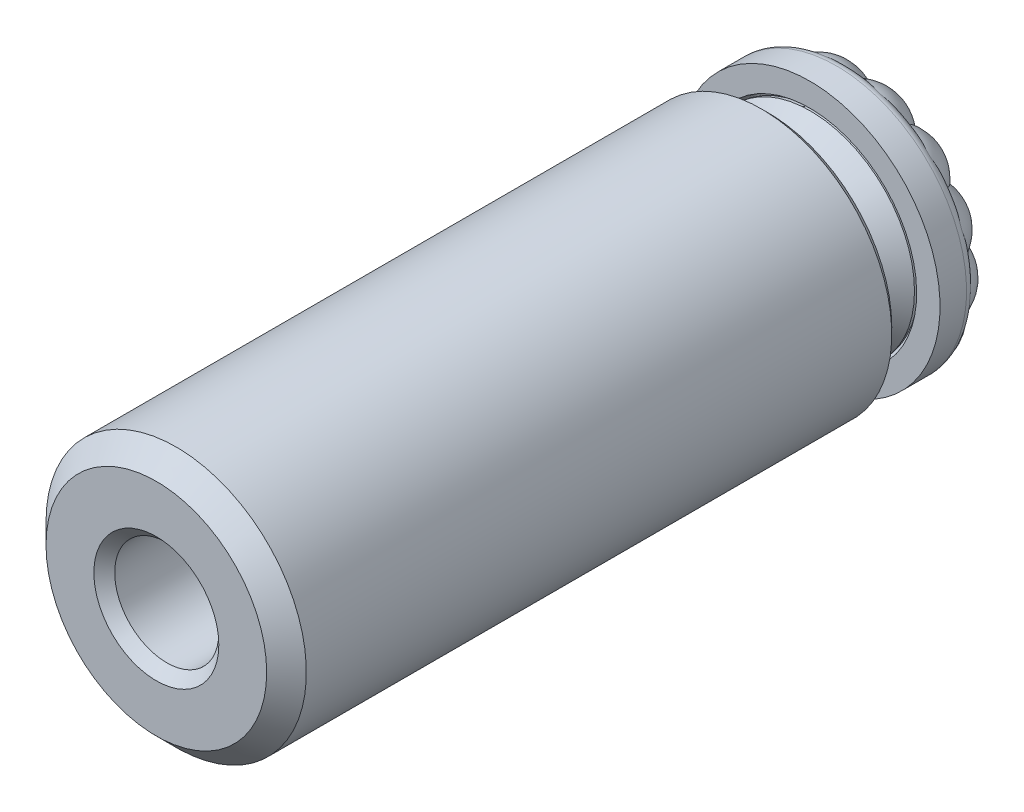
ISO-10303-21;
HEADER;
FILE_DESCRIPTION(('STEP AP214'),'2;1');
FILE_NAME('part.step','',(''),(''),'','','');
FILE_SCHEMA(('AUTOMOTIVE_DESIGN { 1 0 10303 214 1 1 1 1 }'));
ENDSEC;
DATA;
#1=APPLICATION_CONTEXT('core data for automotive mechanical design processes');
#2=APPLICATION_PROTOCOL_DEFINITION('international standard','automotive_design',2000,#1);
#3=PRODUCT_CONTEXT('',#1,'mechanical');
#4=PRODUCT('Part','Part','',(#3));
#5=PRODUCT_RELATED_PRODUCT_CATEGORY('part','',(#4));
#6=PRODUCT_DEFINITION_FORMATION('','',#4);
#7=PRODUCT_DEFINITION_CONTEXT('part definition',#1,'design');
#8=PRODUCT_DEFINITION('design','',#6,#7);
#9=PRODUCT_DEFINITION_SHAPE('','',#8);
#10=(LENGTH_UNIT() NAMED_UNIT(*) SI_UNIT(.MILLI.,.METRE.));
#11=(NAMED_UNIT(*) PLANE_ANGLE_UNIT() SI_UNIT($,.RADIAN.));
#12=(NAMED_UNIT(*) SI_UNIT($,.STERADIAN.) SOLID_ANGLE_UNIT());
#13=UNCERTAINTY_MEASURE_WITH_UNIT(LENGTH_MEASURE(1.E-05),#10,'distance_accuracy_value','');
#14=(GEOMETRIC_REPRESENTATION_CONTEXT(3) GLOBAL_UNCERTAINTY_ASSIGNED_CONTEXT((#13)) GLOBAL_UNIT_ASSIGNED_CONTEXT((#10,
#11,#12)) REPRESENTATION_CONTEXT('',''));
#15=CARTESIAN_POINT('',(0.,0.,0.));
#16=DIRECTION('',(0.,0.,1.));
#17=DIRECTION('',(1.,0.,0.));
#18=AXIS2_PLACEMENT_3D('',#15,#16,#17);
#19=CARTESIAN_POINT('',(0.,0.,4.635));
#20=DIRECTION('',(0.,0.,1.));
#21=DIRECTION('',(1.,0.,0.));
#22=AXIS2_PLACEMENT_3D('',#19,#20,#21);
#23=PLANE('',#22);
#24=CARTESIAN_POINT('',(0.,0.,4.635));
#25=DIRECTION('',(0.,0.,1.));
#26=DIRECTION('',(1.,0.,0.));
#27=AXIS2_PLACEMENT_3D('',#24,#25,#26);
#28=CIRCLE('',#27,3.5687);
#29=CARTESIAN_POINT('',(3.5687,0.,4.635));
#30=VERTEX_POINT('',#29);
#31=EDGE_CURVE('E1379',#30,#30,#28,.F.);
#32=ORIENTED_EDGE('',*,*,#31,.T.);
#33=EDGE_LOOP('',(#32));
#34=FACE_BOUND('',#33,.T.);
#35=CARTESIAN_POINT('',(0.,0.,4.635));
#36=DIRECTION('',(0.,0.,1.));
#37=DIRECTION('',(1.,0.,0.));
#38=AXIS2_PLACEMENT_3D('',#35,#36,#37);
#39=CIRCLE('',#38,3.2222586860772);
#40=CARTESIAN_POINT('',(0.957148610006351,3.07681939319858,4.635));
#41=VERTEX_POINT('',#40);
#42=EDGE_CURVE('E9',#41,#41,#39,.F.);
#43=ORIENTED_EDGE('',*,*,#42,.F.);
#44=EDGE_LOOP('',(#43));
#45=FACE_BOUND('',#44,.T.);
#46=ADVANCED_FACE('F14',(#34,#45),#23,.F.);
#47=CARTESIAN_POINT('',(0.,0.,27.5));
#48=DIRECTION('',(0.,0.,-1.));
#49=DIRECTION('',(-1.,0.,0.));
#50=AXIS2_PLACEMENT_3D('',#47,#48,#49);
#51=CYLINDRICAL_SURFACE('',#50,5.);
#52=CARTESIAN_POINT('',(0.,0.,26.738));
#53=DIRECTION('',(0.,0.,-1.));
#54=DIRECTION('',(-1.,0.,0.));
#55=AXIS2_PLACEMENT_3D('',#52,#53,#54);
#56=CIRCLE('',#55,5.);
#57=CARTESIAN_POINT('',(-5.,0.,26.738));
#58=VERTEX_POINT('',#57);
#59=EDGE_CURVE('E1384',#58,#58,#56,.T.);
#60=ORIENTED_EDGE('',*,*,#59,.T.);
#61=EDGE_LOOP('',(#60));
#62=FACE_BOUND('',#61,.T.);
#63=CARTESIAN_POINT('',(0.,0.,4.254));
#64=DIRECTION('',(0.,0.,-1.));
#65=DIRECTION('',(-1.,0.,0.));
#66=AXIS2_PLACEMENT_3D('',#63,#64,#65);
#67=CIRCLE('',#66,5.);
#68=CARTESIAN_POINT('',(-5.,0.,4.254));
#69=VERTEX_POINT('',#68);
#70=EDGE_CURVE('E1368',#69,#69,#67,.F.);
#71=ORIENTED_EDGE('',*,*,#70,.T.);
#72=EDGE_LOOP('',(#71));
#73=FACE_BOUND('',#72,.T.);
#74=ADVANCED_FACE('F1340',(#62,#73),#51,.T.);
#75=CARTESIAN_POINT('',(0.,0.,27.5));
#76=DIRECTION('',(0.,0.,-1.));
#77=DIRECTION('',(-1.,0.,0.));
#78=AXIS2_PLACEMENT_3D('',#75,#76,#77);
#79=PLANE('',#78);
#80=CARTESIAN_POINT('',(0.,0.,27.5));
#81=DIRECTION('',(0.,0.,-1.));
#82=DIRECTION('',(-1.,0.,0.));
#83=AXIS2_PLACEMENT_3D('',#80,#81,#82);
#84=CIRCLE('',#83,4.238);
#85=CARTESIAN_POINT('',(-4.238,0.,27.5));
#86=VERTEX_POINT('',#85);
#87=EDGE_CURVE('E23',#86,#86,#84,.F.);
#88=ORIENTED_EDGE('',*,*,#87,.T.);
#89=EDGE_LOOP('',(#88));
#90=FACE_BOUND('',#89,.T.);
#91=CARTESIAN_POINT('',(0.,0.,27.5));
#92=DIRECTION('',(0.,0.,1.));
#93=DIRECTION('',(1.,0.,0.));
#94=AXIS2_PLACEMENT_3D('',#91,#92,#93);
#95=CIRCLE('',#94,2.4);
#96=CARTESIAN_POINT('',(2.4,0.,27.5));
#97=VERTEX_POINT('',#96);
#98=EDGE_CURVE('E1395',#97,#97,#95,.T.);
#99=ORIENTED_EDGE('',*,*,#98,.F.);
#100=EDGE_LOOP('',(#99));
#101=FACE_BOUND('',#100,.T.);
#102=ADVANCED_FACE('F1348',(#90,#101),#79,.F.);
#103=CARTESIAN_POINT('',(0.,0.,4.));
#104=DIRECTION('',(0.,0.,-1.));
#105=DIRECTION('',(-1.,0.,0.));
#106=AXIS2_PLACEMENT_3D('',#103,#104,#105);
#107=PLANE('',#106);
#108=CARTESIAN_POINT('',(0.,0.,4.));
#109=DIRECTION('',(0.,0.,-1.));
#110=DIRECTION('',(-1.,0.,0.));
#111=AXIS2_PLACEMENT_3D('',#108,#109,#110);
#112=CIRCLE('',#111,3.8227);
#113=CARTESIAN_POINT('',(-3.8227,0.,4.));
#114=VERTEX_POINT('',#113);
#115=EDGE_CURVE('E1373',#114,#114,#112,.F.);
#116=ORIENTED_EDGE('',*,*,#115,.T.);
#117=EDGE_LOOP('',(#116));
#118=FACE_BOUND('',#117,.T.);
#119=CARTESIAN_POINT('',(0.,0.,4.));
#120=DIRECTION('',(0.,0.,-1.));
#121=DIRECTION('',(-1.,0.,0.));
#122=AXIS2_PLACEMENT_3D('',#119,#120,#121);
#123=CIRCLE('',#122,4.746);
#124=CARTESIAN_POINT('',(-4.746,0.,4.));
#125=VERTEX_POINT('',#124);
#126=EDGE_CURVE('E1371',#125,#125,#123,.T.);
#127=ORIENTED_EDGE('',*,*,#126,.T.);
#128=EDGE_LOOP('',(#127));
#129=FACE_BOUND('',#128,.T.);
#130=ADVANCED_FACE('F1346',(#118,#129),#107,.T.);
#131=CARTESIAN_POINT('',(0.,0.,7.302));
#132=DIRECTION('',(0.,0.,-1.));
#133=DIRECTION('',(-1.,0.,0.));
#134=AXIS2_PLACEMENT_3D('',#131,#132,#133);
#135=CYLINDRICAL_SURFACE('',#134,3.5687);
#136=CARTESIAN_POINT('',(0.,0.,4.254));
#137=DIRECTION('',(0.,0.,-1.));
#138=DIRECTION('',(-1.,0.,0.));
#139=AXIS2_PLACEMENT_3D('',#136,#137,#138);
#140=CIRCLE('',#139,3.5687);
#141=CARTESIAN_POINT('',(-3.5687,0.,4.254));
#142=VERTEX_POINT('',#141);
#143=EDGE_CURVE('E1374',#142,#142,#140,.T.);
#144=ORIENTED_EDGE('',*,*,#143,.T.);
#145=EDGE_LOOP('',(#144));
#146=FACE_BOUND('',#145,.T.);
#147=ORIENTED_EDGE('',*,*,#31,.F.);
#148=EDGE_LOOP('',(#147));
#149=FACE_BOUND('',#148,.T.);
#150=ADVANCED_FACE('F1342',(#146,#149),#135,.F.);
#151=CARTESIAN_POINT('',(0.,0.,4.254));
#152=DIRECTION('',(0.,0.,-1.));
#153=DIRECTION('',(-1.,0.,0.));
#154=AXIS2_PLACEMENT_3D('',#151,#152,#153);
#155=CONICAL_SURFACE('',#154,3.5687,0.785398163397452);
#156=ORIENTED_EDGE('',*,*,#115,.F.);
#157=EDGE_LOOP('',(#156));
#158=FACE_BOUND('',#157,.T.);
#159=ORIENTED_EDGE('',*,*,#143,.F.);
#160=EDGE_LOOP('',(#159));
#161=FACE_BOUND('',#160,.T.);
#162=ADVANCED_FACE('F1345',(#158,#161),#155,.F.);
#163=CARTESIAN_POINT('',(0.,0.,4.));
#164=DIRECTION('',(0.,0.,1.));
#165=DIRECTION('',(1.,0.,0.));
#166=AXIS2_PLACEMENT_3D('',#163,#164,#165);
#167=CONICAL_SURFACE('',#166,4.746,0.785398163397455);
#168=ORIENTED_EDGE('',*,*,#70,.F.);
#169=EDGE_LOOP('',(#168));
#170=FACE_BOUND('',#169,.T.);
#171=ORIENTED_EDGE('',*,*,#126,.F.);
#172=EDGE_LOOP('',(#171));
#173=FACE_BOUND('',#172,.T.);
#174=ADVANCED_FACE('F906',(#170,#173),#167,.T.);
#175=CARTESIAN_POINT('',(0.,0.,26.738));
#176=DIRECTION('',(0.,0.,-1.));
#177=DIRECTION('',(-1.,0.,0.));
#178=AXIS2_PLACEMENT_3D('',#175,#176,#177);
#179=CONICAL_SURFACE('',#178,5.,0.785398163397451);
#180=ORIENTED_EDGE('',*,*,#87,.F.);
#181=EDGE_LOOP('',(#180));
#182=FACE_BOUND('',#181,.T.);
#183=ORIENTED_EDGE('',*,*,#59,.F.);
#184=EDGE_LOOP('',(#183));
#185=FACE_BOUND('',#184,.T.);
#186=ADVANCED_FACE('F897',(#182,#185),#179,.T.);
#187=CARTESIAN_POINT('',(1.37204050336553,4.41051764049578,1.0000000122));
#188=DIRECTION('',(0.,0.,1.));
#189=DIRECTION('',(0.954864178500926,-0.297042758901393,0.));
#190=AXIS2_PLACEMENT_3D('',#187,#188,#189);
#191=PLANE('',#190);
#192=CARTESIAN_POINT('',(3.40233747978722,-0.263165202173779,1.0000000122));
#193=DIRECTION('',(0.,0.,1.));
#194=DIRECTION('',(-0.0771180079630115,-0.997021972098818,0.));
#195=AXIS2_PLACEMENT_3D('',#192,#193,#194);
#196=CIRCLE('',#195,1.47478812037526);
#197=CARTESIAN_POINT('',(1.93754552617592,-0.0917460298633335,1.0000000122));
#198=VERTEX_POINT('',#197);
#199=CARTESIAN_POINT('',(2.04036164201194,0.302539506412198,1.0000000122));
#200=VERTEX_POINT('',#199);
#201=EDGE_CURVE('E698',#198,#200,#196,.F.);
#202=ORIENTED_EDGE('',*,*,#201,.F.);
#203=CARTESIAN_POINT('',(0.,0.,1.0000000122));
#204=DIRECTION('',(0.,0.,1.));
#205=DIRECTION('',(0.954864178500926,-0.297042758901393,0.));
#206=AXIS2_PLACEMENT_3D('',#203,#204,#205);
#207=CIRCLE('',#206,1.93971647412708);
#208=CARTESIAN_POINT('',(1.82755754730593,0.65002570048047,1.0000000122));
#209=VERTEX_POINT('',#208);
#210=EDGE_CURVE('E1483',#198,#209,#207,.T.);
#211=ORIENTED_EDGE('',*,*,#210,.T.);
#212=CARTESIAN_POINT('',(3.17958324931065,1.23911525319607,1.0000000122));
#213=DIRECTION('',(0.,0.,1.));
#214=DIRECTION('',(0.363110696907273,-0.931746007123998,0.));
#215=AXIS2_PLACEMENT_3D('',#212,#213,#214);
#216=CIRCLE('',#215,1.47478812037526);
#217=EDGE_CURVE('E709',#200,#209,#216,.F.);
#218=ORIENTED_EDGE('',*,*,#217,.F.);
#219=EDGE_LOOP('',(#202,#211,#218));
#220=FACE_BOUND('',#219,.T.);
#221=ADVANCED_FACE('F871',(#220),#191,.F.);
#222=CARTESIAN_POINT('',(2.95121704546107,-1.71332256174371,1.0000000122));
#223=DIRECTION('',(0.,0.,1.));
#224=DIRECTION('',(-0.502072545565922,-0.86482550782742,0.));
#225=AXIS2_PLACEMENT_3D('',#222,#223,#224);
#226=CIRCLE('',#225,1.47478812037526);
#227=CARTESIAN_POINT('',(1.70586108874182,-0.923329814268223,1.0000000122));
#228=VERTEX_POINT('',#227);
#229=CARTESIAN_POINT('',(1.96956929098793,-0.61270106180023,1.0000000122));
#230=VERTEX_POINT('',#229);
#231=EDGE_CURVE('E657',#228,#230,#226,.F.);
#232=ORIENTED_EDGE('',*,*,#231,.F.);
#233=CARTESIAN_POINT('',(1.92860803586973,-0.207294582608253,1.0000000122));
#234=VERTEX_POINT('',#233);
#235=EDGE_CURVE('E1479',#228,#234,#207,.T.);
#236=ORIENTED_EDGE('',*,*,#235,.T.);
#237=EDGE_CURVE('E668',#230,#234,#196,.F.);
#238=ORIENTED_EDGE('',*,*,#237,.F.);
#239=EDGE_LOOP('',(#232,#236,#238));
#240=FACE_BOUND('',#239,.T.);
#241=ADVANCED_FACE('F896',(#240),#191,.F.);
#242=CARTESIAN_POINT('',(1.91557188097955,-2.82413537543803,1.0000000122));
#243=DIRECTION('',(0.,0.,1.));
#244=DIRECTION('',(-0.827585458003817,-0.561339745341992,0.));
#245=AXIS2_PLACEMENT_3D('',#242,#243,#244);
#246=CIRCLE('',#245,1.47478812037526);
#247=CARTESIAN_POINT('',(1.13630994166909,-1.57203680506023,1.0000000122));
#248=VERTEX_POINT('',#247);
#249=CARTESIAN_POINT('',(1.50867958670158,-1.40658867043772,1.0000000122));
#250=VERTEX_POINT('',#249);
#251=EDGE_CURVE('E616',#248,#250,#246,.F.);
#252=ORIENTED_EDGE('',*,*,#251,.F.);
#253=CARTESIAN_POINT('',(1.64767405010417,-1.02355763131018,1.0000000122));
#254=VERTEX_POINT('',#253);
#255=EDGE_CURVE('E1474',#248,#254,#207,.T.);
#256=ORIENTED_EDGE('',*,*,#255,.T.);
#257=EDGE_CURVE('E627',#250,#254,#226,.F.);
#258=ORIENTED_EDGE('',*,*,#257,.F.);
#259=EDGE_LOOP('',(#252,#256,#258));
#260=FACE_BOUND('',#259,.T.);
#261=ADVANCED_FACE('F904',(#260),#191,.F.);
#262=CARTESIAN_POINT('',(0.500524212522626,-3.37559354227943,1.0000000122));
#263=DIRECTION('',(0.,0.,1.));
#264=DIRECTION('',(-0.989184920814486,-0.146673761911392,0.));
#265=AXIS2_PLACEMENT_3D('',#262,#263,#264);
#266=CIRCLE('',#265,1.47478812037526);
#267=CARTESIAN_POINT('',(0.341698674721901,-1.90938262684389,1.0000000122));
#268=VERTEX_POINT('',#267);
#269=CARTESIAN_POINT('',(0.748977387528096,-1.92188414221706,1.0000000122));
#270=VERTEX_POINT('',#269);
#271=EDGE_CURVE('E575',#268,#270,#266,.F.);
#272=ORIENTED_EDGE('',*,*,#271,.F.);
#273=CARTESIAN_POINT('',(1.04039801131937,-1.63709253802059,1.0000000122));
#274=VERTEX_POINT('',#273);
#275=EDGE_CURVE('E1469',#268,#274,#207,.T.);
#276=ORIENTED_EDGE('',*,*,#275,.T.);
#277=EDGE_CURVE('E586',#270,#274,#246,.F.);
#278=ORIENTED_EDGE('',*,*,#277,.F.);
#279=EDGE_LOOP('',(#272,#276,#278));
#280=FACE_BOUND('',#279,.T.);
#281=ADVANCED_FACE('F1550',(#280),#191,.F.);
#282=CARTESIAN_POINT('',(-1.01365841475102,-3.2584740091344,1.0000000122));
#283=DIRECTION('',(0.,0.,1.));
#284=DIRECTION('',(-0.954864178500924,0.2970427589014,0.));
#285=AXIS2_PLACEMENT_3D('',#282,#283,#284);
#286=CIRCLE('',#285,1.47478812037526);
#287=CARTESIAN_POINT('',(-0.52059020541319,-1.86855180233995,1.0000000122));
#288=VERTEX_POINT('',#287);
#289=CARTESIAN_POINT('',(-0.159068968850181,-2.05652688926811,1.0000000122));
#290=VERTEX_POINT('',#289);
#291=EDGE_CURVE('E534',#288,#290,#286,.F.);
#292=ORIENTED_EDGE('',*,*,#291,.F.);
#293=CARTESIAN_POINT('',(0.227058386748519,-1.92638118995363,1.0000000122));
#294=VERTEX_POINT('',#293);
#295=EDGE_CURVE('E1464',#288,#294,#207,.T.);
#296=ORIENTED_EDGE('',*,*,#295,.T.);
#297=EDGE_CURVE('E545',#290,#294,#266,.F.);
#298=ORIENTED_EDGE('',*,*,#297,.F.);
#299=EDGE_LOOP('',(#292,#296,#298));
#300=FACE_BOUND('',#299,.T.);
#301=ADVANCED_FACE('F1588',(#300),#191,.F.);
#302=CARTESIAN_POINT('',(-2.32707356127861,-2.49597373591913,1.0000000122));
#303=DIRECTION('',(0.,0.,1.));
#304=DIRECTION('',(-0.731420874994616,0.681926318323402,0.));
#305=AXIS2_PLACEMENT_3D('',#302,#303,#304);
#306=CIRCLE('',#305,1.47478812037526);
#307=CARTESIAN_POINT('',(-1.27976981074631,-1.45763137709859,1.0000000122));
#308=VERTEX_POINT('',#307);
#309=CARTESIAN_POINT('',(-1.0356097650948,-1.78384926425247,1.0000000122));
#310=VERTEX_POINT('',#309);
#311=EDGE_CURVE('E493',#308,#310,#306,.F.);
#312=ORIENTED_EDGE('',*,*,#311,.F.);
#313=CARTESIAN_POINT('',(-0.63125293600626,-1.83412642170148,1.0000000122));
#314=VERTEX_POINT('',#313);
#315=EDGE_CURVE('E1459',#308,#314,#207,.T.);
#316=ORIENTED_EDGE('',*,*,#315,.T.);
#317=EDGE_CURVE('E504',#310,#314,#286,.F.);
#318=ORIENTED_EDGE('',*,*,#317,.F.);
#319=EDGE_LOOP('',(#312,#316,#318));
#320=FACE_BOUND('',#319,.T.);
#321=ADVANCED_FACE('F1521',(#320),#191,.F.);
#322=CARTESIAN_POINT('',(-3.17958324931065,-1.23911525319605,1.0000000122));
#323=DIRECTION('',(0.,0.,1.));
#324=DIRECTION('',(-0.363110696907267,0.931746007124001,0.));
#325=AXIS2_PLACEMENT_3D('',#322,#323,#324);
#326=CIRCLE('',#325,1.47478812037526);
#327=CARTESIAN_POINT('',(-1.78547530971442,-0.758009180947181,1.0000000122));
#328=VERTEX_POINT('',#327);
#329=CARTESIAN_POINT('',(-1.70703534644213,-1.15785841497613,1.0000000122));
#330=VERTEX_POINT('',#329);
#331=EDGE_CURVE('E452',#328,#330,#326,.F.);
#332=ORIENTED_EDGE('',*,*,#331,.F.);
#333=CARTESIAN_POINT('',(-1.36453687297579,-1.37860042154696,1.0000000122));
#334=VERTEX_POINT('',#333);
#335=EDGE_CURVE('E1454',#328,#334,#207,.T.);
#336=ORIENTED_EDGE('',*,*,#335,.T.);
#337=EDGE_CURVE('E463',#330,#334,#306,.F.);
#338=ORIENTED_EDGE('',*,*,#337,.F.);
#339=EDGE_LOOP('',(#332,#336,#338));
#340=FACE_BOUND('',#339,.T.);
#341=ADVANCED_FACE('F1516',(#340),#191,.F.);
#342=CARTESIAN_POINT('',(-3.40233747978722,0.263165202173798,1.0000000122));
#343=DIRECTION('',(0.,0.,1.));
#344=DIRECTION('',(0.0771180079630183,0.997021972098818,0.));
#345=AXIS2_PLACEMENT_3D('',#342,#343,#344);
#346=CIRCLE('',#345,1.47478812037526);
#347=CARTESIAN_POINT('',(-1.93754552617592,0.0917460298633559,1.0000000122));
#348=VERTEX_POINT('',#347);
#349=CARTESIAN_POINT('',(-2.04036164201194,-0.302539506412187,1.0000000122));
#350=VERTEX_POINT('',#349);
#351=EDGE_CURVE('E411',#348,#350,#346,.F.);
#352=ORIENTED_EDGE('',*,*,#351,.F.);
#353=CARTESIAN_POINT('',(-1.82755754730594,-0.650025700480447,1.0000000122));
#354=VERTEX_POINT('',#353);
#355=EDGE_CURVE('E1449',#348,#354,#207,.T.);
#356=ORIENTED_EDGE('',*,*,#355,.T.);
#357=EDGE_CURVE('E422',#350,#354,#326,.F.);
#358=ORIENTED_EDGE('',*,*,#357,.F.);
#359=EDGE_LOOP('',(#352,#356,#358));
#360=FACE_BOUND('',#359,.T.);
#361=ADVANCED_FACE('F1512',(#360),#191,.F.);
#362=CARTESIAN_POINT('',(-2.95121704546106,1.71332256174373,1.0000000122));
#363=DIRECTION('',(0.,0.,1.));
#364=DIRECTION('',(0.502072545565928,0.864825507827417,0.));
#365=AXIS2_PLACEMENT_3D('',#362,#363,#364);
#366=CIRCLE('',#365,1.47478812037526);
#367=CARTESIAN_POINT('',(-1.70586108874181,0.923329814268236,1.0000000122));
#368=VERTEX_POINT('',#367);
#369=CARTESIAN_POINT('',(-1.96956929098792,0.612701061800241,1.0000000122));
#370=VERTEX_POINT('',#369);
#371=EDGE_CURVE('E368',#368,#370,#366,.F.);
#372=ORIENTED_EDGE('',*,*,#371,.F.);
#373=CARTESIAN_POINT('',(-1.92860803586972,0.207294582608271,1.0000000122));
#374=VERTEX_POINT('',#373);
#375=EDGE_CURVE('E1445',#368,#374,#207,.T.);
#376=ORIENTED_EDGE('',*,*,#375,.T.);
#377=EDGE_CURVE('E379',#370,#374,#346,.F.);
#378=ORIENTED_EDGE('',*,*,#377,.F.);
#379=EDGE_LOOP('',(#372,#376,#378));
#380=FACE_BOUND('',#379,.T.);
#381=ADVANCED_FACE('F1505',(#380),#191,.F.);
#382=CARTESIAN_POINT('',(-1.91557188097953,2.82413537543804,1.0000000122));
#383=DIRECTION('',(0.,0.,1.));
#384=DIRECTION('',(0.827585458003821,0.561339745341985,0.));
#385=AXIS2_PLACEMENT_3D('',#382,#383,#384);
#386=CIRCLE('',#385,1.47478812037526);
#387=CARTESIAN_POINT('',(-1.13630994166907,1.57203680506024,1.0000000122));
#388=VERTEX_POINT('',#387);
#389=CARTESIAN_POINT('',(-1.50867958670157,1.40658867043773,1.0000000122));
#390=VERTEX_POINT('',#389);
#391=EDGE_CURVE('E310',#388,#390,#386,.F.);
#392=ORIENTED_EDGE('',*,*,#391,.F.);
#393=CARTESIAN_POINT('',(-1.64767405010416,1.02355763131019,1.0000000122));
#394=VERTEX_POINT('',#393);
#395=EDGE_CURVE('E31',#388,#394,#207,.T.);
#396=ORIENTED_EDGE('',*,*,#395,.T.);
#397=EDGE_CURVE('E360',#390,#394,#366,.F.);
#398=ORIENTED_EDGE('',*,*,#397,.F.);
#399=EDGE_LOOP('',(#392,#396,#398));
#400=FACE_BOUND('',#399,.T.);
#401=ADVANCED_FACE('F1506',(#400),#191,.F.);
#402=CARTESIAN_POINT('',(-0.500524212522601,3.37559354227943,1.0000000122));
#403=DIRECTION('',(0.,0.,1.));
#404=DIRECTION('',(0.989184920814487,0.146673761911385,0.));
#405=AXIS2_PLACEMENT_3D('',#402,#403,#404);
#406=CIRCLE('',#405,1.47478812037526);
#407=CARTESIAN_POINT('',(-0.341698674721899,1.90938262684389,1.0000000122));
#408=VERTEX_POINT('',#407);
#409=CARTESIAN_POINT('',(-0.748977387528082,1.92188414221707,1.0000000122));
#410=VERTEX_POINT('',#409);
#411=EDGE_CURVE('E302',#408,#410,#406,.F.);
#412=ORIENTED_EDGE('',*,*,#411,.F.);
#413=CARTESIAN_POINT('',(-1.04039801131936,1.63709253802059,1.0000000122));
#414=VERTEX_POINT('',#413);
#415=EDGE_CURVE('E287',#408,#414,#207,.T.);
#416=ORIENTED_EDGE('',*,*,#415,.T.);
#417=EDGE_CURVE('E300',#410,#414,#386,.F.);
#418=ORIENTED_EDGE('',*,*,#417,.F.);
#419=EDGE_LOOP('',(#412,#416,#418));
#420=FACE_BOUND('',#419,.T.);
#421=ADVANCED_FACE('F299',(#420),#191,.F.);
#422=CARTESIAN_POINT('',(1.013658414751,3.25847400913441,1.0000000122));
#423=DIRECTION('',(0.,0.,1.));
#424=DIRECTION('',(0.954864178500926,-0.297042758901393,0.));
#425=AXIS2_PLACEMENT_3D('',#422,#423,#424);
#426=CIRCLE('',#425,1.47478812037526);
#427=CARTESIAN_POINT('',(0.52059020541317,1.86855180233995,1.0000000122));
#428=VERTEX_POINT('',#427);
#429=CARTESIAN_POINT('',(0.159068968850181,2.0565268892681,1.0000000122));
#430=VERTEX_POINT('',#429);
#431=EDGE_CURVE('E938',#428,#430,#426,.F.);
#432=ORIENTED_EDGE('',*,*,#431,.F.);
#433=CARTESIAN_POINT('',(-0.227058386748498,1.92638118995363,1.0000000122));
#434=VERTEX_POINT('',#433);
#435=EDGE_CURVE('E1434',#428,#434,#207,.T.);
#436=ORIENTED_EDGE('',*,*,#435,.T.);
#437=EDGE_CURVE('E748',#430,#434,#406,.F.);
#438=ORIENTED_EDGE('',*,*,#437,.F.);
#439=EDGE_LOOP('',(#432,#436,#438));
#440=FACE_BOUND('',#439,.T.);
#441=ADVANCED_FACE('F917',(#440),#191,.F.);
#442=CARTESIAN_POINT('',(2.3270735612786,2.49597373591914,1.0000000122));
#443=DIRECTION('',(0.,0.,1.));
#444=DIRECTION('',(0.731420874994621,-0.681926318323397,0.));
#445=AXIS2_PLACEMENT_3D('',#442,#443,#444);
#446=CIRCLE('',#445,1.47478812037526);
#447=CARTESIAN_POINT('',(1.2797698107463,1.45763137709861,1.0000000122));
#448=VERTEX_POINT('',#447);
#449=CARTESIAN_POINT('',(1.03560976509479,1.78384926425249,1.0000000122));
#450=VERTEX_POINT('',#449);
#451=EDGE_CURVE('E822',#448,#450,#446,.F.);
#452=ORIENTED_EDGE('',*,*,#451,.F.);
#453=CARTESIAN_POINT('',(0.63125293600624,1.83412642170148,1.0000000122));
#454=VERTEX_POINT('',#453);
#455=EDGE_CURVE('E925',#448,#454,#207,.T.);
#456=ORIENTED_EDGE('',*,*,#455,.T.);
#457=EDGE_CURVE('E833',#450,#454,#426,.F.);
#458=ORIENTED_EDGE('',*,*,#457,.F.);
#459=EDGE_LOOP('',(#452,#456,#458));
#460=FACE_BOUND('',#459,.T.);
#461=ADVANCED_FACE('F911',(#460),#191,.F.);
#462=CARTESIAN_POINT('',(0.,0.,2.3812500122));
#463=DIRECTION('',(0.,0.,1.));
#464=DIRECTION('',(0.297042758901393,0.954864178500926,0.));
#465=AXIS2_PLACEMENT_3D('',#462,#463,#464);
#466=SPHERICAL_SURFACE('',#465,2.38125);
#467=CARTESIAN_POINT('',(1.04039801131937,-1.63709253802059,1.0000000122));
#468=CARTESIAN_POINT('',(1.04435425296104,-1.63432419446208,0.99969999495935));
#469=CARTESIAN_POINT('',(1.04831748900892,-1.63156179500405,0.999437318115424));
#470=CARTESIAN_POINT('',(1.05625285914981,-1.62605232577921,0.998987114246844));
#471=CARTESIAN_POINT('',(1.06022498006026,-1.62330524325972,0.998799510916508));
#472=CARTESIAN_POINT('',(1.06817838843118,-1.6178260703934,0.998499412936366));
#473=CARTESIAN_POINT('',(1.07215966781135,-1.61509397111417,0.998386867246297));
#474=CARTESIAN_POINT('',(1.08013169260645,-1.60964447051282,0.998236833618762));
#475=CARTESIAN_POINT('',(1.08412243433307,-1.6069270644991,0.998199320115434));
#476=CARTESIAN_POINT('',(1.09211371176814,-1.6015066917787,0.998199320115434));
#477=CARTESIAN_POINT('',(1.0961142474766,-1.59880372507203,0.998236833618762));
#478=CARTESIAN_POINT('',(1.10412546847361,-1.59341201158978,0.998386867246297));
#479=CARTESIAN_POINT('',(1.1081361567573,-1.590723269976,0.998499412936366));
#480=CARTESIAN_POINT('',(1.11616806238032,-1.5853598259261,0.998799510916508));
#481=CARTESIAN_POINT('',(1.12018928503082,-1.58268513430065,0.998987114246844));
#482=CARTESIAN_POINT('',(1.12824266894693,-1.57734965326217,0.999437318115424));
#483=CARTESIAN_POINT('',(1.1322748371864,-1.57468888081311,0.99969999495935));
#484=CARTESIAN_POINT('',(1.13630994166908,-1.57203680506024,1.0000000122));
#485=B_SPLINE_CURVE_WITH_KNOTS('',3,(#467,#468,#469,#470,#471,#472,#473,#474,#475,#476,#477,
#478,#479,#480,#481,#482,#483,#484),.UNSPECIFIED.,.F.,.F.,(4,2,2,2,2,2,2,2,4),(0.,
0.0145136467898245,0.029012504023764,0.0435014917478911,0.0579855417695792,0.0724695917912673,
0.0869585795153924,0.101457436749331,0.115971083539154),.UNSPECIFIED.);
#486=EDGE_CURVE('E581',#274,#248,#485,.T.);
#487=ORIENTED_EDGE('',*,*,#486,.F.);
#488=ORIENTED_EDGE('',*,*,#275,.F.);
#489=CARTESIAN_POINT('',(0.227058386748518,-1.92638118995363,1.0000000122));
#490=CARTESIAN_POINT('',(0.231823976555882,-1.9256035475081,0.999699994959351));
#491=CARTESIAN_POINT('',(0.236593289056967,-1.92483429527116,0.999437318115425));
#492=CARTESIAN_POINT('',(0.246133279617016,-1.92331346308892,0.998987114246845));
#493=CARTESIAN_POINT('',(0.250903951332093,-1.92256186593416,0.998799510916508));
#494=CARTESIAN_POINT('',(0.260447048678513,-1.92107615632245,0.998499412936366));
#495=CARTESIAN_POINT('',(0.265219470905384,-1.92034203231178,0.998386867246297));
#496=CARTESIAN_POINT('',(0.274766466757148,-1.91889113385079,0.998236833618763));
#497=CARTESIAN_POINT('',(0.279541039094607,-1.91817435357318,0.998199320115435));
#498=CARTESIAN_POINT('',(0.289092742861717,-1.91675805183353,0.998199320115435));
#499=CARTESIAN_POINT('',(0.293869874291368,-1.91605853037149,0.998236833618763));
#500=CARTESIAN_POINT('',(0.303427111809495,-1.91467670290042,0.998386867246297));
#501=CARTESIAN_POINT('',(0.308207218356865,-1.91399440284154,0.998499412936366));
#502=CARTESIAN_POINT('',(0.317770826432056,-1.91264701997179,0.998799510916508));
#503=CARTESIAN_POINT('',(0.322554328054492,-1.91198194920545,0.998987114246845));
#504=CARTESIAN_POINT('',(0.332125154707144,-1.91066907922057,0.999437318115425));
#505=CARTESIAN_POINT('',(0.336912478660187,-1.91002129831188,0.999699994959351));
#506=CARTESIAN_POINT('',(0.341698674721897,-1.9093826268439,1.0000000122));
#507=B_SPLINE_CURVE_WITH_KNOTS('',3,(#489,#490,#491,#492,#493,#494,#495,#496,#497,#498,#499,
#500,#501,#502,#503,#504,#505,#506),.UNSPECIFIED.,.F.,.F.,(4,2,2,2,2,2,2,2,4),(0.,
0.0145136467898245,0.029012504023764,0.0435014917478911,0.0579855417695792,0.0724695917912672,
0.0869585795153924,0.101457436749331,0.115971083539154),.UNSPECIFIED.);
#508=EDGE_CURVE('E540',#294,#268,#507,.T.);
#509=ORIENTED_EDGE('',*,*,#508,.F.);
#510=ORIENTED_EDGE('',*,*,#295,.F.);
#511=CARTESIAN_POINT('',(-0.63125293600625,-1.83412642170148,1.0000000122));
#512=CARTESIAN_POINT('',(-0.626621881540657,-1.83549350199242,0.999699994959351));
#513=CARTESIAN_POINT('',(-0.621991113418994,-1.83686975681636,0.999437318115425));
#514=CARTESIAN_POINT('',(-0.612736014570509,-1.83963878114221,0.998987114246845));
#515=CARTESIAN_POINT('',(-0.608111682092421,-1.8410315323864,0.998799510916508));
#516=CARTESIAN_POINT('',(-0.598869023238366,-1.84383354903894,0.998499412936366));
#517=CARTESIAN_POINT('',(-0.594250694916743,-1.84524280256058,0.998386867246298));
#518=CARTESIAN_POINT('',(-0.585019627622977,-1.84807787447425,0.998236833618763));
#519=CARTESIAN_POINT('',(-0.580406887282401,-1.84950368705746,0.998199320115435));
#520=CARTESIAN_POINT('',(-0.57118658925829,-1.85237197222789,0.998199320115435));
#521=CARTESIAN_POINT('',(-0.566579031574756,-1.85381444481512,0.998236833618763));
#522=CARTESIAN_POINT('',(-0.557368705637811,-1.85671619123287,0.998386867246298));
#523=CARTESIAN_POINT('',(-0.552765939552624,-1.8581754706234,0.998499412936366));
#524=CARTESIAN_POINT('',(-0.543564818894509,-1.86111101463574,0.998799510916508));
#525=CARTESIAN_POINT('',(-0.538966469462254,-1.86258729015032,0.998987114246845));
#526=CARTESIAN_POINT('',(-0.529773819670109,-1.86555706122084,0.999437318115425));
#527=CARTESIAN_POINT('',(-0.525179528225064,-1.86705057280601,0.999699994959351));
#528=CARTESIAN_POINT('',(-0.520590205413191,-1.86855180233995,1.0000000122));
#529=B_SPLINE_CURVE_WITH_KNOTS('',3,(#511,#512,#513,#514,#515,#516,#517,#518,#519,#520,#521,
#522,#523,#524,#525,#526,#527,#528),.UNSPECIFIED.,.F.,.F.,(4,2,2,2,2,2,2,2,4),(0.,
0.0145136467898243,0.0290125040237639,0.0435014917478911,0.057985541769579,0.0724695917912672,
0.0869585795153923,0.101457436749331,0.115971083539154),.UNSPECIFIED.);
#530=EDGE_CURVE('E499',#314,#288,#529,.T.);
#531=ORIENTED_EDGE('',*,*,#530,.F.);
#532=ORIENTED_EDGE('',*,*,#315,.F.);
#533=CARTESIAN_POINT('',(-1.36453687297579,-1.37860042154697,1.0000000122));
#534=CARTESIAN_POINT('',(-1.36095759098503,-1.38184145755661,0.999699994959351));
#535=CARTESIAN_POINT('',(-1.35738254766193,-1.3850906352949,0.999437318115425));
#536=CARTESIAN_POINT('',(-1.35024542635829,-1.39160107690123,0.998987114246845));
#537=CARTESIAN_POINT('',(-1.34668333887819,-1.3948623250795,0.998799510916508));
#538=CARTESIAN_POINT('',(-1.33957174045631,-1.40139709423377,0.998499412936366));
#539=CARTESIAN_POINT('',(-1.33602222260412,-1.40467060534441,0.998386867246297));
#540=CARTESIAN_POINT('',(-1.32893540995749,-1.41123012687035,0.998236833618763));
#541=CARTESIAN_POINT('',(-1.32539811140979,-1.41451613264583,0.998199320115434));
#542=CARTESIAN_POINT('',(-1.31833541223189,-1.42110090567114,0.998199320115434));
#543=CARTESIAN_POINT('',(-1.31481001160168,-1.42439967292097,0.998236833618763));
#544=CARTESIAN_POINT('',(-1.30777081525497,-1.43101026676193,0.998386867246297));
#545=CARTESIAN_POINT('',(-1.30425702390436,-1.43432209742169,0.998499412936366));
#546=CARTESIAN_POINT('',(-1.29724078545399,-1.44095914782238,0.998799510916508));
#547=CARTESIAN_POINT('',(-1.29373834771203,-1.4442843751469,0.998987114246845));
#548=CARTESIAN_POINT('',(-1.28674459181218,-1.45094858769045,0.999437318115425));
#549=CARTESIAN_POINT('',(-1.28325328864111,-1.45428758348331,0.999699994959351));
#550=CARTESIAN_POINT('',(-1.27976981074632,-1.4576313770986,1.0000000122));
#551=B_SPLINE_CURVE_WITH_KNOTS('',3,(#533,#534,#535,#536,#537,#538,#539,#540,#541,#542,#543,
#544,#545,#546,#547,#548,#549,#550),.UNSPECIFIED.,.F.,.F.,(4,2,2,2,2,2,2,2,4),(0.,
0.0145136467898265,0.0290125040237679,0.0435014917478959,0.0579855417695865,0.0724695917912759,
0.0869585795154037,0.101457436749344,0.115971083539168),.UNSPECIFIED.);
#552=EDGE_CURVE('E458',#334,#308,#551,.T.);
#553=ORIENTED_EDGE('',*,*,#552,.F.);
#554=ORIENTED_EDGE('',*,*,#335,.F.);
#555=CARTESIAN_POINT('',(-1.82755754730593,-0.650025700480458,1.0000000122));
#556=CARTESIAN_POINT('',(-1.8257389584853,-0.654498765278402,0.999699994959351));
#557=CARTESIAN_POINT('',(-1.82392772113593,-0.658977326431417,0.999437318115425));
#558=CARTESIAN_POINT('',(-1.82032217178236,-0.667939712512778,0.998987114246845));
#559=CARTESIAN_POINT('',(-1.81852784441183,-0.672423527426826,0.998799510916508));
#560=CARTESIAN_POINT('',(-1.81495584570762,-0.681396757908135,0.998499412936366));
#561=CARTESIAN_POINT('',(-1.81317816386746,-0.685886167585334,0.998386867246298));
#562=CARTESIAN_POINT('',(-1.80963923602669,-0.694870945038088,0.998236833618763));
#563=CARTESIAN_POINT('',(-1.80787798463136,-0.699366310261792,0.998199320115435));
#564=CARTESIAN_POINT('',(-1.80437173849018,-0.708363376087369,0.998199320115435));
#565=CARTESIAN_POINT('',(-1.80262674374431,-0.712865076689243,0.998236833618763));
#566=CARTESIAN_POINT('',(-1.79915287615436,-0.721875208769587,0.998386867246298));
#567=CARTESIAN_POINT('',(-1.79742400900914,-0.726383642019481,0.998499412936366));
#568=CARTESIAN_POINT('',(-1.79398230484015,-0.735407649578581,0.998799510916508));
#569=CARTESIAN_POINT('',(-1.79226947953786,-0.739923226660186,0.998987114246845));
#570=CARTESIAN_POINT('',(-1.78885981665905,-0.748961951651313,0.999437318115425));
#571=CARTESIAN_POINT('',(-1.78716299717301,-0.753485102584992,0.999699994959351));
#572=CARTESIAN_POINT('',(-1.78547530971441,-0.758009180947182,1.0000000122));
#573=B_SPLINE_CURVE_WITH_KNOTS('',3,(#555,#556,#557,#558,#559,#560,#561,#562,#563,#564,#565,
#566,#567,#568,#569,#570,#571,#572),.UNSPECIFIED.,.F.,.F.,(4,2,2,2,2,2,2,2,4),(0.,
0.0145136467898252,0.0290125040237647,0.0435014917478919,0.0579855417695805,0.07246959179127,
0.0869585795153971,0.101457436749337,0.115971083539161),.UNSPECIFIED.);
#574=EDGE_CURVE('E417',#354,#328,#573,.T.);
#575=ORIENTED_EDGE('',*,*,#574,.F.);
#576=ORIENTED_EDGE('',*,*,#355,.F.);
#577=CARTESIAN_POINT('',(-1.92860803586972,0.207294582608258,1.0000000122));
#578=CARTESIAN_POINT('',(-1.92891033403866,0.202475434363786,0.99969999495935));
#579=CARTESIAN_POINT('',(-1.92922164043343,0.197654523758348,0.999437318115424));
#580=CARTESIAN_POINT('',(-1.92986178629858,0.188015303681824,0.998987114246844));
#581=CARTESIAN_POINT('',(-1.93019060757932,0.183196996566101,0.998799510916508));
#582=CARTESIAN_POINT('',(-1.93086568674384,0.173562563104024,0.998499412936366));
#583=CARTESIAN_POINT('',(-1.93121193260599,0.168746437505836,0.998386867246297));
#584=CARTESIAN_POINT('',(-1.93192181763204,0.159115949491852,0.998236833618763));
#585=CARTESIAN_POINT('',(-1.93228545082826,0.154301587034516,0.998199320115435));
#586=CARTESIAN_POINT('',(-1.93303011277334,0.144674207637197,0.998199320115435));
#587=CARTESIAN_POINT('',(-1.93341114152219,0.139861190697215,0.998236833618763));
#588=CARTESIAN_POINT('',(-1.9341906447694,0.130236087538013,0.998386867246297));
#589=CARTESIAN_POINT('',(-1.93458912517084,0.125424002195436,0.998499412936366));
#590=CARTESIAN_POINT('',(-1.93540362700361,0.115800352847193,0.998799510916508));
#591=CARTESIAN_POINT('',(-1.93581966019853,0.110988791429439,0.998987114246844));
#592=CARTESIAN_POINT('',(-1.93666941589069,0.101365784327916,0.999437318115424));
#593=CARTESIAN_POINT('',(-1.93710315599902,0.0965543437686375,0.99969999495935));
#594=CARTESIAN_POINT('',(-1.93754552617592,0.0917460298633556,1.0000000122));
#595=B_SPLINE_CURVE_WITH_KNOTS('',3,(#577,#578,#579,#580,#581,#582,#583,#584,#585,#586,#587,
#588,#589,#590,#591,#592,#593,#594),.UNSPECIFIED.,.F.,.F.,(4,2,2,2,2,2,2,2,4),(0.,
0.0145136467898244,0.029012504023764,0.0435014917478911,0.0579855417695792,0.0724695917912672,
0.0869585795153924,0.101457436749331,0.115971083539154),.UNSPECIFIED.);
#596=EDGE_CURVE('E374',#374,#348,#595,.T.);
#597=ORIENTED_EDGE('',*,*,#596,.F.);
#598=ORIENTED_EDGE('',*,*,#375,.F.);
#599=CARTESIAN_POINT('',(-1.64767405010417,1.02355763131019,1.0000000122));
#600=CARTESIAN_POINT('',(-1.65003736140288,1.01934689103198,0.999699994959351));
#601=CARTESIAN_POINT('',(-1.65240955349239,1.01513847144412,0.999437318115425));
#602=CARTESIAN_POINT('',(-1.65716860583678,1.00673158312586,0.998987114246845));
#603=CARTESIAN_POINT('',(-1.65955544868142,1.00253310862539,0.998799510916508));
#604=CARTESIAN_POINT('',(-1.66434389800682,0.994145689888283,0.998499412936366));
#605=CARTESIAN_POINT('',(-1.66674549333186,0.989956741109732,0.998386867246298));
#606=CARTESIAN_POINT('',(-1.67156358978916,0.981587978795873,0.998236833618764));
#607=CARTESIAN_POINT('',(-1.67398008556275,0.97740816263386,0.998199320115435));
#608=CARTESIAN_POINT('',(-1.67882816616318,0.969057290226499,0.998199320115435));
#609=CARTESIAN_POINT('',(-1.68125975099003,0.964886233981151,0.998236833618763));
#610=CARTESIAN_POINT('',(-1.6861382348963,0.956552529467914,0.998386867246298));
#611=CARTESIAN_POINT('',(-1.68858513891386,0.952389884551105,0.998499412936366));
#612=CARTESIAN_POINT('',(-1.69349452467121,0.944072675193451,0.998799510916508));
#613=CARTESIAN_POINT('',(-1.69595701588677,0.939918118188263,0.998987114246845));
#614=CARTESIAN_POINT('',(-1.70089788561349,0.931616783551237,0.999437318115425));
#615=CARTESIAN_POINT('',(-1.70337627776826,0.92747001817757,0.99969999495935));
#616=CARTESIAN_POINT('',(-1.70586108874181,0.923329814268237,1.0000000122));
#617=B_SPLINE_CURVE_WITH_KNOTS('',3,(#599,#600,#601,#602,#603,#604,#605,#606,#607,#608,#609,
#610,#611,#612,#613,#614,#615,#616),.UNSPECIFIED.,.F.,.F.,(4,2,2,2,2,2,2,2,4),(0.,
0.014513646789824,0.0290125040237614,0.0435014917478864,0.0579855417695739,0.0724695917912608,
0.0869585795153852,0.101457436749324,0.115971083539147),.UNSPECIFIED.);
#618=EDGE_CURVE('E303',#394,#368,#617,.T.);
#619=ORIENTED_EDGE('',*,*,#618,.F.);
#620=ORIENTED_EDGE('',*,*,#395,.F.);
#621=CARTESIAN_POINT('',(-1.04039801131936,1.6370925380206,1.0000000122));
#622=CARTESIAN_POINT('',(-1.04435425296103,1.63432419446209,0.999699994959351));
#623=CARTESIAN_POINT('',(-1.04831748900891,1.63156179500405,0.999437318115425));
#624=CARTESIAN_POINT('',(-1.0562528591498,1.62605232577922,0.998987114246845));
#625=CARTESIAN_POINT('',(-1.06022498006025,1.62330524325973,0.998799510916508));
#626=CARTESIAN_POINT('',(-1.06817838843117,1.61782607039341,0.998499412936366));
#627=CARTESIAN_POINT('',(-1.07215966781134,1.61509397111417,0.998386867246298));
#628=CARTESIAN_POINT('',(-1.08013169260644,1.60964447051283,0.998236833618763));
#629=CARTESIAN_POINT('',(-1.08412243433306,1.60692706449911,0.998199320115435));
#630=CARTESIAN_POINT('',(-1.09211371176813,1.60150669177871,0.998199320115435));
#631=CARTESIAN_POINT('',(-1.09611424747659,1.59880372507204,0.998236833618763));
#632=CARTESIAN_POINT('',(-1.10412546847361,1.59341201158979,0.998386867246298));
#633=CARTESIAN_POINT('',(-1.10813615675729,1.59072326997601,0.998499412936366));
#634=CARTESIAN_POINT('',(-1.11616806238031,1.58535982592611,0.998799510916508));
#635=CARTESIAN_POINT('',(-1.12018928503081,1.58268513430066,0.998987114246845));
#636=CARTESIAN_POINT('',(-1.12824266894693,1.57734965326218,0.999437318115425));
#637=CARTESIAN_POINT('',(-1.13227483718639,1.57468888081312,0.999699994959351));
#638=CARTESIAN_POINT('',(-1.13630994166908,1.57203680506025,1.0000000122));
#639=B_SPLINE_CURVE_WITH_KNOTS('',3,(#621,#622,#623,#624,#625,#626,#627,#628,#629,#630,#631,
#632,#633,#634,#635,#636,#637,#638),.UNSPECIFIED.,.F.,.F.,(4,2,2,2,2,2,2,2,4),(0.,
0.0145136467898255,0.0290125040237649,0.0435014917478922,0.0579855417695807,0.0724695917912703,
0.0869585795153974,0.101457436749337,0.115971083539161),.UNSPECIFIED.);
#640=EDGE_CURVE('E283',#414,#388,#639,.T.);
#641=ORIENTED_EDGE('',*,*,#640,.F.);
#642=ORIENTED_EDGE('',*,*,#415,.F.);
#643=CARTESIAN_POINT('',(-0.227058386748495,1.92638118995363,1.0000000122));
#644=CARTESIAN_POINT('',(-0.23182397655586,1.9256035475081,0.999699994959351));
#645=CARTESIAN_POINT('',(-0.236593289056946,1.92483429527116,0.999437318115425));
#646=CARTESIAN_POINT('',(-0.246133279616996,1.92331346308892,0.998987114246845));
#647=CARTESIAN_POINT('',(-0.250903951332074,1.92256186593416,0.998799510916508));
#648=CARTESIAN_POINT('',(-0.260447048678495,1.92107615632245,0.998499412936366));
#649=CARTESIAN_POINT('',(-0.265219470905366,1.92034203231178,0.998386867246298));
#650=CARTESIAN_POINT('',(-0.274766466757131,1.91889113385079,0.998236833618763));
#651=CARTESIAN_POINT('',(-0.279541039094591,1.91817435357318,0.998199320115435));
#652=CARTESIAN_POINT('',(-0.289092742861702,1.91675805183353,0.998199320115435));
#653=CARTESIAN_POINT('',(-0.293869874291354,1.91605853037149,0.998236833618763));
#654=CARTESIAN_POINT('',(-0.303427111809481,1.91467670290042,0.998386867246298));
#655=CARTESIAN_POINT('',(-0.308207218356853,1.91399440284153,0.998499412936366));
#656=CARTESIAN_POINT('',(-0.317770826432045,1.91264701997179,0.998799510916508));
#657=CARTESIAN_POINT('',(-0.322554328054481,1.91198194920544,0.998987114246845));
#658=CARTESIAN_POINT('',(-0.332125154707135,1.91066907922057,0.999437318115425));
#659=CARTESIAN_POINT('',(-0.336912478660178,1.91002129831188,0.999699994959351));
#660=CARTESIAN_POINT('',(-0.341698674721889,1.9093826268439,1.0000000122));
#661=B_SPLINE_CURVE_WITH_KNOTS('',3,(#643,#644,#645,#646,#647,#648,#649,#650,#651,#652,#653,
#654,#655,#656,#657,#658,#659,#660),.UNSPECIFIED.,.F.,.F.,(4,2,2,2,2,2,2,2,4),(0.,
0.0145136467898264,0.029012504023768,0.0435014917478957,0.0579855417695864,0.0724695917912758,
0.0869585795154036,0.101457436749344,0.115971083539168),.UNSPECIFIED.);
#662=EDGE_CURVE('E743',#434,#408,#661,.T.);
#663=ORIENTED_EDGE('',*,*,#662,.F.);
#664=ORIENTED_EDGE('',*,*,#435,.F.);
#665=CARTESIAN_POINT('',(0.63125293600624,1.83412642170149,1.0000000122));
#666=CARTESIAN_POINT('',(0.626621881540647,1.83549350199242,0.999699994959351));
#667=CARTESIAN_POINT('',(0.621991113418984,1.83686975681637,0.999437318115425));
#668=CARTESIAN_POINT('',(0.612736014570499,1.83963878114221,0.998987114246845));
#669=CARTESIAN_POINT('',(0.608111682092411,1.8410315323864,0.998799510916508));
#670=CARTESIAN_POINT('',(0.598869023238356,1.84383354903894,0.998499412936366));
#671=CARTESIAN_POINT('',(0.594250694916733,1.84524280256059,0.998386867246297));
#672=CARTESIAN_POINT('',(0.585019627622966,1.84807787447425,0.998236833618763));
#673=CARTESIAN_POINT('',(0.58040688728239,1.84950368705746,0.998199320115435));
#674=CARTESIAN_POINT('',(0.57118658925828,1.85237197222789,0.998199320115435));
#675=CARTESIAN_POINT('',(0.566579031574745,1.85381444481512,0.998236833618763));
#676=CARTESIAN_POINT('',(0.557368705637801,1.85671619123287,0.998386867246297));
#677=CARTESIAN_POINT('',(0.552765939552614,1.8581754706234,0.998499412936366));
#678=CARTESIAN_POINT('',(0.543564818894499,1.86111101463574,0.998799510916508));
#679=CARTESIAN_POINT('',(0.538966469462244,1.86258729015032,0.998987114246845));
#680=CARTESIAN_POINT('',(0.529773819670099,1.86555706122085,0.999437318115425));
#681=CARTESIAN_POINT('',(0.525179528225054,1.86705057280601,0.999699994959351));
#682=CARTESIAN_POINT('',(0.520590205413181,1.86855180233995,1.0000000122));
#683=B_SPLINE_CURVE_WITH_KNOTS('',3,(#665,#666,#667,#668,#669,#670,#671,#672,#673,#674,#675,
#676,#677,#678,#679,#680,#681,#682),.UNSPECIFIED.,.F.,.F.,(4,2,2,2,2,2,2,2,4),(0.,
0.0145136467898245,0.0290125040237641,0.0435014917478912,0.0579855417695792,0.0724695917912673,
0.0869585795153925,0.101457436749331,0.115971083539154),.UNSPECIFIED.);
#684=EDGE_CURVE('E828',#454,#428,#683,.T.);
#685=ORIENTED_EDGE('',*,*,#684,.F.);
#686=ORIENTED_EDGE('',*,*,#455,.F.);
#687=CARTESIAN_POINT('',(1.36453687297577,1.37860042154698,1.0000000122));
#688=CARTESIAN_POINT('',(1.36095759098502,1.38184145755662,0.99969999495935));
#689=CARTESIAN_POINT('',(1.35738254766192,1.38509063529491,0.999437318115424));
#690=CARTESIAN_POINT('',(1.35024542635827,1.39160107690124,0.998987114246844));
#691=CARTESIAN_POINT('',(1.34668333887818,1.39486232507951,0.998799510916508));
#692=CARTESIAN_POINT('',(1.33957174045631,1.40139709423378,0.998499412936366));
#693=CARTESIAN_POINT('',(1.33602222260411,1.40467060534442,0.998386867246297));
#694=CARTESIAN_POINT('',(1.32893540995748,1.41123012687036,0.998236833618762));
#695=CARTESIAN_POINT('',(1.32539811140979,1.41451613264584,0.998199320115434));
#696=CARTESIAN_POINT('',(1.31833541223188,1.42110090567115,0.998199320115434));
#697=CARTESIAN_POINT('',(1.31481001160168,1.42439967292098,0.998236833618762));
#698=CARTESIAN_POINT('',(1.30777081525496,1.43101026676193,0.998386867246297));
#699=CARTESIAN_POINT('',(1.30425702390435,1.4343220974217,0.998499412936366));
#700=CARTESIAN_POINT('',(1.29724078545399,1.44095914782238,0.998799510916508));
#701=CARTESIAN_POINT('',(1.29373834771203,1.44428437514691,0.998987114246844));
#702=CARTESIAN_POINT('',(1.28674459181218,1.45094858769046,0.999437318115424));
#703=CARTESIAN_POINT('',(1.28325328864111,1.45428758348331,0.99969999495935));
#704=CARTESIAN_POINT('',(1.27976981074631,1.4576313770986,1.0000000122));
#705=B_SPLINE_CURVE_WITH_KNOTS('',3,(#687,#688,#689,#690,#691,#692,#693,#694,#695,#696,#697,
#698,#699,#700,#701,#702,#703,#704),.UNSPECIFIED.,.F.,.F.,(4,2,2,2,2,2,2,2,4),(0.,
0.0145136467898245,0.0290125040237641,0.0435014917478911,0.0579855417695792,0.0724695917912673,
0.0869585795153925,0.101457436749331,0.115971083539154),.UNSPECIFIED.);
#706=CARTESIAN_POINT('',(1.36453687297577,1.37860042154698,1.0000000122));
#707=VERTEX_POINT('',#706);
#708=EDGE_CURVE('E787',#707,#448,#705,.T.);
#709=ORIENTED_EDGE('',*,*,#708,.F.);
#710=CARTESIAN_POINT('',(1.78547530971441,0.758009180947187,1.0000000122));
#711=VERTEX_POINT('',#710);
#712=EDGE_CURVE('E1487',#711,#707,#207,.T.);
#713=ORIENTED_EDGE('',*,*,#712,.F.);
#714=CARTESIAN_POINT('',(1.82755754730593,0.650025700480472,1.0000000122));
#715=CARTESIAN_POINT('',(1.8257389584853,0.654498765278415,0.999699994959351));
#716=CARTESIAN_POINT('',(1.82392772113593,0.658977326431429,0.999437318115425));
#717=CARTESIAN_POINT('',(1.82032217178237,0.667939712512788,0.998987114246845));
#718=CARTESIAN_POINT('',(1.81852784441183,0.672423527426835,0.998799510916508));
#719=CARTESIAN_POINT('',(1.81495584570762,0.681396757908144,0.998499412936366));
#720=CARTESIAN_POINT('',(1.81317816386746,0.685886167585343,0.998386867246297));
#721=CARTESIAN_POINT('',(1.80963923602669,0.694870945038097,0.998236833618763));
#722=CARTESIAN_POINT('',(1.80787798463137,0.6993663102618,0.998199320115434));
#723=CARTESIAN_POINT('',(1.80437173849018,0.708363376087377,0.998199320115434));
#724=CARTESIAN_POINT('',(1.80262674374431,0.71286507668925,0.998236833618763));
#725=CARTESIAN_POINT('',(1.79915287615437,0.721875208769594,0.998386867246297));
#726=CARTESIAN_POINT('',(1.79742400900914,0.726383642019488,0.998499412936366));
#727=CARTESIAN_POINT('',(1.79398230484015,0.735407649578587,0.998799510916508));
#728=CARTESIAN_POINT('',(1.79226947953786,0.739923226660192,0.998987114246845));
#729=CARTESIAN_POINT('',(1.78885981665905,0.748961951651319,0.999437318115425));
#730=CARTESIAN_POINT('',(1.78716299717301,0.753485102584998,0.999699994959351));
#731=CARTESIAN_POINT('',(1.78547530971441,0.758009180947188,1.0000000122));
#732=B_SPLINE_CURVE_WITH_KNOTS('',3,(#714,#715,#716,#717,#718,#719,#720,#721,#722,#723,#724,
#725,#726,#727,#728,#729,#730,#731),.UNSPECIFIED.,.F.,.F.,(4,2,2,2,2,2,2,2,4),(0.,
0.0145136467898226,0.0290125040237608,0.0435014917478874,0.0579855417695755,0.0724695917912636,
0.08695857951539,0.101457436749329,0.115971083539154),.UNSPECIFIED.);
#733=EDGE_CURVE('E704',#209,#711,#732,.T.);
#734=ORIENTED_EDGE('',*,*,#733,.F.);
#735=ORIENTED_EDGE('',*,*,#210,.F.);
#736=CARTESIAN_POINT('',(1.92860803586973,-0.207294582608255,1.0000000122));
#737=CARTESIAN_POINT('',(1.92891033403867,-0.202475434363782,0.999699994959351));
#738=CARTESIAN_POINT('',(1.92922164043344,-0.197654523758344,0.999437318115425));
#739=CARTESIAN_POINT('',(1.92986178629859,-0.188015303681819,0.998987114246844));
#740=CARTESIAN_POINT('',(1.93019060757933,-0.183196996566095,0.998799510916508));
#741=CARTESIAN_POINT('',(1.93086568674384,-0.173562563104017,0.998499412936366));
#742=CARTESIAN_POINT('',(1.93121193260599,-0.168746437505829,0.998386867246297));
#743=CARTESIAN_POINT('',(1.93192181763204,-0.159115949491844,0.998236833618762));
#744=CARTESIAN_POINT('',(1.93228545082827,-0.154301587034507,0.998199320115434));
#745=CARTESIAN_POINT('',(1.93303011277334,-0.144674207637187,0.998199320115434));
#746=CARTESIAN_POINT('',(1.93341114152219,-0.139861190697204,0.998236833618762));
#747=CARTESIAN_POINT('',(1.9341906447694,-0.130236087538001,0.998386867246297));
#748=CARTESIAN_POINT('',(1.93458912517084,-0.125424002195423,0.998499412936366));
#749=CARTESIAN_POINT('',(1.93540362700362,-0.115800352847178,0.998799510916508));
#750=CARTESIAN_POINT('',(1.93581966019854,-0.110988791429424,0.998987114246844));
#751=CARTESIAN_POINT('',(1.9366694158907,-0.1013657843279,0.999437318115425));
#752=CARTESIAN_POINT('',(1.93710315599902,-0.0965543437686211,0.999699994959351));
#753=CARTESIAN_POINT('',(1.93754552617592,-0.0917460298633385,1.0000000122));
#754=B_SPLINE_CURVE_WITH_KNOTS('',3,(#736,#737,#738,#739,#740,#741,#742,#743,#744,#745,#746,
#747,#748,#749,#750,#751,#752,#753),.UNSPECIFIED.,.F.,.F.,(4,2,2,2,2,2,2,2,4),(0.,
0.0145136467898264,0.029012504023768,0.0435014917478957,0.0579855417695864,0.0724695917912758,
0.0869585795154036,0.101457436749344,0.115971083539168),.UNSPECIFIED.);
#755=EDGE_CURVE('E663',#234,#198,#754,.T.);
#756=ORIENTED_EDGE('',*,*,#755,.F.);
#757=ORIENTED_EDGE('',*,*,#235,.F.);
#758=CARTESIAN_POINT('',(1.64767405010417,-1.02355763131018,1.0000000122));
#759=CARTESIAN_POINT('',(1.65003736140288,-1.01934689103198,0.99969999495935));
#760=CARTESIAN_POINT('',(1.65240955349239,-1.01513847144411,0.999437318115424));
#761=CARTESIAN_POINT('',(1.65716860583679,-1.00673158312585,0.998987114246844));
#762=CARTESIAN_POINT('',(1.65955544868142,-1.00253310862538,0.998799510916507));
#763=CARTESIAN_POINT('',(1.66434389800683,-0.994145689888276,0.998499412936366));
#764=CARTESIAN_POINT('',(1.66674549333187,-0.989956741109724,0.998386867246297));
#765=CARTESIAN_POINT('',(1.67156358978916,-0.981587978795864,0.998236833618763));
#766=CARTESIAN_POINT('',(1.67398008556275,-0.977408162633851,0.998199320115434));
#767=CARTESIAN_POINT('',(1.67882816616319,-0.969057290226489,0.998199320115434));
#768=CARTESIAN_POINT('',(1.68125975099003,-0.96488623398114,0.998236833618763));
#769=CARTESIAN_POINT('',(1.6861382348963,-0.956552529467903,0.998386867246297));
#770=CARTESIAN_POINT('',(1.68858513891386,-0.952389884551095,0.998499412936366));
#771=CARTESIAN_POINT('',(1.69349452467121,-0.94407267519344,0.998799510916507));
#772=CARTESIAN_POINT('',(1.69595701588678,-0.939918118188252,0.998987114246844));
#773=CARTESIAN_POINT('',(1.7008978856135,-0.931616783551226,0.999437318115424));
#774=CARTESIAN_POINT('',(1.70337627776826,-0.927470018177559,0.99969999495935));
#775=CARTESIAN_POINT('',(1.70586108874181,-0.923329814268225,1.0000000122));
#776=B_SPLINE_CURVE_WITH_KNOTS('',3,(#758,#759,#760,#761,#762,#763,#764,#765,#766,#767,#768,
#769,#770,#771,#772,#773,#774,#775),.UNSPECIFIED.,.F.,.F.,(4,2,2,2,2,2,2,2,4),(0.,
0.0145136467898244,0.0290125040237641,0.0435014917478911,0.0579855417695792,0.0724695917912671,
0.0869585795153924,0.101457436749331,0.115971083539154),.UNSPECIFIED.);
#777=EDGE_CURVE('E622',#254,#228,#776,.T.);
#778=ORIENTED_EDGE('',*,*,#777,.F.);
#779=ORIENTED_EDGE('',*,*,#255,.F.);
#780=EDGE_LOOP('',(#487,#488,#509,#510,#531,#532,#553,#554,#575,#576,#597,#598,#619,#620,#641,
#642,#663,#664,#685,#686,#709,#713,#734,#735,#756,#757,#778,#779));
#781=FACE_BOUND('',#780,.T.);
#782=ADVANCED_FACE('F286',(#781),#466,.T.);
#783=CARTESIAN_POINT('',(1.70703534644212,1.15785841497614,1.0000000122));
#784=VERTEX_POINT('',#783);
#785=EDGE_CURVE('E738',#711,#784,#216,.F.);
#786=ORIENTED_EDGE('',*,*,#785,.F.);
#787=ORIENTED_EDGE('',*,*,#712,.T.);
#788=EDGE_CURVE('E792',#784,#707,#446,.F.);
#789=ORIENTED_EDGE('',*,*,#788,.F.);
#790=EDGE_LOOP('',(#786,#787,#789));
#791=FACE_BOUND('',#790,.T.);
#792=ADVANCED_FACE('F899',(#791),#191,.F.);
#793=CARTESIAN_POINT('',(3.79554775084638,2.63229524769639,1.0000000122));
#794=VERTEX_POINT('',#793);
#795=CARTESIAN_POINT('',(3.79962146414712,2.57723057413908,1.0000000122));
#796=VERTEX_POINT('',#795);
#797=EDGE_CURVE('E816',#794,#796,#446,.F.);
#798=ORIENTED_EDGE('',*,*,#797,.F.);
#799=CARTESIAN_POINT('',(0.,0.,1.0000000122));
#800=DIRECTION('',(0.,0.,-1.));
#801=DIRECTION('',(-0.954864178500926,0.297042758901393,0.));
#802=AXIS2_PLACEMENT_3D('',#799,#800,#801);
#803=CIRCLE('',#802,4.619);
#804=CARTESIAN_POINT('',(3.84927633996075,2.55308297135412,1.0000000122));
#805=VERTEX_POINT('',#804);
#806=EDGE_CURVE('E965',#794,#805,#803,.T.);
#807=ORIENTED_EDGE('',*,*,#806,.T.);
#808=EDGE_CURVE('E39',#796,#805,#216,.F.);
#809=ORIENTED_EDGE('',*,*,#808,.F.);
#810=EDGE_LOOP('',(#798,#807,#809));
#811=FACE_BOUND('',#810,.T.);
#812=ADVANCED_FACE('F721',(#811),#191,.F.);
#813=CARTESIAN_POINT('',(3.17958324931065,1.23911525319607,1.5875000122));
#814=DIRECTION('',(0.,0.,-1.));
#815=DIRECTION('',(0.931746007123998,0.363110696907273,0.));
#816=AXIS2_PLACEMENT_3D('',#813,#814,#815);
#817=SPHERICAL_SURFACE('',#816,1.5875);
#818=ORIENTED_EDGE('',*,*,#217,.T.);
#819=ORIENTED_EDGE('',*,*,#733,.T.);
#820=ORIENTED_EDGE('',*,*,#785,.T.);
#821=CARTESIAN_POINT('',(2.75332840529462,1.8675444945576,1.5875000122));
#822=DIRECTION('',(0.561339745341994,-0.827585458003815,0.));
#823=DIRECTION('',(0.827585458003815,0.561339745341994,0.));
#824=AXIS2_PLACEMENT_3D('',#821,#822,#823);
#825=CIRCLE('',#824,1.39410894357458);
#826=EDGE_CURVE('E819',#784,#796,#825,.T.);
#827=ORIENTED_EDGE('',*,*,#826,.T.);
#828=ORIENTED_EDGE('',*,*,#808,.T.);
#829=CARTESIAN_POINT('',(3.16969812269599,2.81312250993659,1.3812000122));
#830=CARTESIAN_POINT('',(3.17173244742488,2.81078581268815,1.36325632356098));
#831=CARTESIAN_POINT('',(3.17573699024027,2.80819088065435,1.34568397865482));
#832=CARTESIAN_POINT('',(3.18693870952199,2.80259079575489,1.31188394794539));
#833=CARTESIAN_POINT('',(3.19409638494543,2.79959102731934,1.29564248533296));
#834=CARTESIAN_POINT('',(3.21088099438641,2.79324910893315,1.26475749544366));
#835=CARTESIAN_POINT('',(3.22049044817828,2.78990947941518,1.25010366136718));
#836=CARTESIAN_POINT('',(3.24163341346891,2.78289167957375,1.22228888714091));
#837=CARTESIAN_POINT('',(3.25317358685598,2.77921235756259,1.20913339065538));
#838=CARTESIAN_POINT('',(3.28619293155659,2.76886686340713,1.17571843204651));
#839=CARTESIAN_POINT('',(3.30900752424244,2.7619013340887,1.1568724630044));
#840=CARTESIAN_POINT('',(3.35707247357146,2.74705987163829,1.12308535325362));
#841=CARTESIAN_POINT('',(3.38232804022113,2.73918198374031,1.10815282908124));
#842=CARTESIAN_POINT('',(3.44926763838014,2.71765004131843,1.07403751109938));
#843=CARTESIAN_POINT('',(3.49201091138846,2.70328895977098,1.05738568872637));
#844=CARTESIAN_POINT('',(3.57864958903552,2.67209314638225,1.03091569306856));
#845=CARTESIAN_POINT('',(3.62254702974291,2.65525376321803,1.02111057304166));
#846=CARTESIAN_POINT('',(3.7309587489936,2.61039636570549,1.00379598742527));
#847=CARTESIAN_POINT('',(3.79537654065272,2.58086449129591,0.999581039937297));
#848=CARTESIAN_POINT('',(3.92110880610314,2.51611307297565,1.00048306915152));
#849=CARTESIAN_POINT('',(3.98242179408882,2.4808908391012,1.00560447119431));
#850=CARTESIAN_POINT('',(4.10204494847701,2.40361649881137,1.02318439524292));
#851=CARTESIAN_POINT('',(4.16021232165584,2.36139295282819,1.03585580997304));
#852=CARTESIAN_POINT('',(4.27025095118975,2.27079150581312,1.06637345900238));
#853=CARTESIAN_POINT('',(4.32210604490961,2.22239842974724,1.08423259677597));
#854=CARTESIAN_POINT('',(4.40828436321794,2.12984445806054,1.11802567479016));
#855=CARTESIAN_POINT('',(4.44401785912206,2.08686849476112,1.1335972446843));
#856=CARTESIAN_POINT('',(4.49331999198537,2.01896341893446,1.1551630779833));
#857=CARTESIAN_POINT('',(4.50898948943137,1.9958431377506,1.16203181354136));
#858=CARTESIAN_POINT('',(4.53876773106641,1.9482738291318,1.17434921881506));
#859=CARTESIAN_POINT('',(4.55287792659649,1.92382606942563,1.17979921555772));
#860=CARTESIAN_POINT('',(4.58414887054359,1.86406099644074,1.18957854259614));
#861=CARTESIAN_POINT('',(4.60049708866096,1.82807819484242,1.19274047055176));
#862=CARTESIAN_POINT('',(4.62863718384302,1.7544241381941,1.19201040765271));
#863=CARTESIAN_POINT('',(4.64042525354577,1.71675150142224,1.18811253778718));
#864=CARTESIAN_POINT('',(4.65745382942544,1.64969696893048,1.17711122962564));
#865=CARTESIAN_POINT('',(4.66356972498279,1.62034965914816,1.17092225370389));
#866=CARTESIAN_POINT('',(4.67355216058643,1.56157265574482,1.15718666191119));
#867=CARTESIAN_POINT('',(4.67741658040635,1.53214291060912,1.14963877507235));
#868=CARTESIAN_POINT('',(4.68315784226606,1.47301691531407,1.13400216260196));
#869=CARTESIAN_POINT('',(4.68502029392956,1.44332026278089,1.12590995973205));
#870=CARTESIAN_POINT('',(4.68688342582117,1.3838489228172,1.10979179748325));
#871=CARTESIAN_POINT('',(4.68688375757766,1.35407422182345,1.10176585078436));
#872=CARTESIAN_POINT('',(4.68477294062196,1.28206088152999,1.08290240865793));
#873=CARTESIAN_POINT('',(4.68178396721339,1.23978638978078,1.07228313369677));
#874=CARTESIAN_POINT('',(4.67255314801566,1.15522269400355,1.05264442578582));
#875=CARTESIAN_POINT('',(4.66630994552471,1.11293349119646,1.04362566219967));
#876=CARTESIAN_POINT('',(4.64303009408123,0.986506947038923,1.01985559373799));
#877=CARTESIAN_POINT('',(4.62143092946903,0.902494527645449,1.00829929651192));
#878=CARTESIAN_POINT('',(4.57543158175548,0.759761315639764,0.999289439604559));
#879=CARTESIAN_POINT('',(4.55343008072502,0.700431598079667,0.998834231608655));
#880=CARTESIAN_POINT('',(4.50519478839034,0.584028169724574,1.00635341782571));
#881=CARTESIAN_POINT('',(4.47896772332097,0.526951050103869,1.01431452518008));
#882=CARTESIAN_POINT('',(4.43417861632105,0.436788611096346,1.03611721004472));
#883=CARTESIAN_POINT('',(4.4163237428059,0.402567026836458,1.04674081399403));
#884=CARTESIAN_POINT('',(4.38042236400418,0.33624909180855,1.07314392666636));
#885=CARTESIAN_POINT('',(4.36237617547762,0.304149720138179,1.08891590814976));
#886=CARTESIAN_POINT('',(4.332957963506,0.252905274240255,1.12058339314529));
#887=CARTESIAN_POINT('',(4.32129953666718,0.232903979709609,1.13482138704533));
#888=CARTESIAN_POINT('',(4.2990905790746,0.194902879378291,1.16653361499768));
#889=CARTESIAN_POINT('',(4.28853904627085,0.176901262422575,1.18400488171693));
#890=CARTESIAN_POINT('',(4.27227114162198,0.14862752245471,1.21683260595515));
#891=CARTESIAN_POINT('',(4.26604356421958,0.137635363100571,1.23131087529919));
#892=CARTESIAN_POINT('',(4.25507983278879,0.117564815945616,1.26199746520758));
#893=CARTESIAN_POINT('',(4.25033764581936,0.108478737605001,1.27819841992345));
#894=CARTESIAN_POINT('',(4.24363683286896,0.0943836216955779,1.3086385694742));
#895=CARTESIAN_POINT('',(4.24130371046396,0.0889194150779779,1.32258084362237));
#896=CARTESIAN_POINT('',(4.2381273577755,0.079762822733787,1.35133037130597));
#897=CARTESIAN_POINT('',(4.23729780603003,0.076086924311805,1.36614431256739));
#898=CARTESIAN_POINT('',(4.23736294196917,0.0734829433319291,1.3812000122));
#899=B_SPLINE_CURVE_WITH_KNOTS('',3,(#829,#830,#831,#832,#833,#834,#835,#836,#837,#838,#839,
#840,#841,#842,#843,#844,#845,#846,#847,#848,#849,#850,#851,#852,#853,#854,#855,#856,#857,#858,
#859,#860,#861,#862,#863,#864,#865,#866,#867,#868,#869,#870,#871,#872,#873,#874,#875,#876,#877,
#878,#879,#880,#881,#882,#883,#884,#885,#886,#887,#888,#889,#890,#891,#892,#893,#894,#895,#896,
#897,#898),.UNSPECIFIED.,.F.,.F.,(4,2,2,2,2,2,2,2,2,2,2,2,2,2,2,2,2,2,2,2,2,2,2,2,2,2,2,2,2,2,2,
2,2,2,4),(0.,0.0543566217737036,0.108050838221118,0.16137244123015,0.214881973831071,
0.305562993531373,0.396442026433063,0.539841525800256,0.683513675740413,0.895328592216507,
1.10724393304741,1.3254380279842,1.54417955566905,1.71781644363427,1.80402380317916,
1.89015023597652,2.00825445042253,2.12645706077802,2.21816234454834,2.30995384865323,
2.40240083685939,2.49486512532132,2.62576791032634,2.75672531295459,3.01766402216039,
3.20693412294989,3.39590586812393,3.51572552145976,3.63537077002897,3.71669522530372,
3.79794541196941,3.85540994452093,3.91263796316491,3.9579141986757,4.00360030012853),.UNSPECIFIED.);
#900=CARTESIAN_POINT('',(4.56178046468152,0.724789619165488,1.0000000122));
#901=VERTEX_POINT('',#900);
#902=EDGE_CURVE('E725',#805,#901,#899,.T.);
#903=ORIENTED_EDGE('',*,*,#902,.T.);
#904=CARTESIAN_POINT('',(4.54155908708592,0.673410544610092,1.0000000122));
#905=VERTEX_POINT('',#904);
#906=EDGE_CURVE('E731',#901,#905,#216,.F.);
#907=ORIENTED_EDGE('',*,*,#906,.T.);
#908=CARTESIAN_POINT('',(3.29096036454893,0.487975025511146,1.5875000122));
#909=DIRECTION('',(0.146673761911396,-0.989184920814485,0.));
#910=DIRECTION('',(0.989184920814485,0.146673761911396,0.));
#911=AXIS2_PLACEMENT_3D('',#908,#909,#910);
#912=CIRCLE('',#911,1.39410894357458);
#913=EDGE_CURVE('E735',#200,#905,#912,.T.);
#914=ORIENTED_EDGE('',*,*,#913,.F.);
#915=EDGE_LOOP('',(#818,#819,#820,#827,#828,#903,#907,#914));
#916=FACE_BOUND('',#915,.T.);
#917=ADVANCED_FACE('F712',(#916),#817,.T.);
#918=ORIENTED_EDGE('',*,*,#906,.F.);
#919=CARTESIAN_POINT('',(4.57581933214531,0.630109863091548,1.0000000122));
#920=VERTEX_POINT('',#919);
#921=EDGE_CURVE('E966',#901,#920,#803,.T.);
#922=ORIENTED_EDGE('',*,*,#921,.T.);
#923=EDGE_CURVE('E690',#905,#920,#196,.F.);
#924=ORIENTED_EDGE('',*,*,#923,.F.);
#925=EDGE_LOOP('',(#918,#922,#924));
#926=FACE_BOUND('',#925,.T.);
#927=ADVANCED_FACE('F680',(#926),#191,.F.);
#928=CARTESIAN_POINT('',(3.40233747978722,-0.263165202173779,1.5875000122));
#929=DIRECTION('',(0.,0.,-1.));
#930=DIRECTION('',(0.997021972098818,-0.0771180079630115,0.));
#931=AXIS2_PLACEMENT_3D('',#928,#929,#930);
#932=SPHERICAL_SURFACE('',#931,1.5875);
#933=ORIENTED_EDGE('',*,*,#237,.T.);
#934=ORIENTED_EDGE('',*,*,#755,.T.);
#935=ORIENTED_EDGE('',*,*,#201,.T.);
#936=ORIENTED_EDGE('',*,*,#913,.T.);
#937=ORIENTED_EDGE('',*,*,#923,.T.);
#938=CARTESIAN_POINT('',(4.07636744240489,1.15925532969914,1.3812000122));
#939=CARTESIAN_POINT('',(4.07718645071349,1.15626737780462,1.36325632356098));
#940=CARTESIAN_POINT('',(4.07966852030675,1.15219191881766,1.34568397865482));
#941=CARTESIAN_POINT('',(4.08733113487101,1.14228617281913,1.31188394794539));
#942=CARTESIAN_POINT('',(4.09247842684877,1.13647787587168,1.29564248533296));
#943=CARTESIAN_POINT('',(4.10484918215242,1.12348143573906,1.26475749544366));
#944=CARTESIAN_POINT('',(4.11205798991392,1.11630314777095,1.25010366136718));
#945=CARTESIAN_POINT('',(4.12806223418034,1.10080673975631,1.22228888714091));
#946=CARTESIAN_POINT('',(4.13686317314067,1.09248469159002,1.20913339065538));
#947=CARTESIAN_POINT('',(4.16212383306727,1.06883716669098,1.17571843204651));
#948=CARTESIAN_POINT('',(4.17965684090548,1.05266256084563,1.1568724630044));
#949=CARTESIAN_POINT('',(4.21652239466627,1.0184362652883,1.12308535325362));
#950=CARTESIAN_POINT('',(4.23585878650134,1.0003805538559,1.10815282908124));
#951=CARTESIAN_POINT('',(4.28682692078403,0.951936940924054,1.07403751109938));
#952=CARTESIAN_POINT('',(4.3191062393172,0.920452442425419,1.05738568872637));
#953=CARTESIAN_POINT('',(4.38362963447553,0.85475487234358,1.03091569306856));
#954=CARTESIAN_POINT('',(4.41587352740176,0.820536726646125,1.02111057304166));
#955=CARTESIAN_POINT('',(4.49408621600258,0.733083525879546,1.00379598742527));
#956=CARTESIAN_POINT('',(4.53931124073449,0.678526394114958,0.999581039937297));
#957=CARTESIAN_POINT('',(4.6244975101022,0.565634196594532,1.00048306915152));
#958=CARTESIAN_POINT('',(4.66445624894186,0.507297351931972,1.00560447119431));
#959=CARTESIAN_POINT('',(4.7387049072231,0.385773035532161,1.02318439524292));
#960=CARTESIAN_POINT('',(4.77279178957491,0.322493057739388,1.03585580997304));
#961=CARTESIAN_POINT('',(4.83262267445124,0.193120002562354,1.06637345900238));
#962=CARTESIAN_POINT('',(4.85834553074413,0.127020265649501,1.08423259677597));
#963=CARTESIAN_POINT('',(4.89583184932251,0.00624064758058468,1.11802567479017));
#964=CARTESIAN_POINT('',(4.90938004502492,-0.0479835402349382,1.1335972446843));
#965=CARTESIAN_POINT('',(4.92433682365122,-0.130555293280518,1.15516307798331));
#966=CARTESIAN_POINT('',(4.92842303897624,-0.158184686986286,1.16203181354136));
#967=CARTESIAN_POINT('',(4.93461275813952,-0.213963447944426,1.17434921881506));
#968=CARTESIAN_POINT('',(4.93671811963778,-0.242112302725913,1.17979921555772));
#969=CARTESIAN_POINT('',(4.93896117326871,-0.309526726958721,1.18957854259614));
#970=CARTESIAN_POINT('',(4.93807805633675,-0.349039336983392,1.19274047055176));
#971=CARTESIAN_POINT('',(4.93147410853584,-0.427608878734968,1.19201040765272));
#972=CARTESIAN_POINT('',(4.92574924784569,-0.466665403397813,1.18811253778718));
#973=CARTESIAN_POINT('',(4.91199759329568,-0.534467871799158,1.17711122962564));
#974=CARTESIAN_POINT('',(4.90477450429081,-0.563562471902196,1.17092225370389));
#975=CARTESIAN_POINT('',(4.88826598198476,-0.620849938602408,1.15718666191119));
#976=CARTESIAN_POINT('',(4.87897861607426,-0.649041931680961,1.14963877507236));
#977=CARTESIAN_POINT('',(4.85849750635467,-0.70480365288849,1.13400216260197));
#978=CARTESIAN_POINT('',(4.84729062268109,-0.732367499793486,1.12590995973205));
#979=CARTESIAN_POINT('',(4.82316559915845,-0.786757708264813,1.10979179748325));
#980=CARTESIAN_POINT('',(4.81024713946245,-0.813583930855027,1.10176585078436));
#981=CARTESIAN_POINT('',(4.77709994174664,-0.877549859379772,1.08290240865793));
#982=CARTESIAN_POINT('',(4.75606475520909,-0.914340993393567,1.07228313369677));
#983=CARTESIAN_POINT('',(4.71105726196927,-0.986525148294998,1.05264442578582));
#984=CARTESIAN_POINT('',(4.68708373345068,-1.02191757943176,1.04362566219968));
#985=CARTESIAN_POINT('',(4.61125489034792,-1.12572321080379,1.01985559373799));
#986=CARTESIAN_POINT('',(4.55534309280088,-1.19204425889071,1.00829929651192));
#987=CARTESIAN_POINT('',(4.45196949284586,-1.30068407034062,0.999289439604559));
#988=CARTESIAN_POINT('',(4.40640462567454,-1.34459220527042,0.998834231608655));
#989=CARTESIAN_POINT('',(4.31244057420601,-1.42853956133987,1.00635341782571));
#990=CARTESIAN_POINT('',(4.26404597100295,-1.46858477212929,1.01431452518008));
#991=CARTESIAN_POINT('',(4.18457236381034,-1.53038505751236,1.03611721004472));
#992=CARTESIAN_POINT('',(4.15363748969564,-1.55347070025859,1.04674081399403));
#993=CARTESIAN_POINT('',(4.09251719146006,-1.59764407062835,1.07314392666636));
#994=CARTESIAN_POINT('',(4.06233074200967,-1.61873465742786,1.08891590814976));
#995=CARTESIAN_POINT('',(4.01359171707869,-1.6521402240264,1.12058339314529));
#996=CARTESIAN_POINT('',(3.99440960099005,-1.6651023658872,1.13482138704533));
#997=CARTESIAN_POINT('',(3.95791196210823,-1.68970406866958,1.16653361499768));
#998=CARTESIAN_POINT('',(3.94059475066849,-1.70134482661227,1.18400488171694));
#999=CARTESIAN_POINT('',(3.91367035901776,-1.71976020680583,1.21683260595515));
#1000=CARTESIAN_POINT('',(3.90329018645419,-1.72696175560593,1.23131087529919));
#1001=CARTESIAN_POINT('',(3.88470392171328,-1.74028770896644,1.26199746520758));
#1002=CARTESIAN_POINT('',(3.87648905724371,-1.74641642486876,1.27819841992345));
#1003=CARTESIAN_POINT('',(3.86433619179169,-1.75620831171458,1.3086385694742));
#1004=CARTESIAN_POINT('',(3.85986329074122,-1.76011908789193,1.32258084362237));
#1005=CARTESIAN_POINT('',(3.85302859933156,-1.7669907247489,1.35133037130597));
#1006=CARTESIAN_POINT('',(3.85068628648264,-1.76994266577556,1.36614431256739));
#1007=CARTESIAN_POINT('',(3.84961514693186,-1.77231703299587,1.3812000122));
#1008=B_SPLINE_CURVE_WITH_KNOTS('',3,(#938,#939,#940,#941,#942,#943,#944,#945,#946,#947,#948,
#949,#950,#951,#952,#953,#954,#955,#956,#957,#958,#959,#960,#961,#962,#963,#964,#965,#966,#967,
#968,#969,#970,#971,#972,#973,#974,#975,#976,#977,#978,#979,#980,#981,#982,#983,#984,#985,#986,
#987,#988,#989,#990,#991,#992,#993,#994,#995,#996,#997,#998,#999,#1000,#1001,#1002,#1003,#1004,
#1005,#1006,#1007),.UNSPECIFIED.,.F.,.F.,(4,2,2,2,2,2,2,2,2,2,2,2,2,2,2,2,2,2,2,2,2,2,2,2,2,2,2,
2,2,2,2,2,2,2,4),(0.,0.0543566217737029,0.108050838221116,0.161372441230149,0.214881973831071,
0.305562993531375,0.396442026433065,0.539841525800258,0.683513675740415,0.895328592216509,
1.10724393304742,1.3254380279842,1.54417955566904,1.71781644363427,1.80402380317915,
1.89015023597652,2.00825445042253,2.12645706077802,2.21816234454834,2.30995384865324,
2.40240083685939,2.49486512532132,2.62576791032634,2.75672531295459,3.01766402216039,
3.20693412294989,3.39590586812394,3.51572552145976,3.63537077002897,3.71669522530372,
3.79794541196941,3.85540994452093,3.91263796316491,3.9579141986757,4.00360030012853),.UNSPECIFIED.);
#1009=CARTESIAN_POINT('',(4.4244966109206,-1.32626948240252,1.0000000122));
#1010=VERTEX_POINT('',#1009);
#1011=EDGE_CURVE('E684',#920,#1010,#1008,.T.);
#1012=ORIENTED_EDGE('',*,*,#1011,.T.);
#1013=CARTESIAN_POINT('',(4.38398523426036,-1.36378670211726,1.0000000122));
#1014=VERTEX_POINT('',#1013);
#1015=EDGE_CURVE('E691',#1010,#1014,#196,.F.);
#1016=ORIENTED_EDGE('',*,*,#1015,.T.);
#1017=CARTESIAN_POINT('',(3.17677726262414,-0.988243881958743,1.5875000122));
#1018=DIRECTION('',(-0.297042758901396,-0.954864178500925,0.));
#1019=DIRECTION('',(0.954864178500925,-0.297042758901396,0.));
#1020=AXIS2_PLACEMENT_3D('',#1017,#1018,#1019);
#1021=CIRCLE('',#1020,1.39410894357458);
#1022=EDGE_CURVE('E695',#230,#1014,#1021,.T.);
#1023=ORIENTED_EDGE('',*,*,#1022,.F.);
#1024=EDGE_LOOP('',(#933,#934,#935,#936,#937,#1012,#1016,#1023));
#1025=FACE_BOUND('',#1024,.T.);
#1026=ADVANCED_FACE('F671',(#1025),#932,.T.);
#1027=ORIENTED_EDGE('',*,*,#1015,.F.);
#1028=CARTESIAN_POINT('',(4.39606518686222,-1.41766423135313,1.0000000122));
#1029=VERTEX_POINT('',#1028);
#1030=EDGE_CURVE('E969',#1010,#1029,#803,.T.);
#1031=ORIENTED_EDGE('',*,*,#1030,.T.);
#1032=EDGE_CURVE('E649',#1014,#1029,#226,.F.);
#1033=ORIENTED_EDGE('',*,*,#1032,.F.);
#1034=EDGE_LOOP('',(#1027,#1031,#1033));
#1035=FACE_BOUND('',#1034,.T.);
#1036=ADVANCED_FACE('F639',(#1035),#191,.F.);
#1037=CARTESIAN_POINT('',(2.95121704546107,-1.71332256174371,1.5875000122));
#1038=DIRECTION('',(0.,0.,-1.));
#1039=DIRECTION('',(0.86482550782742,-0.502072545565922,0.));
#1040=AXIS2_PLACEMENT_3D('',#1037,#1038,#1039);
#1041=SPHERICAL_SURFACE('',#1040,1.5875);
#1042=ORIENTED_EDGE('',*,*,#257,.T.);
#1043=ORIENTED_EDGE('',*,*,#777,.T.);
#1044=ORIENTED_EDGE('',*,*,#231,.T.);
#1045=ORIENTED_EDGE('',*,*,#1022,.T.);
#1046=ORIENTED_EDGE('',*,*,#1032,.T.);
#1047=CARTESIAN_POINT('',(4.17566219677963,-0.724216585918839,1.3812000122));
#1048=CARTESIAN_POINT('',(4.17510367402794,-0.727263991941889,1.36325632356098));
#1049=CARTESIAN_POINT('',(4.17557166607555,-0.732012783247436,1.34568397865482));
#1050=CARTESIAN_POINT('',(4.17817750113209,-0.744262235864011,1.31188394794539));
#1051=CARTESIAN_POINT('',(4.18029492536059,-0.751728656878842,1.29564248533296));
#1052=CARTESIAN_POINT('',(4.18580164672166,-0.768805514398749,1.26475749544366));
#1053=CARTESIAN_POINT('',(4.1891820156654,-0.778400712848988,1.25010366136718));
#1054=CARTESIAN_POINT('',(4.19687770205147,-0.799306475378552,1.22228888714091));
#1055=CARTESIAN_POINT('',(4.20119627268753,-0.81062296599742,1.20913339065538));
#1056=CARTESIAN_POINT('',(4.21369506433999,-0.842888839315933,1.17571843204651));
#1057=CARTESIAN_POINT('',(4.22247386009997,-0.865068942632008,1.1568724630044));
#1058=CARTESIAN_POINT('',(4.24083834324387,-0.911901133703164,1.12308535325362));
#1059=CARTESIAN_POINT('',(4.25042575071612,-0.93655851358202,1.10815282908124));
#1060=CARTESIAN_POINT('',(4.27532755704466,-1.00231894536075,1.07403751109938));
#1061=CARTESIAN_POINT('',(4.29074960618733,-1.04469096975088,1.05738568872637));
#1062=CARTESIAN_POINT('',(4.32037806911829,-1.13187808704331,1.03091569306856));
#1063=CARTESIAN_POINT('',(4.33458211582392,-1.1766976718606,1.02111057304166));
#1064=CARTESIAN_POINT('',(4.36710479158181,-1.28942549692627,1.00379598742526));
#1065=CARTESIAN_POINT('',(4.38417967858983,-1.35820217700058,0.999581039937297));
#1066=CARTESIAN_POINT('',(4.41194776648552,-1.49687546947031,1.00048306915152));
#1067=CARTESIAN_POINT('',(4.42263793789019,-1.56677259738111,1.00560447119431));
#1068=CARTESIAN_POINT('',(4.43680624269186,-1.70847750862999,1.02318439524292));
#1069=CARTESIAN_POINT('',(4.44006130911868,-1.7802805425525,1.03585580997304));
#1070=CARTESIAN_POINT('',(4.43783420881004,-1.92280128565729,1.06637345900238));
#1071=CARTESIAN_POINT('',(4.43233010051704,-1.99351581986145,1.08423259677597));
#1072=CARTESIAN_POINT('',(4.4136997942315,-2.11859919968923,1.11802567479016));
#1073=CARTESIAN_POINT('',(4.40237930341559,-2.17333184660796,1.1335972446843));
#1074=CARTESIAN_POINT('',(4.38002835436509,-2.25421592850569,1.15516307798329));
#1075=CARTESIAN_POINT('',(4.37172196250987,-2.28088209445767,1.16203181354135));
#1076=CARTESIAN_POINT('',(4.35309720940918,-2.33382264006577,1.17434921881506));
#1077=CARTESIAN_POINT('',(4.34278074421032,-2.36009736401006,1.17979921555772));
#1078=CARTESIAN_POINT('',(4.31555164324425,-2.42180888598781,1.18957854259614));
#1079=CARTESIAN_POINT('',(4.29761210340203,-2.45702534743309,1.19274047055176));
#1080=CARTESIAN_POINT('',(4.25757210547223,-2.52494871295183,1.19201040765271));
#1081=CARTESIAN_POINT('',(4.23546819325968,-2.55765350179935,1.18811253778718));
#1082=CARTESIAN_POINT('',(4.1936599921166,-2.61277479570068,1.17711122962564));
#1083=CARTESIAN_POINT('',(4.17452853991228,-2.63585414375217,1.17092225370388));
#1084=CARTESIAN_POINT('',(4.13479877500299,-2.68030558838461,1.15718666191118));
#1085=CARTESIAN_POINT('',(4.11419910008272,-2.7016760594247,1.14963877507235));
#1086=CARTESIAN_POINT('',(4.07155215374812,-2.74302921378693,1.13400216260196));
#1087=CARTESIAN_POINT('',(4.04949559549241,-2.76300089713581,1.12590995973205));
#1088=CARTESIAN_POINT('',(4.00416067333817,-2.8015373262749,1.10979179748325));
#1089=CARTESIAN_POINT('',(3.98088208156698,-2.82010180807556,1.10176585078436));
#1090=CARTESIAN_POINT('',(3.92326371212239,-2.86335108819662,1.08290240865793));
#1091=CARTESIAN_POINT('',(3.88834858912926,-2.88737192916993,1.07228313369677));
#1092=CARTESIAN_POINT('',(3.81647870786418,-2.93287958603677,1.05264442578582));
#1093=CARTESIAN_POINT('',(3.77952310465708,-2.95436534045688,1.04362566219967));
#1094=CARTESIAN_POINT('',(3.66616410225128,-3.01499008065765,1.01985559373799));
#1095=CARTESIAN_POINT('',(3.58701368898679,-3.05048406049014,1.00829929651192));
#1096=CARTESIAN_POINT('',(3.44674024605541,-3.10351302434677,0.999289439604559));
#1097=CARTESIAN_POINT('',(3.38663669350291,-3.12330303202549,0.998834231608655));
#1098=CARTESIAN_POINT('',(3.26555461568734,-3.15816751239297,1.00635341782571));
#1099=CARTESIAN_POINT('',(3.20457761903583,-3.17324936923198,1.01431452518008));
#1100=CARTESIAN_POINT('',(3.10616023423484,-3.19444719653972,1.03611721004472));
#1101=CARTESIAN_POINT('',(3.06827239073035,-3.20182450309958,1.04674081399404));
#1102=CARTESIAN_POINT('',(2.99403879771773,-3.21510423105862,1.07314392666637));
#1103=CARTESIAN_POINT('',(2.95769088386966,-3.22100878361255,1.08891590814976));
#1104=CARTESIAN_POINT('',(2.89928440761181,-3.22995908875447,1.12058339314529));
#1105=CARTESIAN_POINT('',(2.87637785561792,-3.23331476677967,1.13482138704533));
#1106=CARTESIAN_POINT('',(2.83282034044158,-3.23964440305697,1.16653361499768));
#1107=CARTESIAN_POINT('',(2.81216733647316,-3.24261870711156,1.18400488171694));
#1108=CARTESIAN_POINT('',(2.77991916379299,-3.24752833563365,1.21683260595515));
#1109=CARTESIAN_POINT('',(2.76744231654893,-3.24951291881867,1.23131087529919));
#1110=CARTESIAN_POINT('',(2.74491475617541,-3.25345490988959,1.26199746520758));
#1111=CARTESIAN_POINT('',(2.7348542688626,-3.2554123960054,1.27819841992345));
#1112=CARTESIAN_POINT('',(2.71965637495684,-3.25896165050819,1.3086385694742));
#1113=CARTESIAN_POINT('',(2.71392960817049,-3.26054441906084,1.32258084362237));
#1114=CARTESIAN_POINT('',(2.70479027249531,-3.26377008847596,1.35133037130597));
#1115=CARTESIAN_POINT('',(2.70139912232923,-3.26541340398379,1.36614431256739));
#1116=CARTESIAN_POINT('',(2.69940385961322,-3.26708788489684,1.3812000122));
#1117=B_SPLINE_CURVE_WITH_KNOTS('',3,(#1047,#1048,#1049,#1050,#1051,#1052,#1053,#1054,#1055,
#1056,#1057,#1058,#1059,#1060,#1061,#1062,#1063,#1064,#1065,#1066,#1067,#1068,#1069,#1070,#1071,
#1072,#1073,#1074,#1075,#1076,#1077,#1078,#1079,#1080,#1081,#1082,#1083,#1084,#1085,#1086,#1087,
#1088,#1089,#1090,#1091,#1092,#1093,#1094,#1095,#1096,#1097,#1098,#1099,#1100,#1101,#1102,#1103,
#1104,#1105,#1106,#1107,#1108,#1109,#1110,#1111,#1112,#1113,#1114,#1115,#1116),.UNSPECIFIED.,
.F.,.F.,(4,2,2,2,2,2,2,2,2,2,2,2,2,2,2,2,2,2,2,2,2,2,2,2,2,2,2,2,2,2,2,2,2,2,4),(0.,
0.054356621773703,0.108050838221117,0.161372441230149,0.21488197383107,0.305562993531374,
0.396442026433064,0.539841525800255,0.68351367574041,0.895328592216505,1.10724393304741,
1.3254380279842,1.54417955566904,1.71781644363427,1.80402380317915,1.89015023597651,
2.00825445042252,2.12645706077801,2.21816234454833,2.30995384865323,2.40240083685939,
2.49486512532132,2.62576791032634,2.75672531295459,3.01766402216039,3.20693412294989,
3.39590586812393,3.51572552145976,3.63537077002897,3.71669522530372,3.7979454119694,
3.85540994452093,3.9126379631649,3.9579141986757,4.00360030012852),.UNSPECIFIED.);
#1118=CARTESIAN_POINT('',(3.41088694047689,-3.11464464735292,1.0000000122));
#1119=VERTEX_POINT('',#1118);
#1120=EDGE_CURVE('E643',#1029,#1119,#1117,.T.);
#1121=ORIENTED_EDGE('',*,*,#1120,.T.);
#1122=CARTESIAN_POINT('',(3.35810933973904,-3.13086926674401,1.0000000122));
#1123=VERTEX_POINT('',#1122);
#1124=EDGE_CURVE('E650',#1119,#1123,#226,.F.);
#1125=ORIENTED_EDGE('',*,*,#1124,.T.);
#1126=CARTESIAN_POINT('',(2.43339446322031,-2.26872896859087,1.5875000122));
#1127=DIRECTION('',(-0.6819263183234,-0.731420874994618,0.));
#1128=DIRECTION('',(0.731420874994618,-0.6819263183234,0.));
#1129=AXIS2_PLACEMENT_3D('',#1126,#1127,#1128);
#1130=CIRCLE('',#1129,1.39410894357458);
#1131=EDGE_CURVE('E654',#250,#1123,#1130,.T.);
#1132=ORIENTED_EDGE('',*,*,#1131,.F.);
#1133=EDGE_LOOP('',(#1042,#1043,#1044,#1045,#1046,#1121,#1125,#1132));
#1134=FACE_BOUND('',#1133,.T.);
#1135=ADVANCED_FACE('F630',(#1134),#1041,.T.);
#1136=ORIENTED_EDGE('',*,*,#1124,.F.);
#1137=CARTESIAN_POINT('',(3.3456164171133,-3.18465253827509,1.0000000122));
#1138=VERTEX_POINT('',#1137);
#1139=EDGE_CURVE('E974',#1119,#1138,#803,.T.);
#1140=ORIENTED_EDGE('',*,*,#1139,.T.);
#1141=EDGE_CURVE('E608',#1123,#1138,#246,.F.);
#1142=ORIENTED_EDGE('',*,*,#1141,.F.);
#1143=EDGE_LOOP('',(#1136,#1140,#1142));
#1144=FACE_BOUND('',#1143,.T.);
#1145=ADVANCED_FACE('F598',(#1144),#191,.F.);
#1146=CARTESIAN_POINT('',(1.91557188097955,-2.82413537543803,1.5875000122));
#1147=DIRECTION('',(0.,0.,-1.));
#1148=DIRECTION('',(0.561339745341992,-0.827585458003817,0.));
#1149=AXIS2_PLACEMENT_3D('',#1146,#1147,#1148);
#1150=SPHERICAL_SURFACE('',#1149,1.5875);
#1151=ORIENTED_EDGE('',*,*,#277,.T.);
#1152=ORIENTED_EDGE('',*,*,#486,.T.);
#1153=ORIENTED_EDGE('',*,*,#251,.T.);
#1154=ORIENTED_EDGE('',*,*,#1131,.T.);
#1155=ORIENTED_EDGE('',*,*,#1141,.T.);
#1156=CARTESIAN_POINT('',(3.44791584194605,-2.46424852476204,1.3812000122));
#1157=CARTESIAN_POINT('',(3.44609041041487,-2.46675180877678,1.36325632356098));
#1158=CARTESIAN_POINT('',(3.44445163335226,-2.47123337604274,1.34568397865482));
#1159=CARTESIAN_POINT('',(3.44148457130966,-2.48340038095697,1.31188394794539));
#1160=CARTESIAN_POINT('',(3.44015274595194,-2.49104610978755,1.29564248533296));
#1161=CARTESIAN_POINT('',(3.43770475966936,-2.50882110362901,1.26475749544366));
#1162=CARTESIAN_POINT('',(3.43658716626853,-2.51893276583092,1.25010366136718));
#1163=CARTESIAN_POINT('',(3.43445006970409,-2.54110724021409,1.22228888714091));
#1164=CARTESIAN_POINT('',(3.43343092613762,-2.55317680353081,1.20913339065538));
#1165=CARTESIAN_POINT('',(3.43069231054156,-2.5876703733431,1.17571843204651));
#1166=CARTESIAN_POINT('',(3.42897814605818,-2.61146293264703,1.15687246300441));
#1167=CARTESIAN_POINT('',(3.42520424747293,-2.66162532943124,1.12308535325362));
#1168=CARTESIAN_POINT('',(3.42314376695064,-2.68800068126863,1.10815282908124));
#1169=CARTESIAN_POINT('',(3.41704713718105,-2.7580532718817,1.07403751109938));
#1170=CARTESIAN_POINT('',(3.41255739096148,-2.80292052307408,1.05738568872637));
#1171=CARTESIAN_POINT('',(3.40142264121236,-2.89432870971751,1.03091569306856));
#1172=CARTESIAN_POINT('',(3.39477355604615,-2.94087266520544,1.02111057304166));
#1173=CARTESIAN_POINT('',(3.3751647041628,-3.0565479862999,1.00379598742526));
#1174=CARTESIAN_POINT('',(3.36070756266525,-3.12592214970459,0.999581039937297));
#1175=CARTESIAN_POINT('',(3.32555765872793,-3.26291059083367,1.00048306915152));
#1176=CARTESIAN_POINT('',(3.30486194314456,-3.33052401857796,1.00560447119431));
#1177=CARTESIAN_POINT('',(3.25614368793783,-3.46434312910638,1.02318439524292));
#1178=CARTESIAN_POINT('',(3.22792223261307,-3.53044774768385,1.03585580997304));
#1179=CARTESIAN_POINT('',(3.16407825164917,-3.65788819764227,1.06637345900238));
#1180=CARTESIAN_POINT('',(3.12843733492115,-3.71921164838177,1.08423259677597));
#1181=CARTESIAN_POINT('',(3.05738036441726,-3.82382449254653,1.11802567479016));
#1182=CARTESIAN_POINT('',(3.02343334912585,-3.86822512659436,1.1335972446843));
#1183=CARTESIAN_POINT('',(2.9682015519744,-3.93140145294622,1.15516307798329));
#1184=CARTESIAN_POINT('',(2.94914773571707,-3.95182282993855,1.16203181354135));
#1185=CARTESIAN_POINT('',(2.90939737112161,-3.99143963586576,1.17434921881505));
#1186=CARTESIAN_POINT('',(2.88870238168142,-4.01063619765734,1.17979921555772));
#1187=CARTESIAN_POINT('',(2.83739418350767,-4.0544220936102,1.18957854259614));
#1188=CARTESIAN_POINT('',(2.80595136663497,-4.07836735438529,1.19274047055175));
#1189=CARTESIAN_POINT('',(2.74040573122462,-4.12219148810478,1.1920104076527));
#1190=CARTESIAN_POINT('',(2.70630071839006,-4.14206695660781,1.18811253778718));
#1191=CARTESIAN_POINT('',(2.64471659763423,-4.17358962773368,1.17711122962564));
#1192=CARTESIAN_POINT('',(2.6174660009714,-4.18608257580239,1.17092225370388));
#1193=CARTESIAN_POINT('',(2.56238396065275,-4.2088938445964,1.15718666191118));
#1194=CARTESIAN_POINT('',(2.53455199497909,-4.21921010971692,1.14963877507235));
#1195=CARTESIAN_POINT('',(2.47818596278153,-4.23796419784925,1.13400216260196));
#1196=CARTESIAN_POINT('',(2.44964830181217,-4.24638808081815,1.12590995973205));
#1197=CARTESIAN_POINT('',(2.39208261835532,-4.26143811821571,1.10979179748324));
#1198=CARTESIAN_POINT('',(2.36305450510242,-4.26806393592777,1.10176585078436));
#1199=CARTESIAN_POINT('',(2.29237698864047,-4.28203051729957,1.08290240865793));
#1200=CARTESIAN_POINT('',(2.25049729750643,-4.28852344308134,1.07228313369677));
#1201=CARTESIAN_POINT('',(2.16599973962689,-4.29834125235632,1.05264442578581));
#1202=CARTESIAN_POINT('',(2.12338157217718,-4.30166481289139,1.04362566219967));
#1203=CARTESIAN_POINT('',(1.99494455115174,-4.3071011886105,1.01985559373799));
#1204=CARTESIAN_POINT('',(1.90823223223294,-4.30473808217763,1.00829929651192));
#1205=CARTESIAN_POINT('',(1.75884182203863,-4.29165316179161,0.999289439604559));
#1206=CARTESIAN_POINT('',(1.69610382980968,-4.28340538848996,0.998834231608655));
#1207=CARTESIAN_POINT('',(1.57188551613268,-4.26228165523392,1.00635341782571));
#1208=CARTESIAN_POINT('',(1.51040336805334,-4.24941301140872,1.01431452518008));
#1209=CARTESIAN_POINT('',(1.41253497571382,-4.22580989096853,1.03611721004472));
#1210=CARTESIAN_POINT('',(1.37519831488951,-4.21601769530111,1.04674081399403));
#1211=CARTESIAN_POINT('',(1.30255430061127,-4.19577356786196,1.07314392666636));
#1212=CARTESIAN_POINT('',(1.26724407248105,-4.18532261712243,1.08891590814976));
#1213=CARTESIAN_POINT('',(1.21073826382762,-4.16804494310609,1.1205833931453));
#1214=CARTESIAN_POINT('',(1.18864419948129,-4.1611295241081,1.13482138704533));
#1215=CARTESIAN_POINT('',(1.14665390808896,-4.14793343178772,1.16653361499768));
#1216=CARTESIAN_POINT('',(1.12675569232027,-4.14165218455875,1.18400488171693));
#1217=CARTESIAN_POINT('',(1.09557088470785,-4.13208364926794,1.21683260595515));
#1218=CARTESIAN_POINT('',(1.08346855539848,-4.12845819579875,1.23131087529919));
#1219=CARTESIAN_POINT('',(1.06146155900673,-4.12223546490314,1.26199746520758));
#1220=CARTESIAN_POINT('',(1.05154805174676,-4.11963401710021,1.27819841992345));
#1221=CARTESIAN_POINT('',(1.03631525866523,-4.11623766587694,1.3086385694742));
#1222=CARTESIAN_POINT('',(1.03046888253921,-4.11517894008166,1.32258084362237));
#1223=CARTESIAN_POINT('',(1.02083506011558,-4.11411975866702,1.35133037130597));
#1224=CARTESIAN_POINT('',(1.01706673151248,-4.11412896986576,1.36614431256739));
#1225=CARTESIAN_POINT('',(1.01454253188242,-4.11477191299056,1.3812000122));
#1226=B_SPLINE_CURVE_WITH_KNOTS('',3,(#1156,#1157,#1158,#1159,#1160,#1161,#1162,#1163,#1164,
#1165,#1166,#1167,#1168,#1169,#1170,#1171,#1172,#1173,#1174,#1175,#1176,#1177,#1178,#1179,#1180,
#1181,#1182,#1183,#1184,#1185,#1186,#1187,#1188,#1189,#1190,#1191,#1192,#1193,#1194,#1195,#1196,
#1197,#1198,#1199,#1200,#1201,#1202,#1203,#1204,#1205,#1206,#1207,#1208,#1209,#1210,#1211,#1212,
#1213,#1214,#1215,#1216,#1217,#1218,#1219,#1220,#1221,#1222,#1223,#1224,#1225),.UNSPECIFIED.,
.F.,.F.,(4,2,2,2,2,2,2,2,2,2,2,2,2,2,2,2,2,2,2,2,2,2,2,2,2,2,2,2,2,2,2,2,2,2,4),(0.,
0.0543566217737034,0.108050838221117,0.161372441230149,0.21488197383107,0.305562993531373,
0.396442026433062,0.539841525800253,0.683513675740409,0.895328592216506,1.10724393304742,
1.3254380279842,1.54417955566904,1.71781644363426,1.80402380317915,1.89015023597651,
2.00825445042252,2.12645706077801,2.21816234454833,2.30995384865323,2.40240083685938,
2.49486512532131,2.62576791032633,2.75672531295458,3.01766402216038,3.20693412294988,
3.39590586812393,3.51572552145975,3.63537077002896,3.71669522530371,3.7979454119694,
3.85540994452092,3.9126379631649,3.95791419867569,4.00360030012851),.UNSPECIFIED.);
#1227=CARTESIAN_POINT('',(1.72170927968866,-4.28612624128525,1.0000000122));
#1228=VERTEX_POINT('',#1227);
#1229=EDGE_CURVE('E602',#1138,#1228,#1226,.T.);
#1230=ORIENTED_EDGE('',*,*,#1229,.T.);
#1231=CARTESIAN_POINT('',(1.66711870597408,-4.2778447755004,1.0000000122));
#1232=VERTEX_POINT('',#1231);
#1233=EDGE_CURVE('E609',#1228,#1232,#246,.F.);
#1234=ORIENTED_EDGE('',*,*,#1233,.T.);
#1235=CARTESIAN_POINT('',(1.20804804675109,-3.09986445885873,1.5875000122));
#1236=DIRECTION('',(-0.931746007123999,-0.36311069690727,0.));
#1237=DIRECTION('',(0.36311069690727,-0.931746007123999,0.));
#1238=AXIS2_PLACEMENT_3D('',#1235,#1236,#1237);
#1239=CIRCLE('',#1238,1.39410894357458);
#1240=EDGE_CURVE('E613',#270,#1232,#1239,.T.);
#1241=ORIENTED_EDGE('',*,*,#1240,.F.);
#1242=EDGE_LOOP('',(#1151,#1152,#1153,#1154,#1155,#1230,#1234,#1241));
#1243=FACE_BOUND('',#1242,.T.);
#1244=ADVANCED_FACE('F589',(#1243),#1150,.T.);
#1245=ORIENTED_EDGE('',*,*,#1233,.F.);
#1246=CARTESIAN_POINT('',(1.63252728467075,-4.32088135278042,1.0000000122));
#1247=VERTEX_POINT('',#1246);
#1248=EDGE_CURVE('E979',#1228,#1247,#803,.T.);
#1249=ORIENTED_EDGE('',*,*,#1248,.T.);
#1250=EDGE_CURVE('E567',#1232,#1247,#266,.F.);
#1251=ORIENTED_EDGE('',*,*,#1250,.F.);
#1252=EDGE_LOOP('',(#1245,#1249,#1251));
#1253=FACE_BOUND('',#1252,.T.);
#1254=ADVANCED_FACE('F557',(#1253),#191,.F.);
#1255=CARTESIAN_POINT('',(0.500524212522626,-3.37559354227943,1.5875000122));
#1256=DIRECTION('',(0.,0.,-1.));
#1257=DIRECTION('',(0.146673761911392,-0.989184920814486,0.));
#1258=AXIS2_PLACEMENT_3D('',#1255,#1256,#1257);
#1259=SPHERICAL_SURFACE('',#1258,1.5875);
#1260=ORIENTED_EDGE('',*,*,#297,.T.);
#1261=ORIENTED_EDGE('',*,*,#508,.T.);
#1262=ORIENTED_EDGE('',*,*,#271,.T.);
#1263=ORIENTED_EDGE('',*,*,#1240,.T.);
#1264=ORIENTED_EDGE('',*,*,#1250,.T.);
#1265=CARTESIAN_POINT('',(2.03726746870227,-3.71620582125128,1.3812000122));
#1266=CARTESIAN_POINT('',(2.0345366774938,-3.71766917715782,1.36325632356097));
#1267=CARTESIAN_POINT('',(2.03111571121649,-3.72099589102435,1.34568397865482));
#1268=CARTESIAN_POINT('',(2.02316341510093,-3.73067062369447,1.31188394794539));
#1269=CARTESIAN_POINT('',(2.01864612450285,-3.73698132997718,1.29564248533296));
#1270=CARTESIAN_POINT('',(2.00872828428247,-3.7519339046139,1.26475749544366));
#1271=CARTESIAN_POINT('',(2.00333408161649,-3.76055929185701,1.25010366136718));
#1272=CARTESIAN_POINT('',(1.99178748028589,-3.7796105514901,1.22228888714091));
#1273=CARTESIAN_POINT('',(1.98563247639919,-3.79004266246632,1.20913339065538));
#1274=CARTESIAN_POINT('',(1.96819886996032,-3.81993205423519,1.17571843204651));
#1275=CARTESIAN_POINT('',(1.95633125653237,-3.84062466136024,1.1568724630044));
#1276=CARTESIAN_POINT('',(1.93116644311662,-3.88418198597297,1.12308535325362));
#1277=CARTESIAN_POINT('',(1.91786617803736,-3.90705134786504,1.10815282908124));
#1278=CARTESIAN_POINT('',(1.88197862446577,-3.96752132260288,1.07403751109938));
#1279=CARTESIAN_POINT('',(1.85846633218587,-4.00599729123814,1.05738568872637));
#1280=CARTESIAN_POINT('',(1.80877374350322,-4.08352203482,1.03091569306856));
#1281=CARTESIAN_POINT('',(1.782588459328,-4.12257175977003,1.02111057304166));
#1282=CARTESIAN_POINT('',(1.71473185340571,-4.21828366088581,1.00379598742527));
#1283=CARTESIAN_POINT('',(1.67160609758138,-4.2745149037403,0.999581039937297));
#1284=CARTESIAN_POINT('',(1.58050007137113,-4.38268625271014,1.00048306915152));
#1285=CARTESIAN_POINT('',(1.5325175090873,-4.43462431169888,1.00560447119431));
#1286=CARTESIAN_POINT('',(1.43056194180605,-4.53405310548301,1.02318439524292));
#1287=CARTESIAN_POINT('',(1.37645357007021,-4.58136647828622,1.03585580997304));
#1288=CARTESIAN_POINT('',(1.263637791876,-4.66848549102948,1.06637345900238));
#1289=CARTESIAN_POINT('',(1.20491918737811,-4.70827199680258,1.08423259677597));
#1290=CARTESIAN_POINT('',(1.09550925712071,-4.77169444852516,1.11802567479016));
#1291=CARTESIAN_POINT('',(1.04565934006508,-4.79696897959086,1.1335972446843));
#1292=CARTESIAN_POINT('',(0.968486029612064,-4.82992470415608,1.1551630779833));
#1293=CARTESIAN_POINT('',(0.942458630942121,-4.84005658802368,1.16203181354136));
#1294=CARTESIAN_POINT('',(0.889455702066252,-4.85850305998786,1.17434921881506));
#1295=CARTESIAN_POINT('',(0.862481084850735,-4.86681934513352,1.17979921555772));
#1296=CARTESIAN_POINT('',(0.797256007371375,-4.88400728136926,1.18957854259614));
#1297=CARTESIAN_POINT('',(0.758537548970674,-4.89193868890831,1.19274047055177));
#1298=CARTESIAN_POINT('',(0.680468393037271,-4.90298368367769,1.19201040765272));
#1299=CARTESIAN_POINT('',(0.641117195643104,-4.90609325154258,1.18811253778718));
#1300=CARTESIAN_POINT('',(0.571954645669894,-4.9077738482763,1.17711122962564));
#1301=CARTESIAN_POINT('',(0.54198221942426,-4.90720601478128,1.17092225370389));
#1302=CARTESIAN_POINT('',(0.482457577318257,-4.90385905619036,1.15718666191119));
#1303=CARTESIAN_POINT('',(0.452905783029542,-4.9010778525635,1.14963877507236));
#1304=CARTESIAN_POINT('',(0.393984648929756,-4.89351839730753,1.13400216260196));
#1305=CARTESIAN_POINT('',(0.364618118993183,-4.8887260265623,1.12590995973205));
#1306=CARTESIAN_POINT('',(0.306223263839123,-4.87730882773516,1.10979179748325));
#1307=CARTESIAN_POINT('',(0.27719500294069,-4.87068365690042,1.10176585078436));
#1308=CARTESIAN_POINT('',(0.207456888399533,-4.85260128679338,1.08290240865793));
#1309=CARTESIAN_POINT('',(0.16690741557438,-4.84028029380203,1.07228313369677));
#1310=CARTESIAN_POINT('',(0.08651795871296,-4.81246371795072,1.05264442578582));
#1311=CARTESIAN_POINT('',(0.0466782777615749,-4.79696681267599,1.04362566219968));
#1312=CARTESIAN_POINT('',(-0.0713982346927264,-4.74613808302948,1.01985559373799));
#1313=CARTESIAN_POINT('',(-0.14849802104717,-4.70638593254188,1.00829929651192));
#1314=CARTESIAN_POINT('',(-0.277416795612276,-4.62977875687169,0.999289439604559));
#1315=CARTESIAN_POINT('',(-0.33036319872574,-4.59512677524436,0.998834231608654));
#1316=CARTESIAN_POINT('',(-0.433114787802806,-4.52219864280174,1.00635341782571));
#1317=CARTESIAN_POINT('',(-0.482924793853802,-4.48392829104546,1.01431452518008));
#1318=CARTESIAN_POINT('',(-0.560860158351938,-4.42019911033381,1.03611721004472));
#1319=CARTESIAN_POINT('',(-0.590250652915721,-4.39517687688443,1.04674081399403));
#1320=CARTESIAN_POINT('',(-0.646917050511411,-4.34541849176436,1.07314392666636));
#1321=CARTESIAN_POINT('',(-0.674195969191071,-4.32068197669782,1.08891590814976));
#1322=CARTESIAN_POINT('',(-0.717609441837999,-4.28059837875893,1.12058339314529));
#1323=CARTESIAN_POINT('',(-0.734515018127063,-4.26478154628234,1.13482138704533));
#1324=CARTESIAN_POINT('',(-0.766621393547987,-4.23467337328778,1.16653361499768));
#1325=CARTESIAN_POINT('',(-0.781823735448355,-4.22038065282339,1.18400488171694));
#1326=CARTESIAN_POINT('',(-0.805768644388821,-4.1982291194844,1.21683260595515));
#1327=CARTESIAN_POINT('',(-0.815099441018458,-4.18971169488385,1.23131087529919));
#1328=CARTESIAN_POINT('',(-0.832227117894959,-4.17455673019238,1.26199746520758));
#1329=CARTESIAN_POINT('',(-0.840030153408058,-4.16791159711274,1.27819841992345));
#1330=CARTESIAN_POINT('',(-0.852280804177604,-4.1582423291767,1.3086385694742));
#1331=CARTESIAN_POINT('',(-0.857088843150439,-4.15475180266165,1.32258084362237));
#1332=CARTESIAN_POINT('',(-0.865309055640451,-4.14961755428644,1.35133037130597));
#1333=CARTESIAN_POINT('',(-0.868708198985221,-4.1479908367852,1.36614431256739));
#1334=CARTESIAN_POINT('',(-0.871261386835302,-4.14747489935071,1.3812000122));
#1335=B_SPLINE_CURVE_WITH_KNOTS('',3,(#1265,#1266,#1267,#1268,#1269,#1270,#1271,#1272,#1273,
#1274,#1275,#1276,#1277,#1278,#1279,#1280,#1281,#1282,#1283,#1284,#1285,#1286,#1287,#1288,#1289,
#1290,#1291,#1292,#1293,#1294,#1295,#1296,#1297,#1298,#1299,#1300,#1301,#1302,#1303,#1304,#1305,
#1306,#1307,#1308,#1309,#1310,#1311,#1312,#1313,#1314,#1315,#1316,#1317,#1318,#1319,#1320,#1321,
#1322,#1323,#1324,#1325,#1326,#1327,#1328,#1329,#1330,#1331,#1332,#1333,#1334),.UNSPECIFIED.,
.F.,.F.,(4,2,2,2,2,2,2,2,2,2,2,2,2,2,2,2,2,2,2,2,2,2,2,2,2,2,2,2,2,2,2,2,2,2,4),(0.,
0.0543566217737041,0.10805083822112,0.161372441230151,0.21488197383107,0.305562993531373,
0.396442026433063,0.539841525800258,0.683513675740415,0.895328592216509,1.10724393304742,
1.3254380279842,1.54417955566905,1.71781644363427,1.80402380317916,1.89015023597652,
2.00825445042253,2.12645706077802,2.21816234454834,2.30995384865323,2.40240083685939,
2.49486512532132,2.62576791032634,2.75672531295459,3.01766402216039,3.20693412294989,
3.39590586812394,3.51572552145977,3.63537077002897,3.71669522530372,3.79794541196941,
3.85540994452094,3.91263796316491,3.95791419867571,4.00360030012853),.UNSPECIFIED.);
#1336=CARTESIAN_POINT('',(-0.308474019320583,-4.60868796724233,1.0000000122));
#1337=VERTEX_POINT('',#1336);
#1338=EDGE_CURVE('E561',#1247,#1337,#1335,.T.);
#1339=ORIENTED_EDGE('',*,*,#1338,.T.);
#1340=CARTESIAN_POINT('',(-0.354065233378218,-4.57754066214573,1.0000000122));
#1341=VERTEX_POINT('',#1340);
#1342=EDGE_CURVE('E568',#1337,#1341,#266,.F.);
#1343=ORIENTED_EDGE('',*,*,#1342,.T.);
#1344=CARTESIAN_POINT('',(-0.256567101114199,-3.31703377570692,1.5875000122));
#1345=DIRECTION('',(-0.997021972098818,0.0771180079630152,0.));
#1346=DIRECTION('',(-0.0771180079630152,-0.997021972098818,0.));
#1347=AXIS2_PLACEMENT_3D('',#1344,#1345,#1346);
#1348=CIRCLE('',#1347,1.39410894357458);
#1349=EDGE_CURVE('E572',#290,#1341,#1348,.T.);
#1350=ORIENTED_EDGE('',*,*,#1349,.F.);
#1351=EDGE_LOOP('',(#1260,#1261,#1262,#1263,#1264,#1339,#1343,#1350));
#1352=FACE_BOUND('',#1351,.T.);
#1353=ADVANCED_FACE('F548',(#1352),#1259,.T.);
#1354=ORIENTED_EDGE('',*,*,#1342,.F.);
#1355=CARTESIAN_POINT('',(-0.403903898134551,-4.60130662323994,1.0000000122));
#1356=VERTEX_POINT('',#1355);
#1357=EDGE_CURVE('E984',#1337,#1356,#803,.T.);
#1358=ORIENTED_EDGE('',*,*,#1357,.T.);
#1359=EDGE_CURVE('E526',#1341,#1356,#286,.F.);
#1360=ORIENTED_EDGE('',*,*,#1359,.F.);
#1361=EDGE_LOOP('',(#1354,#1358,#1360));
#1362=FACE_BOUND('',#1361,.T.);
#1363=ADVANCED_FACE('F516',(#1362),#191,.F.);
#1364=CARTESIAN_POINT('',(-1.01365841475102,-3.2584740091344,1.5875000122));
#1365=DIRECTION('',(0.,0.,-1.));
#1366=DIRECTION('',(-0.2970427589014,-0.954864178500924,0.));
#1367=AXIS2_PLACEMENT_3D('',#1364,#1365,#1366);
#1368=SPHERICAL_SURFACE('',#1367,1.5875);
#1369=ORIENTED_EDGE('',*,*,#317,.T.);
#1370=ORIENTED_EDGE('',*,*,#530,.T.);
#1371=ORIENTED_EDGE('',*,*,#291,.T.);
#1372=ORIENTED_EDGE('',*,*,#1349,.T.);
#1373=ORIENTED_EDGE('',*,*,#1359,.T.);
#1374=CARTESIAN_POINT('',(0.223113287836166,-4.23212297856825,1.3812000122));
#1375=CARTESIAN_POINT('',(0.220018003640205,-4.23225657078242,1.36325632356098));
#1376=CARTESIAN_POINT('',(0.215492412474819,-4.23376953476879,1.34568397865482));
#1377=CARTESIAN_POINT('',(0.204129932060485,-4.23903579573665,1.31188394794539));
#1378=CARTESIAN_POINT('',(0.197321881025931,-4.24276156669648,1.29564248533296));
#1379=CARTESIAN_POINT('',(0.181898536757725,-4.25193018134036,1.26475749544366));
#1380=CARTESIAN_POINT('',(0.173296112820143,-4.25736092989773,1.25010366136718));
#1381=CARTESIAN_POINT('',(0.15462695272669,-4.26951563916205,1.22228888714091));
#1382=CARTESIAN_POINT('',(0.144555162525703,-4.27624409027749,1.20913339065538));
#1383=CARTESIAN_POINT('',(0.115879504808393,-4.29560934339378,1.17571843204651));
#1384=CARTESIAN_POINT('',(0.096208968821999,-4.30910357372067,1.1568724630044));
#1385=CARTESIAN_POINT('',(0.0546374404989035,-4.33742876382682,1.12308535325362));
#1386=CARTESIAN_POINT('',(0.0327316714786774,-4.35226257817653,1.10815282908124));
#1387=CARTESIAN_POINT('',(-0.0258388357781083,-4.39117311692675,1.07403751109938));
#1388=CARTESIAN_POINT('',(-0.06371677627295,-4.41563716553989,1.05738568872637));
#1389=CARTESIAN_POINT('',(-0.142124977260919,-4.4639237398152,1.03091569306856));
#1390=CARTESIAN_POINT('',(-0.182660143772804,-4.48774495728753,1.02111057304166));
#1391=CARTESIAN_POINT('',(-0.285324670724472,-4.54453652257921,1.00379598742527));
#1392=CARTESIAN_POINT('',(-0.348577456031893,-4.57648755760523,0.999581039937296));
#1393=CARTESIAN_POINT('',(-0.477594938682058,-4.63441715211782,1.00048306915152));
#1394=CARTESIAN_POINT('',(-0.543360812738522,-4.66039287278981,1.00560447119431));
#1395=CARTESIAN_POINT('',(-0.67836014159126,-4.70573825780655,1.02318439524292));
#1396=CARTESIAN_POINT('',(-0.747638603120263,-4.7248893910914,1.03585580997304));
#1397=CARTESIAN_POINT('',(-0.887081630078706,-4.75443197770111,1.06637345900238));
#1398=CARTESIAN_POINT('',(-0.957247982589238,-4.76480133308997,1.08423259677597));
#1399=CARTESIAN_POINT('',(-1.08334089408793,-4.7744717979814,1.11802567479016));
#1400=CARTESIAN_POINT('',(-1.1392203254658,-4.77561429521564,1.1335972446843));
#1401=CARTESIAN_POINT('',(-1.22305002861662,-4.77182213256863,1.1551630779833));
#1402=CARTESIAN_POINT('',(-1.25089596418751,-4.76965777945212,1.16203181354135));
#1403=CARTESIAN_POINT('',(-1.30665357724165,-4.76328036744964,1.17434921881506));
#1404=CARTESIAN_POINT('',(-1.33456516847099,-4.75906923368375,1.17979921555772));
#1405=CARTESIAN_POINT('',(-1.40078849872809,-4.74625492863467,1.18957854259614));
#1406=CARTESIAN_POINT('',(-1.4391139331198,-4.73660157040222,1.19274047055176));
#1407=CARTESIAN_POINT('',(-1.51424405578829,-4.71267982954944,1.19201040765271));
#1408=CARTESIAN_POINT('',(-1.55104745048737,-4.6984076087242,1.18811253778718));
#1409=CARTESIAN_POINT('',(-1.61408993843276,-4.6699132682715,1.17711122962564));
#1410=CARTESIAN_POINT('',(-1.64084778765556,-4.65639711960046,1.17092225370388));
#1411=CARTESIAN_POINT('',(-1.693025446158,-4.6275548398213,1.15718666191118));
#1412=CARTESIAN_POINT('',(-1.71844397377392,-4.61222701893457,1.14963877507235));
#1413=CARTESIAN_POINT('',(-1.76825015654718,-4.57985126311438,1.13400216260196));
#1414=CARTESIAN_POINT('',(-1.79262915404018,-4.5627918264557,1.12590995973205));
#1415=CARTESIAN_POINT('',(-1.84028736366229,-4.52716870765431,1.10979179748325));
#1416=CARTESIAN_POINT('',(-1.86356636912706,-4.50860474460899,1.10176585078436));
#1417=CARTESIAN_POINT('',(-1.91855259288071,-4.46205485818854,1.08290240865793));
#1418=CARTESIAN_POINT('',(-1.94974052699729,-4.43336027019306,1.07228313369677));
#1419=CARTESIAN_POINT('',(-2.0100997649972,-4.37341872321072,1.05264442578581));
#1420=CARTESIAN_POINT('',(-2.03927022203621,-4.34217070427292,1.04362566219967));
#1421=CARTESIAN_POINT('',(-2.12359972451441,-4.24514412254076,1.01985559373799));
#1422=CARTESIAN_POINT('',(-2.17581642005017,-4.17587632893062,1.00829929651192));
#1423=CARTESIAN_POINT('',(-2.25872961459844,-4.05091988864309,0.999289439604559));
#1424=CARTESIAN_POINT('',(-2.29139774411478,-3.99672694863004,0.998834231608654));
#1425=CARTESIAN_POINT('',(-2.35233139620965,-3.88643872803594,1.00635341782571));
#1426=CARTESIAN_POINT('',(-2.38060377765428,-3.83034658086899,1.01431452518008));
#1427=CARTESIAN_POINT('',(-2.42317005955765,-3.73911368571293,1.03611721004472));
#1428=CARTESIAN_POINT('',(-2.43879323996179,-3.7038173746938,1.04674081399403));
#1429=CARTESIAN_POINT('',(-2.46825854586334,-3.63439999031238,1.07314392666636));
#1430=CARTESIAN_POINT('',(-2.48210323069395,-3.60027728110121,1.08891590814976));
#1431=CARTESIAN_POINT('',(-2.50382579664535,-3.54532680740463,1.12058339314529));
#1432=CARTESIAN_POINT('',(-2.51219452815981,-3.52374127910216,1.13482138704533));
#1433=CARTESIAN_POINT('',(-2.52805792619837,-3.48268431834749,1.16653361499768));
#1434=CARTESIAN_POINT('',(-2.53555338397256,-3.46321097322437,1.18400488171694));
#1435=CARTESIAN_POINT('',(-2.54751581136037,-3.43286382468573,1.21683260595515));
#1436=CARTESIAN_POINT('',(-2.55222699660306,-3.42114140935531,1.23131087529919));
#1437=CARTESIAN_POINT('',(-2.56108300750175,-3.40005583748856,1.26199746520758));
#1438=CARTESIAN_POINT('',(-2.56523008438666,-3.39068316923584,1.27819841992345));
#1439=CARTESIAN_POINT('',(-2.57207220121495,-3.37665610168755,1.3086385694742));
#1440=CARTESIAN_POINT('',(-2.5748896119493,-3.37142511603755,1.32258084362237));
#1441=CARTESIAN_POINT('',(-2.58006810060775,-3.3632327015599,1.35133037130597));
#1442=CARTESIAN_POINT('',(-2.582424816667,-3.36029224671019,1.36614431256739));
#1443=CARTESIAN_POINT('',(-2.58450130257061,-3.35871961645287,1.3812000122));
#1444=B_SPLINE_CURVE_WITH_KNOTS('',3,(#1374,#1375,#1376,#1377,#1378,#1379,#1380,#1381,#1382,
#1383,#1384,#1385,#1386,#1387,#1388,#1389,#1390,#1391,#1392,#1393,#1394,#1395,#1396,#1397,#1398,
#1399,#1400,#1401,#1402,#1403,#1404,#1405,#1406,#1407,#1408,#1409,#1410,#1411,#1412,#1413,#1414,
#1415,#1416,#1417,#1418,#1419,#1420,#1421,#1422,#1423,#1424,#1425,#1426,#1427,#1428,#1429,#1430,
#1431,#1432,#1433,#1434,#1435,#1436,#1437,#1438,#1439,#1440,#1441,#1442,#1443),.UNSPECIFIED.,
.F.,.F.,(4,2,2,2,2,2,2,2,2,2,2,2,2,2,2,2,2,2,2,2,2,2,2,2,2,2,2,2,2,2,2,2,2,2,4),(0.,
0.0543566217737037,0.108050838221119,0.16137244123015,0.21488197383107,0.305562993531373,
0.396442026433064,0.539841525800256,0.683513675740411,0.895328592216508,1.10724393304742,
1.3254380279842,1.54417955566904,1.71781644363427,1.80402380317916,1.89015023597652,
2.00825445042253,2.12645706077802,2.21816234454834,2.30995384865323,2.40240083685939,
2.49486512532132,2.62576791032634,2.75672531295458,3.01766402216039,3.20693412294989,
3.39590586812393,3.51572552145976,3.63537077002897,3.71669522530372,3.7979454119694,
3.85540994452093,3.9126379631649,3.9579141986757,4.00360030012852),.UNSPECIFIED.);
#1445=CARTESIAN_POINT('',(-2.27756025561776,-4.01844251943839,1.0000000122));
#1446=VERTEX_POINT('',#1445);
#1447=EDGE_CURVE('E520',#1356,#1446,#1444,.T.);
#1448=ORIENTED_EDGE('',*,*,#1447,.T.);
#1449=CARTESIAN_POINT('',(-2.30512221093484,-3.97059848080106,1.0000000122));
#1450=VERTEX_POINT('',#1449);
#1451=EDGE_CURVE('E527',#1446,#1450,#286,.F.);
#1452=ORIENTED_EDGE('',*,*,#1451,.T.);
#1453=CARTESIAN_POINT('',(-1.67036598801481,-2.87722387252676,1.5875000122));
#1454=DIRECTION('',(-0.864825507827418,0.502072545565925,0.));
#1455=DIRECTION('',(-0.502072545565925,-0.864825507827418,0.));
#1456=AXIS2_PLACEMENT_3D('',#1453,#1454,#1455);
#1457=CIRCLE('',#1456,1.39410894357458);
#1458=EDGE_CURVE('E531',#310,#1450,#1457,.T.);
#1459=ORIENTED_EDGE('',*,*,#1458,.F.);
#1460=EDGE_LOOP('',(#1369,#1370,#1371,#1372,#1373,#1448,#1452,#1459));
#1461=FACE_BOUND('',#1460,.T.);
#1462=ADVANCED_FACE('F507',(#1461),#1368,.T.);
#1463=ORIENTED_EDGE('',*,*,#1451,.F.);
#1464=CARTESIAN_POINT('',(-2.36033696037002,-3.97038668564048,1.0000000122));
#1465=VERTEX_POINT('',#1464);
#1466=EDGE_CURVE('E989',#1446,#1465,#803,.T.);
#1467=ORIENTED_EDGE('',*,*,#1466,.T.);
#1468=EDGE_CURVE('E485',#1450,#1465,#306,.F.);
#1469=ORIENTED_EDGE('',*,*,#1468,.F.);
#1470=EDGE_LOOP('',(#1463,#1467,#1469));
#1471=FACE_BOUND('',#1470,.T.);
#1472=ADVANCED_FACE('F475',(#1471),#191,.F.);
#1473=CARTESIAN_POINT('',(-2.32707356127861,-2.49597373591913,1.5875000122));
#1474=DIRECTION('',(0.,0.,-1.));
#1475=DIRECTION('',(-0.681926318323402,-0.731420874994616,0.));
#1476=AXIS2_PLACEMENT_3D('',#1473,#1474,#1475);
#1477=SPHERICAL_SURFACE('',#1476,1.5875);
#1478=ORIENTED_EDGE('',*,*,#337,.T.);
#1479=ORIENTED_EDGE('',*,*,#552,.T.);
#1480=ORIENTED_EDGE('',*,*,#311,.T.);
#1481=ORIENTED_EDGE('',*,*,#1458,.T.);
#1482=ORIENTED_EDGE('',*,*,#1468,.T.);
#1483=CARTESIAN_POINT('',(-1.63523121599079,-3.90981627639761,1.3812000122));
#1484=CARTESIAN_POINT('',(-1.63807793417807,-3.90859364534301,1.36325632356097));
#1485=CARTESIAN_POINT('',(-1.64281180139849,-3.90799319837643,1.34568397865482));
#1486=CARTESIAN_POINT('',(-1.65533398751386,-3.9078079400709,1.31188394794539));
#1487=CARTESIAN_POINT('',(-1.66308438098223,-3.90821084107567,1.29564248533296));
#1488=CARTESIAN_POINT('',(-1.68095844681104,-3.90977953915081,1.26475749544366));
#1489=CARTESIAN_POINT('',(-1.69106527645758,-3.91094002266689,1.25010366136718));
#1490=CARTESIAN_POINT('',(-1.71315933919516,-3.91379079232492,1.22228888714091));
#1491=CARTESIAN_POINT('',(-1.72515307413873,-3.91548293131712,1.20913339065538));
#1492=CARTESIAN_POINT('',(-1.75939121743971,-3.92048851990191,1.17571843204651));
#1493=CARTESIAN_POINT('',(-1.78296868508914,-3.92411167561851,1.1568724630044));
#1494=CARTESIAN_POINT('',(-1.83271317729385,-3.93159457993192,1.12308535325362));
#1495=CARTESIAN_POINT('',(-1.85888574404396,-3.93545482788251,1.10815282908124));
#1496=CARTESIAN_POINT('',(-1.9285385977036,-3.94509922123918,1.07403751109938));
#1497=CARTESIAN_POINT('',(-1.97327999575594,-3.95070594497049,1.05738568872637));
#1498=CARTESIAN_POINT('',(-2.06487410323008,-3.96019060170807,1.03091569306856));
#1499=CARTESIAN_POINT('',(-2.11173066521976,-3.96406522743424,1.02111057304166));
#1500=CARTESIAN_POINT('',(-2.22886914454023,-3.97068819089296,1.00379598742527));
#1501=CARTESIAN_POINT('',(-2.2997209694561,-3.97203072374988,0.999581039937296));
#1502=CARTESIAN_POINT('',(-2.44109641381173,-3.96824489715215,1.00048306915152));
#1503=CARTESIAN_POINT('',(-2.51161986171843,-3.963113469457,1.00560447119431));
#1504=CARTESIAN_POINT('',(-2.65292467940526,-3.94539423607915,1.02318439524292));
#1505=CARTESIAN_POINT('',(-2.72365178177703,-3.93259001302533,1.03585580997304));
#1506=CARTESIAN_POINT('',(-2.86210365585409,-3.89870490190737,1.06637345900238));
#1507=CARTESIAN_POINT('',(-2.92982044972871,-3.87760332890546,1.08423259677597));
#1508=CARTESIAN_POINT('',(-3.0476220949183,-3.8316064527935,1.11802567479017));
#1509=CARTESIAN_POINT('',(-3.09846343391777,-3.80839063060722,1.1335972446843));
#1510=CARTESIAN_POINT('',(-3.17234602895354,-3.76860166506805,1.1551630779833));
#1511=CARTESIAN_POINT('',(-3.19649527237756,-3.75456975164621,1.16203181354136));
#1512=CARTESIAN_POINT('',(-3.24396409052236,-3.72463158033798,1.17434921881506));
#1513=CARTESIAN_POINT('',(-3.26728442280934,-3.70872709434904,1.17979921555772));
#1514=CARTESIAN_POINT('',(-3.32138966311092,-3.66844857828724,1.18957854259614));
#1515=CARTESIAN_POINT('',(-3.35173125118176,-3.64312242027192,1.19274047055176));
#1516=CARTESIAN_POINT('',(-3.40904189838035,-3.58897193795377,1.19201040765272));
#1517=CARTESIAN_POINT('',(-3.43600812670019,-3.56014471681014,1.18811253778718));
#1518=CARTESIAN_POINT('',(-3.48044421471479,-3.50711909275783,1.17711122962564));
#1519=CARTESIAN_POINT('',(-3.4986877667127,-3.48333166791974,1.17092225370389));
#1520=CARTESIAN_POINT('',(-3.53318401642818,-3.43470663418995,1.15718666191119));
#1521=CARTESIAN_POINT('',(-3.54943482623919,-3.40986805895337,1.14963877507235));
#1522=CARTESIAN_POINT('',(-3.58026133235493,-3.35908841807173,1.13400216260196));
#1523=CARTESIAN_POINT('',(-3.59482423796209,-3.3331407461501,1.12590995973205));
#1524=CARTESIAN_POINT('',(-3.622306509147,-3.28036730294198,1.10979179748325));
#1525=CARTESIAN_POINT('',(-3.63522556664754,-3.25354136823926,1.10176585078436));
#1526=CARTESIAN_POINT('',(-3.66456920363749,-3.18774374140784,1.08290240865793));
#1527=CARTESIAN_POINT('',(-3.68021844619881,-3.14835887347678,1.07228313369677));
#1528=CARTESIAN_POINT('',(-3.70859257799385,-3.06816451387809,1.05264442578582));
#1529=CARTESIAN_POINT('',(-3.72131624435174,-3.02735443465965,1.04362566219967));
#1530=CARTESIAN_POINT('',(-3.75519624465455,-2.90334730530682,1.01985559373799));
#1531=CARTESIAN_POINT('',(-3.77218769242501,-2.81828320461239,1.00829929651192));
#1532=CARTESIAN_POINT('',(-3.79267333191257,-2.66972665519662,0.999289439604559));
#1533=CARTESIAN_POINT('',(-3.79859286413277,-2.60672633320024,0.998834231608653));
#1534=CARTESIAN_POINT('',(-3.80563992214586,-2.48092195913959,1.00635341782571));
#1535=CARTESIAN_POINT('',(-3.80677498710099,-2.41811775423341,1.01431452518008));
#1536=CARTESIAN_POINT('',(-3.80554141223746,-2.31745093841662,1.03611721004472));
#1537=CARTESIAN_POINT('',(-3.80430291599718,-2.27887141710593,1.04674081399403));
#1538=CARTESIAN_POINT('',(-3.80073116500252,-2.20354399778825,1.07314392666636));
#1539=CARTESIAN_POINT('',(-3.79839950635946,-2.1667935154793,1.08891590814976));
#1540=CARTESIAN_POINT('',(-3.79412874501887,-2.10785978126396,1.12058339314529));
#1541=CARTESIAN_POINT('',(-3.79230310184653,-2.08478083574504,1.13482138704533));
#1542=CARTESIAN_POINT('',(-3.78878158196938,-2.04090692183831,1.16653361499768));
#1543=CARTESIAN_POINT('',(-3.78708558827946,-2.020109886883,1.18400488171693));
#1544=CARTESIAN_POINT('',(-3.78469622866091,-1.98757774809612,1.21683260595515));
#1545=CARTESIAN_POINT('',(-3.78385469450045,-1.97497211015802,1.23131087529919));
#1546=CARTESIAN_POINT('',(-3.78268499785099,-1.95213218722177,1.26199746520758));
#1547=CARTESIAN_POINT('',(-3.7823547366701,-1.94188835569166,1.27819841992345));
#1548=CARTESIAN_POINT('',(-3.78243315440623,-1.92628172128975,1.3086385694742));
#1549=CARTESIAN_POINT('',(-3.78270191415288,-1.92034633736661,1.32258084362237));
#1550=CARTESIAN_POINT('',(-3.78381301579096,-1.91071836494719,1.35133037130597));
#1551=CARTESIAN_POINT('',(-3.78466052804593,-1.9070465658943,1.36614431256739));
#1552=CARTESIAN_POINT('',(-3.78584903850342,-1.90472872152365,1.3812000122));
#1553=B_SPLINE_CURVE_WITH_KNOTS('',3,(#1483,#1484,#1485,#1486,#1487,#1488,#1489,#1490,#1491,
#1492,#1493,#1494,#1495,#1496,#1497,#1498,#1499,#1500,#1501,#1502,#1503,#1504,#1505,#1506,#1507,
#1508,#1509,#1510,#1511,#1512,#1513,#1514,#1515,#1516,#1517,#1518,#1519,#1520,#1521,#1522,#1523,
#1524,#1525,#1526,#1527,#1528,#1529,#1530,#1531,#1532,#1533,#1534,#1535,#1536,#1537,#1538,#1539,
#1540,#1541,#1542,#1543,#1544,#1545,#1546,#1547,#1548,#1549,#1550,#1551,#1552),.UNSPECIFIED.,
.F.,.F.,(4,2,2,2,2,2,2,2,2,2,2,2,2,2,2,2,2,2,2,2,2,2,2,2,2,2,2,2,2,2,2,2,2,2,4),(0.,
0.0543566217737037,0.108050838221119,0.16137244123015,0.21488197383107,0.305562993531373,
0.396442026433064,0.539841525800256,0.683513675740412,0.895328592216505,1.10724393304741,
1.3254380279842,1.54417955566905,1.71781644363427,1.80402380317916,1.89015023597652,
2.00825445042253,2.12645706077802,2.21816234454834,2.30995384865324,2.40240083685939,
2.49486512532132,2.62576791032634,2.75672531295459,3.01766402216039,3.2069341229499,
3.39590586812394,3.51572552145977,3.63537077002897,3.71669522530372,3.79794541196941,
3.85540994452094,3.91263796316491,3.95791419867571,4.00360030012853),.UNSPECIFIED.);
#1554=CARTESIAN_POINT('',(-3.79554775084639,-2.63229524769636,1.0000000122));
#1555=VERTEX_POINT('',#1554);
#1556=EDGE_CURVE('E479',#1465,#1555,#1553,.T.);
#1557=ORIENTED_EDGE('',*,*,#1556,.T.);
#1558=CARTESIAN_POINT('',(-3.79962146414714,-2.57723057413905,1.0000000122));
#1559=VERTEX_POINT('',#1558);
#1560=EDGE_CURVE('E486',#1555,#1559,#306,.F.);
#1561=ORIENTED_EDGE('',*,*,#1560,.T.);
#1562=CARTESIAN_POINT('',(-2.75332840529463,-1.86754449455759,1.5875000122));
#1563=DIRECTION('',(-0.561339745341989,0.827585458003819,0.));
#1564=DIRECTION('',(-0.827585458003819,-0.561339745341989,0.));
#1565=AXIS2_PLACEMENT_3D('',#1562,#1563,#1564);
#1566=CIRCLE('',#1565,1.39410894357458);
#1567=EDGE_CURVE('E490',#330,#1559,#1566,.T.);
#1568=ORIENTED_EDGE('',*,*,#1567,.F.);
#1569=EDGE_LOOP('',(#1478,#1479,#1480,#1481,#1482,#1557,#1561,#1568));
#1570=FACE_BOUND('',#1569,.T.);
#1571=ADVANCED_FACE('F466',(#1570),#1477,.T.);
#1572=ORIENTED_EDGE('',*,*,#1560,.F.);
#1573=CARTESIAN_POINT('',(-3.84927633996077,-2.55308297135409,1.0000000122));
#1574=VERTEX_POINT('',#1573);
#1575=EDGE_CURVE('E994',#1555,#1574,#803,.T.);
#1576=ORIENTED_EDGE('',*,*,#1575,.T.);
#1577=EDGE_CURVE('E444',#1559,#1574,#326,.F.);
#1578=ORIENTED_EDGE('',*,*,#1577,.F.);
#1579=EDGE_LOOP('',(#1572,#1576,#1578));
#1580=FACE_BOUND('',#1579,.T.);
#1581=ADVANCED_FACE('F434',(#1580),#191,.F.);
#1582=CARTESIAN_POINT('',(-3.17958324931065,-1.23911525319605,1.5875000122));
#1583=DIRECTION('',(0.,0.,-1.));
#1584=DIRECTION('',(-0.931746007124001,-0.363110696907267,0.));
#1585=AXIS2_PLACEMENT_3D('',#1582,#1583,#1584);
#1586=SPHERICAL_SURFACE('',#1585,1.5875);
#1587=ORIENTED_EDGE('',*,*,#357,.T.);
#1588=ORIENTED_EDGE('',*,*,#574,.T.);
#1589=ORIENTED_EDGE('',*,*,#331,.T.);
#1590=ORIENTED_EDGE('',*,*,#1567,.T.);
#1591=ORIENTED_EDGE('',*,*,#1577,.T.);
#1592=CARTESIAN_POINT('',(-3.16969812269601,-2.81312250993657,1.3812000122));
#1593=CARTESIAN_POINT('',(-3.1717324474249,-2.81078581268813,1.36325632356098));
#1594=CARTESIAN_POINT('',(-3.17573699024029,-2.80819088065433,1.34568397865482));
#1595=CARTESIAN_POINT('',(-3.18693870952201,-2.80259079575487,1.31188394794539));
#1596=CARTESIAN_POINT('',(-3.19409638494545,-2.79959102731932,1.29564248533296));
#1597=CARTESIAN_POINT('',(-3.21088099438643,-2.79324910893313,1.26475749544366));
#1598=CARTESIAN_POINT('',(-3.2204904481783,-2.78990947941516,1.25010366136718));
#1599=CARTESIAN_POINT('',(-3.24163341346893,-2.78289167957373,1.22228888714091));
#1600=CARTESIAN_POINT('',(-3.253173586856,-2.77921235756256,1.20913339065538));
#1601=CARTESIAN_POINT('',(-3.28619293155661,-2.76886686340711,1.17571843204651));
#1602=CARTESIAN_POINT('',(-3.30900752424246,-2.76190133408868,1.1568724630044));
#1603=CARTESIAN_POINT('',(-3.35707247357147,-2.74705987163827,1.12308535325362));
#1604=CARTESIAN_POINT('',(-3.38232804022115,-2.73918198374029,1.10815282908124));
#1605=CARTESIAN_POINT('',(-3.44926763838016,-2.71765004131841,1.07403751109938));
#1606=CARTESIAN_POINT('',(-3.49201091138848,-2.70328895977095,1.05738568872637));
#1607=CARTESIAN_POINT('',(-3.57864958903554,-2.67209314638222,1.03091569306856));
#1608=CARTESIAN_POINT('',(-3.62254702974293,-2.65525376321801,1.02111057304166));
#1609=CARTESIAN_POINT('',(-3.73095874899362,-2.61039636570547,1.00379598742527));
#1610=CARTESIAN_POINT('',(-3.79537654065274,-2.58086449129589,0.999581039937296));
#1611=CARTESIAN_POINT('',(-3.92110880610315,-2.51611307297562,1.00048306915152));
#1612=CARTESIAN_POINT('',(-3.98242179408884,-2.48089083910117,1.00560447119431));
#1613=CARTESIAN_POINT('',(-4.10204494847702,-2.40361649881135,1.02318439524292));
#1614=CARTESIAN_POINT('',(-4.16021232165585,-2.36139295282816,1.03585580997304));
#1615=CARTESIAN_POINT('',(-4.27025095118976,-2.27079150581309,1.06637345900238));
#1616=CARTESIAN_POINT('',(-4.32210604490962,-2.22239842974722,1.08423259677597));
#1617=CARTESIAN_POINT('',(-4.40828436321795,-2.12984445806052,1.11802567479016));
#1618=CARTESIAN_POINT('',(-4.44401785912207,-2.08686849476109,1.1335972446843));
#1619=CARTESIAN_POINT('',(-4.49331999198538,-2.01896341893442,1.15516307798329));
#1620=CARTESIAN_POINT('',(-4.50898948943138,-1.99584313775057,1.16203181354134));
#1621=CARTESIAN_POINT('',(-4.53876773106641,-1.94827382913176,1.17434921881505));
#1622=CARTESIAN_POINT('',(-4.5528779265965,-1.9238260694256,1.17979921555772));
#1623=CARTESIAN_POINT('',(-4.5841488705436,-1.86406099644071,1.18957854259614));
#1624=CARTESIAN_POINT('',(-4.60049708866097,-1.82807819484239,1.19274047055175));
#1625=CARTESIAN_POINT('',(-4.62863718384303,-1.75442413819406,1.1920104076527));
#1626=CARTESIAN_POINT('',(-4.64042525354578,-1.71675150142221,1.18811253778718));
#1627=CARTESIAN_POINT('',(-4.65745382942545,-1.64969696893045,1.17711122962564));
#1628=CARTESIAN_POINT('',(-4.6635697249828,-1.62034965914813,1.17092225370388));
#1629=CARTESIAN_POINT('',(-4.67355216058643,-1.56157265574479,1.15718666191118));
#1630=CARTESIAN_POINT('',(-4.67741658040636,-1.53214291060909,1.14963877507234));
#1631=CARTESIAN_POINT('',(-4.68315784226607,-1.47301691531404,1.13400216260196));
#1632=CARTESIAN_POINT('',(-4.68502029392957,-1.44332026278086,1.12590995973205));
#1633=CARTESIAN_POINT('',(-4.68688342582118,-1.38384892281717,1.10979179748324));
#1634=CARTESIAN_POINT('',(-4.68688375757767,-1.35407422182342,1.10176585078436));
#1635=CARTESIAN_POINT('',(-4.68477294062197,-1.28206088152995,1.08290240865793));
#1636=CARTESIAN_POINT('',(-4.68178396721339,-1.23978638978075,1.07228313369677));
#1637=CARTESIAN_POINT('',(-4.67255314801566,-1.15522269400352,1.05264442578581));
#1638=CARTESIAN_POINT('',(-4.66630994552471,-1.11293349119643,1.04362566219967));
#1639=CARTESIAN_POINT('',(-4.64303009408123,-0.986506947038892,1.01985559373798));
#1640=CARTESIAN_POINT('',(-4.62143092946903,-0.902494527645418,1.00829929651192));
#1641=CARTESIAN_POINT('',(-4.57543158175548,-0.759761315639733,0.999289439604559));
#1642=CARTESIAN_POINT('',(-4.55343008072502,-0.700431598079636,0.998834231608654));
#1643=CARTESIAN_POINT('',(-4.50519478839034,-0.584028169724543,1.00635341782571));
#1644=CARTESIAN_POINT('',(-4.47896772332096,-0.526951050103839,1.01431452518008));
#1645=CARTESIAN_POINT('',(-4.43417861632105,-0.436788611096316,1.03611721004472));
#1646=CARTESIAN_POINT('',(-4.41632374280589,-0.402567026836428,1.04674081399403));
#1647=CARTESIAN_POINT('',(-4.38042236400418,-0.336249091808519,1.07314392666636));
#1648=CARTESIAN_POINT('',(-4.36237617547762,-0.304149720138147,1.08891590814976));
#1649=CARTESIAN_POINT('',(-4.332957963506,-0.252905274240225,1.12058339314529));
#1650=CARTESIAN_POINT('',(-4.32129953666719,-0.232903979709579,1.13482138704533));
#1651=CARTESIAN_POINT('',(-4.2990905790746,-0.194902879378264,1.16653361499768));
#1652=CARTESIAN_POINT('',(-4.28853904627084,-0.176901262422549,1.18400488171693));
#1653=CARTESIAN_POINT('',(-4.27227114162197,-0.148627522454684,1.21683260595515));
#1654=CARTESIAN_POINT('',(-4.26604356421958,-0.137635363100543,1.23131087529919));
#1655=CARTESIAN_POINT('',(-4.25507983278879,-0.117564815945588,1.26199746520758));
#1656=CARTESIAN_POINT('',(-4.25033764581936,-0.108478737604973,1.27819841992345));
#1657=CARTESIAN_POINT('',(-4.24363683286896,-0.0943836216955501,1.3086385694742));
#1658=CARTESIAN_POINT('',(-4.24130371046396,-0.0889194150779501,1.32258084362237));
#1659=CARTESIAN_POINT('',(-4.23812735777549,-0.0797628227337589,1.35133037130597));
#1660=CARTESIAN_POINT('',(-4.23729780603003,-0.0760869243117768,1.36614431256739));
#1661=CARTESIAN_POINT('',(-4.23736294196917,-0.0734829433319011,1.3812000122));
#1662=B_SPLINE_CURVE_WITH_KNOTS('',3,(#1592,#1593,#1594,#1595,#1596,#1597,#1598,#1599,#1600,
#1601,#1602,#1603,#1604,#1605,#1606,#1607,#1608,#1609,#1610,#1611,#1612,#1613,#1614,#1615,#1616,
#1617,#1618,#1619,#1620,#1621,#1622,#1623,#1624,#1625,#1626,#1627,#1628,#1629,#1630,#1631,#1632,
#1633,#1634,#1635,#1636,#1637,#1638,#1639,#1640,#1641,#1642,#1643,#1644,#1645,#1646,#1647,#1648,
#1649,#1650,#1651,#1652,#1653,#1654,#1655,#1656,#1657,#1658,#1659,#1660,#1661),.UNSPECIFIED.,
.F.,.F.,(4,2,2,2,2,2,2,2,2,2,2,2,2,2,2,2,2,2,2,2,2,2,2,2,2,2,2,2,2,2,2,2,2,2,4),(0.,
0.0543566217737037,0.108050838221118,0.16137244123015,0.214881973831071,0.305562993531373,
0.396442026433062,0.539841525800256,0.683513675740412,0.895328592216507,1.10724393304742,
1.3254380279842,1.54417955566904,1.71781644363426,1.80402380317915,1.89015023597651,
2.00825445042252,2.12645706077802,2.21816234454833,2.30995384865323,2.40240083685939,
2.49486512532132,2.62576791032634,2.75672531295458,3.01766402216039,3.20693412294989,
3.39590586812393,3.51572552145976,3.63537077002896,3.71669522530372,3.7979454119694,
3.85540994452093,3.9126379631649,3.9579141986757,4.00360030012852),.UNSPECIFIED.);
#1663=CARTESIAN_POINT('',(-4.56178046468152,-0.724789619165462,1.0000000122));
#1664=VERTEX_POINT('',#1663);
#1665=EDGE_CURVE('E438',#1574,#1664,#1662,.T.);
#1666=ORIENTED_EDGE('',*,*,#1665,.T.);
#1667=CARTESIAN_POINT('',(-4.54155908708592,-0.673410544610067,1.0000000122));
#1668=VERTEX_POINT('',#1667);
#1669=EDGE_CURVE('E445',#1664,#1668,#326,.F.);
#1670=ORIENTED_EDGE('',*,*,#1669,.T.);
#1671=CARTESIAN_POINT('',(-3.29096036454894,-0.487975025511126,1.5875000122));
#1672=DIRECTION('',(-0.146673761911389,0.989184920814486,0.));
#1673=DIRECTION('',(-0.989184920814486,-0.146673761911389,0.));
#1674=AXIS2_PLACEMENT_3D('',#1671,#1672,#1673);
#1675=CIRCLE('',#1674,1.39410894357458);
#1676=EDGE_CURVE('E449',#350,#1668,#1675,.T.);
#1677=ORIENTED_EDGE('',*,*,#1676,.F.);
#1678=EDGE_LOOP('',(#1587,#1588,#1589,#1590,#1591,#1666,#1670,#1677));
#1679=FACE_BOUND('',#1678,.T.);
#1680=ADVANCED_FACE('F425',(#1679),#1586,.T.);
#1681=ORIENTED_EDGE('',*,*,#1669,.F.);
#1682=CARTESIAN_POINT('',(-4.57581933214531,-0.630109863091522,1.0000000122));
#1683=VERTEX_POINT('',#1682);
#1684=EDGE_CURVE('E999',#1664,#1683,#803,.T.);
#1685=ORIENTED_EDGE('',*,*,#1684,.T.);
#1686=EDGE_CURVE('E402',#1668,#1683,#346,.F.);
#1687=ORIENTED_EDGE('',*,*,#1686,.F.);
#1688=EDGE_LOOP('',(#1681,#1685,#1687));
#1689=FACE_BOUND('',#1688,.T.);
#1690=ADVANCED_FACE('F391',(#1689),#191,.F.);
#1691=CARTESIAN_POINT('',(-3.40233747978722,0.263165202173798,1.5875000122));
#1692=DIRECTION('',(0.,0.,-1.));
#1693=DIRECTION('',(-0.997021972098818,0.0771180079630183,0.));
#1694=AXIS2_PLACEMENT_3D('',#1691,#1692,#1693);
#1695=SPHERICAL_SURFACE('',#1694,1.5875);
#1696=ORIENTED_EDGE('',*,*,#377,.T.);
#1697=ORIENTED_EDGE('',*,*,#596,.T.);
#1698=ORIENTED_EDGE('',*,*,#351,.T.);
#1699=ORIENTED_EDGE('',*,*,#1676,.T.);
#1700=ORIENTED_EDGE('',*,*,#1686,.T.);
#1701=CARTESIAN_POINT('',(-4.0763674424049,-1.15925532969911,1.3812000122));
#1702=CARTESIAN_POINT('',(-4.07718645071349,-1.1562673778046,1.36325632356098));
#1703=CARTESIAN_POINT('',(-4.07966852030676,-1.15219191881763,1.34568397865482));
#1704=CARTESIAN_POINT('',(-4.08733113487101,-1.1422861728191,1.31188394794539));
#1705=CARTESIAN_POINT('',(-4.09247842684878,-1.13647787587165,1.29564248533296));
#1706=CARTESIAN_POINT('',(-4.10484918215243,-1.12348143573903,1.26475749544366));
#1707=CARTESIAN_POINT('',(-4.11205798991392,-1.11630314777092,1.25010366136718));
#1708=CARTESIAN_POINT('',(-4.12806223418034,-1.10080673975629,1.22228888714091));
#1709=CARTESIAN_POINT('',(-4.13686317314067,-1.09248469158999,1.20913339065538));
#1710=CARTESIAN_POINT('',(-4.16212383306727,-1.06883716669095,1.17571843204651));
#1711=CARTESIAN_POINT('',(-4.17965684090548,-1.0526625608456,1.1568724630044));
#1712=CARTESIAN_POINT('',(-4.21652239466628,-1.01843626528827,1.12308535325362));
#1713=CARTESIAN_POINT('',(-4.23585878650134,-1.00038055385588,1.10815282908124));
#1714=CARTESIAN_POINT('',(-4.28682692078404,-0.951936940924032,1.07403751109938));
#1715=CARTESIAN_POINT('',(-4.31910623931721,-0.920452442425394,1.05738568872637));
#1716=CARTESIAN_POINT('',(-4.38362963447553,-0.854754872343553,1.03091569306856));
#1717=CARTESIAN_POINT('',(-4.41587352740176,-0.820536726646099,1.02111057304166));
#1718=CARTESIAN_POINT('',(-4.49408621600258,-0.73308352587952,1.00379598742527));
#1719=CARTESIAN_POINT('',(-4.5393112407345,-0.67852639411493,0.999581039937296));
#1720=CARTESIAN_POINT('',(-4.6244975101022,-0.565634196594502,1.00048306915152));
#1721=CARTESIAN_POINT('',(-4.66445624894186,-0.507297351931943,1.00560447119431));
#1722=CARTESIAN_POINT('',(-4.7387049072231,-0.385773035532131,1.02318439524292));
#1723=CARTESIAN_POINT('',(-4.7727917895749,-0.322493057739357,1.03585580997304));
#1724=CARTESIAN_POINT('',(-4.83262267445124,-0.193120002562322,1.06637345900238));
#1725=CARTESIAN_POINT('',(-4.85834553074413,-0.127020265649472,1.08423259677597));
#1726=CARTESIAN_POINT('',(-4.89583184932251,-0.00624064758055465,1.11802567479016));
#1727=CARTESIAN_POINT('',(-4.90938004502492,0.04798354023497,1.1335972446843));
#1728=CARTESIAN_POINT('',(-4.92433682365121,0.130555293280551,1.1551630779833));
#1729=CARTESIAN_POINT('',(-4.92842303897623,0.158184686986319,1.16203181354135));
#1730=CARTESIAN_POINT('',(-4.93461275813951,0.213963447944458,1.17434921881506));
#1731=CARTESIAN_POINT('',(-4.93671811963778,0.242112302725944,1.17979921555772));
#1732=CARTESIAN_POINT('',(-4.93896117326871,0.309526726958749,1.18957854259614));
#1733=CARTESIAN_POINT('',(-4.93807805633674,0.349039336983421,1.19274047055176));
#1734=CARTESIAN_POINT('',(-4.93147410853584,0.427608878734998,1.19201040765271));
#1735=CARTESIAN_POINT('',(-4.92574924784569,0.466665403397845,1.18811253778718));
#1736=CARTESIAN_POINT('',(-4.91199759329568,0.534467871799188,1.17711122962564));
#1737=CARTESIAN_POINT('',(-4.9047745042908,0.563562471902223,1.17092225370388));
#1738=CARTESIAN_POINT('',(-4.88826598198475,0.620849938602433,1.15718666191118));
#1739=CARTESIAN_POINT('',(-4.87897861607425,0.649041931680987,1.14963877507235));
#1740=CARTESIAN_POINT('',(-4.85849750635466,0.704803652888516,1.13400216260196));
#1741=CARTESIAN_POINT('',(-4.84729062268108,0.732367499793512,1.12590995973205));
#1742=CARTESIAN_POINT('',(-4.82316559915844,0.786757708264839,1.10979179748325));
#1743=CARTESIAN_POINT('',(-4.81024713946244,0.813583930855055,1.10176585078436));
#1744=CARTESIAN_POINT('',(-4.77709994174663,0.8775498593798,1.08290240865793));
#1745=CARTESIAN_POINT('',(-4.75606475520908,0.914340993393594,1.07228313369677));
#1746=CARTESIAN_POINT('',(-4.71105726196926,0.986525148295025,1.05264442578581));
#1747=CARTESIAN_POINT('',(-4.68708373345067,1.02191757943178,1.04362566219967));
#1748=CARTESIAN_POINT('',(-4.61125489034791,1.12572321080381,1.01985559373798));
#1749=CARTESIAN_POINT('',(-4.55534309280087,1.19204425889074,1.00829929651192));
#1750=CARTESIAN_POINT('',(-4.45196949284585,1.30068407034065,0.999289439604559));
#1751=CARTESIAN_POINT('',(-4.40640462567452,1.34459220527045,0.998834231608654));
#1752=CARTESIAN_POINT('',(-4.31244057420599,1.4285395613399,1.00635341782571));
#1753=CARTESIAN_POINT('',(-4.26404597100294,1.46858477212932,1.01431452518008));
#1754=CARTESIAN_POINT('',(-4.18457236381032,1.53038505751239,1.03611721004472));
#1755=CARTESIAN_POINT('',(-4.15363748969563,1.55347070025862,1.04674081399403));
#1756=CARTESIAN_POINT('',(-4.09251719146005,1.59764407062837,1.07314392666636));
#1757=CARTESIAN_POINT('',(-4.06233074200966,1.61873465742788,1.08891590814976));
#1758=CARTESIAN_POINT('',(-4.01359171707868,1.65214022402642,1.1205833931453));
#1759=CARTESIAN_POINT('',(-3.99440960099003,1.66510236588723,1.13482138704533));
#1760=CARTESIAN_POINT('',(-3.95791196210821,1.6897040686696,1.16653361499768));
#1761=CARTESIAN_POINT('',(-3.94059475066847,1.70134482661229,1.18400488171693));
#1762=CARTESIAN_POINT('',(-3.91367035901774,1.71976020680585,1.21683260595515));
#1763=CARTESIAN_POINT('',(-3.90329018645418,1.72696175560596,1.23131087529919));
#1764=CARTESIAN_POINT('',(-3.88470392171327,1.74028770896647,1.26199746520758));
#1765=CARTESIAN_POINT('',(-3.87648905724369,1.74641642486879,1.27819841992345));
#1766=CARTESIAN_POINT('',(-3.86433619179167,1.75620831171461,1.3086385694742));
#1767=CARTESIAN_POINT('',(-3.85986329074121,1.76011908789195,1.32258084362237));
#1768=CARTESIAN_POINT('',(-3.85302859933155,1.76699072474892,1.35133037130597));
#1769=CARTESIAN_POINT('',(-3.85068628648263,1.76994266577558,1.36614431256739));
#1770=CARTESIAN_POINT('',(-3.84961514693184,1.77231703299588,1.3812000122));
#1771=B_SPLINE_CURVE_WITH_KNOTS('',3,(#1701,#1702,#1703,#1704,#1705,#1706,#1707,#1708,#1709,
#1710,#1711,#1712,#1713,#1714,#1715,#1716,#1717,#1718,#1719,#1720,#1721,#1722,#1723,#1724,#1725,
#1726,#1727,#1728,#1729,#1730,#1731,#1732,#1733,#1734,#1735,#1736,#1737,#1738,#1739,#1740,#1741,
#1742,#1743,#1744,#1745,#1746,#1747,#1748,#1749,#1750,#1751,#1752,#1753,#1754,#1755,#1756,#1757,
#1758,#1759,#1760,#1761,#1762,#1763,#1764,#1765,#1766,#1767,#1768,#1769,#1770),.UNSPECIFIED.,
.F.,.F.,(4,2,2,2,2,2,2,2,2,2,2,2,2,2,2,2,2,2,2,2,2,2,2,2,2,2,2,2,2,2,2,2,2,2,4),(0.,
0.0543566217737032,0.108050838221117,0.161372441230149,0.214881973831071,0.305562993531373,
0.396442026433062,0.539841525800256,0.683513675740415,0.895328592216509,1.10724393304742,
1.3254380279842,1.54417955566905,1.71781644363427,1.80402380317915,1.89015023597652,
2.00825445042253,2.12645706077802,2.21816234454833,2.30995384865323,2.40240083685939,
2.49486512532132,2.62576791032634,2.75672531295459,3.01766402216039,3.20693412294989,
3.39590586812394,3.51572552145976,3.63537077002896,3.71669522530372,3.79794541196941,
3.85540994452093,3.91263796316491,3.9579141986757,4.00360030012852),.UNSPECIFIED.);
#1772=CARTESIAN_POINT('',(-4.42449661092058,1.32626948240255,1.0000000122));
#1773=VERTEX_POINT('',#1772);
#1774=EDGE_CURVE('E396',#1683,#1773,#1771,.T.);
#1775=ORIENTED_EDGE('',*,*,#1774,.T.);
#1776=CARTESIAN_POINT('',(-4.38398523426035,1.36378670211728,1.0000000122));
#1777=VERTEX_POINT('',#1776);
#1778=EDGE_CURVE('E404',#1773,#1777,#346,.F.);
#1779=ORIENTED_EDGE('',*,*,#1778,.T.);
#1780=CARTESIAN_POINT('',(-3.17677726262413,0.988243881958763,1.5875000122));
#1781=DIRECTION('',(0.297042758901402,0.954864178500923,0.));
#1782=DIRECTION('',(-0.954864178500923,0.297042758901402,0.));
#1783=AXIS2_PLACEMENT_3D('',#1780,#1781,#1782);
#1784=CIRCLE('',#1783,1.39410894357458);
#1785=EDGE_CURVE('E408',#370,#1777,#1784,.T.);
#1786=ORIENTED_EDGE('',*,*,#1785,.F.);
#1787=EDGE_LOOP('',(#1696,#1697,#1698,#1699,#1700,#1775,#1779,#1786));
#1788=FACE_BOUND('',#1787,.T.);
#1789=ADVANCED_FACE('F382',(#1788),#1695,.T.);
#1790=ORIENTED_EDGE('',*,*,#1778,.F.);
#1791=CARTESIAN_POINT('',(-4.39606518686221,1.41766423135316,1.0000000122));
#1792=VERTEX_POINT('',#1791);
#1793=EDGE_CURVE('E1004',#1773,#1792,#803,.T.);
#1794=ORIENTED_EDGE('',*,*,#1793,.T.);
#1795=EDGE_CURVE('E341',#1777,#1792,#366,.F.);
#1796=ORIENTED_EDGE('',*,*,#1795,.F.);
#1797=EDGE_LOOP('',(#1790,#1794,#1796));
#1798=FACE_BOUND('',#1797,.T.);
#1799=ADVANCED_FACE('F351',(#1798),#191,.F.);
#1800=CARTESIAN_POINT('',(-2.95121704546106,1.71332256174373,1.5875000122));
#1801=DIRECTION('',(0.,0.,-1.));
#1802=DIRECTION('',(-0.864825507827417,0.502072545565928,0.));
#1803=AXIS2_PLACEMENT_3D('',#1800,#1801,#1802);
#1804=SPHERICAL_SURFACE('',#1803,1.5875);
#1805=ORIENTED_EDGE('',*,*,#397,.T.);
#1806=ORIENTED_EDGE('',*,*,#618,.T.);
#1807=ORIENTED_EDGE('',*,*,#371,.T.);
#1808=ORIENTED_EDGE('',*,*,#1785,.T.);
#1809=ORIENTED_EDGE('',*,*,#1795,.T.);
#1810=CARTESIAN_POINT('',(-4.17566219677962,0.724216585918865,1.3812000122));
#1811=CARTESIAN_POINT('',(-4.17510367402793,0.727263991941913,1.36325632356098));
#1812=CARTESIAN_POINT('',(-4.17557166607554,0.73201278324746,1.34568397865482));
#1813=CARTESIAN_POINT('',(-4.17817750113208,0.744262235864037,1.31188394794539));
#1814=CARTESIAN_POINT('',(-4.18029492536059,0.751728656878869,1.29564248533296));
#1815=CARTESIAN_POINT('',(-4.18580164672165,0.768805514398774,1.26475749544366));
#1816=CARTESIAN_POINT('',(-4.18918201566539,0.778400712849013,1.25010366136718));
#1817=CARTESIAN_POINT('',(-4.19687770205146,0.799306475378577,1.22228888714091));
#1818=CARTESIAN_POINT('',(-4.20119627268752,0.810622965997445,1.20913339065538));
#1819=CARTESIAN_POINT('',(-4.21369506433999,0.842888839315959,1.17571843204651));
#1820=CARTESIAN_POINT('',(-4.22247386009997,0.865068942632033,1.1568724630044));
#1821=CARTESIAN_POINT('',(-4.24083834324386,0.911901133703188,1.12308535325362));
#1822=CARTESIAN_POINT('',(-4.25042575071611,0.936558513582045,1.10815282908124));
#1823=CARTESIAN_POINT('',(-4.27532755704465,1.00231894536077,1.07403751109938));
#1824=CARTESIAN_POINT('',(-4.29074960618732,1.04469096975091,1.05738568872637));
#1825=CARTESIAN_POINT('',(-4.32037806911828,1.13187808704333,1.03091569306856));
#1826=CARTESIAN_POINT('',(-4.33458211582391,1.17669767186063,1.02111057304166));
#1827=CARTESIAN_POINT('',(-4.3671047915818,1.2894254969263,1.00379598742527));
#1828=CARTESIAN_POINT('',(-4.38417967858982,1.35820217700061,0.999581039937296));
#1829=CARTESIAN_POINT('',(-4.41194776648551,1.49687546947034,1.00048306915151));
#1830=CARTESIAN_POINT('',(-4.42263793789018,1.56677259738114,1.00560447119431));
#1831=CARTESIAN_POINT('',(-4.43680624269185,1.70847750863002,1.02318439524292));
#1832=CARTESIAN_POINT('',(-4.44006130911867,1.78028054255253,1.03585580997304));
#1833=CARTESIAN_POINT('',(-4.43783420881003,1.92280128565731,1.06637345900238));
#1834=CARTESIAN_POINT('',(-4.43233010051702,1.99351581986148,1.08423259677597));
#1835=CARTESIAN_POINT('',(-4.41369979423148,2.11859919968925,1.11802567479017));
#1836=CARTESIAN_POINT('',(-4.40237930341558,2.17333184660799,1.1335972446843));
#1837=CARTESIAN_POINT('',(-4.38002835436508,2.25421592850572,1.1551630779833));
#1838=CARTESIAN_POINT('',(-4.37172196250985,2.28088209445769,1.16203181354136));
#1839=CARTESIAN_POINT('',(-4.35309720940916,2.3338226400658,1.17434921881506));
#1840=CARTESIAN_POINT('',(-4.34278074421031,2.36009736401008,1.17979921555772));
#1841=CARTESIAN_POINT('',(-4.31555164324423,2.42180888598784,1.18957854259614));
#1842=CARTESIAN_POINT('',(-4.29761210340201,2.45702534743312,1.19274047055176));
#1843=CARTESIAN_POINT('',(-4.25757210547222,2.52494871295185,1.19201040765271));
#1844=CARTESIAN_POINT('',(-4.23546819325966,2.55765350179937,1.18811253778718));
#1845=CARTESIAN_POINT('',(-4.19365999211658,2.61277479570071,1.17711122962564));
#1846=CARTESIAN_POINT('',(-4.17452853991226,2.6358541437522,1.17092225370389));
#1847=CARTESIAN_POINT('',(-4.13479877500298,2.68030558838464,1.15718666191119));
#1848=CARTESIAN_POINT('',(-4.1141991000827,2.70167605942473,1.14963877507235));
#1849=CARTESIAN_POINT('',(-4.0715521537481,2.74302921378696,1.13400216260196));
#1850=CARTESIAN_POINT('',(-4.04949559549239,2.76300089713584,1.12590995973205));
#1851=CARTESIAN_POINT('',(-4.00416067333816,2.80153732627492,1.10979179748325));
#1852=CARTESIAN_POINT('',(-3.98088208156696,2.82010180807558,1.10176585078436));
#1853=CARTESIAN_POINT('',(-3.92326371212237,2.86335108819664,1.08290240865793));
#1854=CARTESIAN_POINT('',(-3.88834858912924,2.88737192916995,1.07228313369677));
#1855=CARTESIAN_POINT('',(-3.81647870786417,2.9328795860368,1.05264442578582));
#1856=CARTESIAN_POINT('',(-3.77952310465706,2.9543653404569,1.04362566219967));
#1857=CARTESIAN_POINT('',(-3.66616410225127,3.01499008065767,1.01985559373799));
#1858=CARTESIAN_POINT('',(-3.58701368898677,3.05048406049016,1.00829929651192));
#1859=CARTESIAN_POINT('',(-3.44674024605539,3.10351302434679,0.999289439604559));
#1860=CARTESIAN_POINT('',(-3.38663669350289,3.12330303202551,0.998834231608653));
#1861=CARTESIAN_POINT('',(-3.26555461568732,3.158167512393,1.00635341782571));
#1862=CARTESIAN_POINT('',(-3.20457761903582,3.17324936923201,1.01431452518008));
#1863=CARTESIAN_POINT('',(-3.10616023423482,3.19444719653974,1.03611721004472));
#1864=CARTESIAN_POINT('',(-3.06827239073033,3.2018245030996,1.04674081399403));
#1865=CARTESIAN_POINT('',(-2.99403879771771,3.21510423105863,1.07314392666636));
#1866=CARTESIAN_POINT('',(-2.95769088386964,3.22100878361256,1.08891590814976));
#1867=CARTESIAN_POINT('',(-2.89928440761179,3.22995908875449,1.12058339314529));
#1868=CARTESIAN_POINT('',(-2.8763778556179,3.23331476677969,1.13482138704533));
#1869=CARTESIAN_POINT('',(-2.83282034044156,3.23964440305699,1.16653361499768));
#1870=CARTESIAN_POINT('',(-2.81216733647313,3.24261870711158,1.18400488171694));
#1871=CARTESIAN_POINT('',(-2.77991916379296,3.24752833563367,1.21683260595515));
#1872=CARTESIAN_POINT('',(-2.7674423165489,3.24951291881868,1.23131087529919));
#1873=CARTESIAN_POINT('',(-2.74491475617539,3.25345490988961,1.26199746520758));
#1874=CARTESIAN_POINT('',(-2.73485426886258,3.25541239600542,1.27819841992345));
#1875=CARTESIAN_POINT('',(-2.71965637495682,3.25896165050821,1.3086385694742));
#1876=CARTESIAN_POINT('',(-2.71392960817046,3.26054441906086,1.32258084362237));
#1877=CARTESIAN_POINT('',(-2.70479027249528,3.26377008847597,1.35133037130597));
#1878=CARTESIAN_POINT('',(-2.70139912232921,3.26541340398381,1.36614431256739));
#1879=CARTESIAN_POINT('',(-2.69940385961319,3.26708788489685,1.3812000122));
#1880=B_SPLINE_CURVE_WITH_KNOTS('',3,(#1810,#1811,#1812,#1813,#1814,#1815,#1816,#1817,#1818,
#1819,#1820,#1821,#1822,#1823,#1824,#1825,#1826,#1827,#1828,#1829,#1830,#1831,#1832,#1833,#1834,
#1835,#1836,#1837,#1838,#1839,#1840,#1841,#1842,#1843,#1844,#1845,#1846,#1847,#1848,#1849,#1850,
#1851,#1852,#1853,#1854,#1855,#1856,#1857,#1858,#1859,#1860,#1861,#1862,#1863,#1864,#1865,#1866,
#1867,#1868,#1869,#1870,#1871,#1872,#1873,#1874,#1875,#1876,#1877,#1878,#1879),.UNSPECIFIED.,
.F.,.F.,(4,2,2,2,2,2,2,2,2,2,2,2,2,2,2,2,2,2,2,2,2,2,2,2,2,2,2,2,2,2,2,2,2,2,4),(0.,
0.0543566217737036,0.108050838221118,0.16137244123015,0.21488197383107,0.305562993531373,
0.396442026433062,0.539841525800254,0.68351367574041,0.895328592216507,1.10724393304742,
1.3254380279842,1.54417955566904,1.71781644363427,1.80402380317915,1.89015023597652,
2.00825445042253,2.12645706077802,2.21816234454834,2.30995384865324,2.4024008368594,
2.49486512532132,2.62576791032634,2.75672531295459,3.01766402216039,3.20693412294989,
3.39590586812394,3.51572552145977,3.63537077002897,3.71669522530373,3.79794541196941,
3.85540994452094,3.91263796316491,3.9579141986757,4.00360030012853),.UNSPECIFIED.);
#1881=CARTESIAN_POINT('',(-3.41088694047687,3.11464464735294,1.0000000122));
#1882=VERTEX_POINT('',#1881);
#1883=EDGE_CURVE('E332',#1792,#1882,#1880,.T.);
#1884=ORIENTED_EDGE('',*,*,#1883,.T.);
#1885=CARTESIAN_POINT('',(-3.35810933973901,3.13086926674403,1.0000000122));
#1886=VERTEX_POINT('',#1885);
#1887=EDGE_CURVE('E342',#1882,#1886,#366,.F.);
#1888=ORIENTED_EDGE('',*,*,#1887,.T.);
#1889=CARTESIAN_POINT('',(-2.43339446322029,2.26872896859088,1.5875000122));
#1890=DIRECTION('',(0.681926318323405,0.731420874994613,0.));
#1891=DIRECTION('',(-0.731420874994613,0.681926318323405,0.));
#1892=AXIS2_PLACEMENT_3D('',#1889,#1890,#1891);
#1893=CIRCLE('',#1892,1.39410894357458);
#1894=EDGE_CURVE('E403',#390,#1886,#1893,.T.);
#1895=ORIENTED_EDGE('',*,*,#1894,.F.);
#1896=EDGE_LOOP('',(#1805,#1806,#1807,#1808,#1809,#1884,#1888,#1895));
#1897=FACE_BOUND('',#1896,.T.);
#1898=ADVANCED_FACE('F347',(#1897),#1804,.T.);
#1899=ORIENTED_EDGE('',*,*,#1887,.F.);
#1900=CARTESIAN_POINT('',(-3.34561641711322,3.18465253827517,1.0000000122));
#1901=VERTEX_POINT('',#1900);
#1902=EDGE_CURVE('E963',#1882,#1901,#803,.T.);
#1903=ORIENTED_EDGE('',*,*,#1902,.T.);
#1904=EDGE_CURVE('E313',#1886,#1901,#386,.F.);
#1905=ORIENTED_EDGE('',*,*,#1904,.F.);
#1906=EDGE_LOOP('',(#1899,#1903,#1905));
#1907=FACE_BOUND('',#1906,.T.);
#1908=ADVANCED_FACE('F350',(#1907),#191,.F.);
#1909=CARTESIAN_POINT('',(-1.91557188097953,2.82413537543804,1.5875000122));
#1910=DIRECTION('',(0.,0.,-1.));
#1911=DIRECTION('',(-0.561339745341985,0.827585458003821,0.));
#1912=AXIS2_PLACEMENT_3D('',#1909,#1910,#1911);
#1913=SPHERICAL_SURFACE('',#1912,1.5875);
#1914=ORIENTED_EDGE('',*,*,#417,.T.);
#1915=ORIENTED_EDGE('',*,*,#640,.T.);
#1916=ORIENTED_EDGE('',*,*,#391,.T.);
#1917=ORIENTED_EDGE('',*,*,#1894,.T.);
#1918=ORIENTED_EDGE('',*,*,#1904,.T.);
#1919=CARTESIAN_POINT('',(-3.44791584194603,2.46424852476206,1.3812000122));
#1920=CARTESIAN_POINT('',(-3.44609041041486,2.4667518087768,1.36325632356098));
#1921=CARTESIAN_POINT('',(-3.44445163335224,2.47123337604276,1.34568397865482));
#1922=CARTESIAN_POINT('',(-3.44148457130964,2.483400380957,1.31188394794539));
#1923=CARTESIAN_POINT('',(-3.44015274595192,2.49104610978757,1.29564248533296));
#1924=CARTESIAN_POINT('',(-3.43770475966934,2.50882110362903,1.26475749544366));
#1925=CARTESIAN_POINT('',(-3.43658716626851,2.51893276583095,1.25010366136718));
#1926=CARTESIAN_POINT('',(-3.43445006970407,2.54110724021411,1.22228888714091));
#1927=CARTESIAN_POINT('',(-3.4334309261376,2.55317680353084,1.20913339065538));
#1928=CARTESIAN_POINT('',(-3.43069231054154,2.58767037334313,1.17571843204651));
#1929=CARTESIAN_POINT('',(-3.42897814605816,2.61146293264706,1.1568724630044));
#1930=CARTESIAN_POINT('',(-3.42520424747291,2.66162532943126,1.12308535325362));
#1931=CARTESIAN_POINT('',(-3.42314376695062,2.68800068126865,1.10815282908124));
#1932=CARTESIAN_POINT('',(-3.41704713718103,2.75805327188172,1.07403751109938));
#1933=CARTESIAN_POINT('',(-3.41255739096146,2.8029205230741,1.05738568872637));
#1934=CARTESIAN_POINT('',(-3.40142264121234,2.89432870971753,1.03091569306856));
#1935=CARTESIAN_POINT('',(-3.39477355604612,2.94087266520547,1.02111057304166));
#1936=CARTESIAN_POINT('',(-3.37516470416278,3.05654798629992,1.00379598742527));
#1937=CARTESIAN_POINT('',(-3.36070756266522,3.12592214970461,0.999581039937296));
#1938=CARTESIAN_POINT('',(-3.32555765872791,3.2629105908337,1.00048306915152));
#1939=CARTESIAN_POINT('',(-3.30486194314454,3.33052401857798,1.00560447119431));
#1940=CARTESIAN_POINT('',(-3.25614368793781,3.46434312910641,1.02318439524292));
#1941=CARTESIAN_POINT('',(-3.22792223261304,3.53044774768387,1.03585580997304));
#1942=CARTESIAN_POINT('',(-3.16407825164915,3.6578881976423,1.06637345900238));
#1943=CARTESIAN_POINT('',(-3.12843733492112,3.71921164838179,1.08423259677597));
#1944=CARTESIAN_POINT('',(-3.05738036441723,3.82382449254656,1.11802567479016));
#1945=CARTESIAN_POINT('',(-3.02343334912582,3.86822512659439,1.1335972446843));
#1946=CARTESIAN_POINT('',(-2.96820155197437,3.93140145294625,1.1551630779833));
#1947=CARTESIAN_POINT('',(-2.94914773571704,3.95182282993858,1.16203181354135));
#1948=CARTESIAN_POINT('',(-2.90939737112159,3.99143963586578,1.17434921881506));
#1949=CARTESIAN_POINT('',(-2.88870238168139,4.01063619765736,1.17979921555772));
#1950=CARTESIAN_POINT('',(-2.83739418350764,4.05442209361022,1.18957854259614));
#1951=CARTESIAN_POINT('',(-2.80595136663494,4.07836735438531,1.19274047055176));
#1952=CARTESIAN_POINT('',(-2.7404057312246,4.12219148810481,1.19201040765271));
#1953=CARTESIAN_POINT('',(-2.70630071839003,4.14206695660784,1.18811253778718));
#1954=CARTESIAN_POINT('',(-2.6447165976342,4.1735896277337,1.17711122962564));
#1955=CARTESIAN_POINT('',(-2.61746600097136,4.18608257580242,1.17092225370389));
#1956=CARTESIAN_POINT('',(-2.56238396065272,4.20889384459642,1.15718666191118));
#1957=CARTESIAN_POINT('',(-2.53455199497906,4.21921010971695,1.14963877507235));
#1958=CARTESIAN_POINT('',(-2.4781859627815,4.23796419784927,1.13400216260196));
#1959=CARTESIAN_POINT('',(-2.44964830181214,4.24638808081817,1.12590995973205));
#1960=CARTESIAN_POINT('',(-2.39208261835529,4.26143811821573,1.10979179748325));
#1961=CARTESIAN_POINT('',(-2.36305450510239,4.26806393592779,1.10176585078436));
#1962=CARTESIAN_POINT('',(-2.29237698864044,4.28203051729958,1.08290240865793));
#1963=CARTESIAN_POINT('',(-2.2504972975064,4.28852344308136,1.07228313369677));
#1964=CARTESIAN_POINT('',(-2.16599973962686,4.29834125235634,1.05264442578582));
#1965=CARTESIAN_POINT('',(-2.12338157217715,4.30166481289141,1.04362566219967));
#1966=CARTESIAN_POINT('',(-1.99494455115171,4.30710118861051,1.01985559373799));
#1967=CARTESIAN_POINT('',(-1.90823223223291,4.30473808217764,1.00829929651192));
#1968=CARTESIAN_POINT('',(-1.7588418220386,4.29165316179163,0.999289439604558));
#1969=CARTESIAN_POINT('',(-1.69610382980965,4.28340538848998,0.998834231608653));
#1970=CARTESIAN_POINT('',(-1.57188551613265,4.26228165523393,1.00635341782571));
#1971=CARTESIAN_POINT('',(-1.51040336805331,4.24941301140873,1.01431452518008));
#1972=CARTESIAN_POINT('',(-1.41253497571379,4.22580989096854,1.03611721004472));
#1973=CARTESIAN_POINT('',(-1.37519831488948,4.21601769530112,1.04674081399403));
#1974=CARTESIAN_POINT('',(-1.30255430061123,4.19577356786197,1.07314392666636));
#1975=CARTESIAN_POINT('',(-1.26724407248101,4.18532261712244,1.08891590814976));
#1976=CARTESIAN_POINT('',(-1.21073826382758,4.1680449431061,1.12058339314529));
#1977=CARTESIAN_POINT('',(-1.18864419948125,4.16112952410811,1.13482138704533));
#1978=CARTESIAN_POINT('',(-1.14665390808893,4.14793343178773,1.16653361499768));
#1979=CARTESIAN_POINT('',(-1.12675569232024,4.14165218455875,1.18400488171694));
#1980=CARTESIAN_POINT('',(-1.09557088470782,4.13208364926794,1.21683260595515));
#1981=CARTESIAN_POINT('',(-1.08346855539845,4.12845819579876,1.23131087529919));
#1982=CARTESIAN_POINT('',(-1.06146155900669,4.12223546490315,1.26199746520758));
#1983=CARTESIAN_POINT('',(-1.05154805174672,4.11963401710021,1.27819841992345));
#1984=CARTESIAN_POINT('',(-1.0363152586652,4.11623766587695,1.3086385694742));
#1985=CARTESIAN_POINT('',(-1.03046888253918,4.11517894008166,1.32258084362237));
#1986=CARTESIAN_POINT('',(-1.02083506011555,4.11411975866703,1.35133037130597));
#1987=CARTESIAN_POINT('',(-1.01706673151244,4.11412896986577,1.36614431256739));
#1988=CARTESIAN_POINT('',(-1.01454253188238,4.11477191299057,1.3812000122));
#1989=B_SPLINE_CURVE_WITH_KNOTS('',3,(#1919,#1920,#1921,#1922,#1923,#1924,#1925,#1926,#1927,
#1928,#1929,#1930,#1931,#1932,#1933,#1934,#1935,#1936,#1937,#1938,#1939,#1940,#1941,#1942,#1943,
#1944,#1945,#1946,#1947,#1948,#1949,#1950,#1951,#1952,#1953,#1954,#1955,#1956,#1957,#1958,#1959,
#1960,#1961,#1962,#1963,#1964,#1965,#1966,#1967,#1968,#1969,#1970,#1971,#1972,#1973,#1974,#1975,
#1976,#1977,#1978,#1979,#1980,#1981,#1982,#1983,#1984,#1985,#1986,#1987,#1988),.UNSPECIFIED.,
.F.,.F.,(4,2,2,2,2,2,2,2,2,2,2,2,2,2,2,2,2,2,2,2,2,2,2,2,2,2,2,2,2,2,2,2,2,2,4),(0.,
0.054356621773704,0.108050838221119,0.161372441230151,0.214881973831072,0.305562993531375,
0.396442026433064,0.539841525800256,0.683513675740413,0.895328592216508,1.10724393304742,
1.3254380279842,1.54417955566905,1.71781644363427,1.80402380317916,1.89015023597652,
2.00825445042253,2.12645706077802,2.21816234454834,2.30995384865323,2.40240083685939,
2.49486512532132,2.62576791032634,2.75672531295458,3.01766402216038,3.20693412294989,
3.39590586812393,3.51572552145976,3.63537077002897,3.71669522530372,3.79794541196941,
3.85540994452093,3.91263796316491,3.9579141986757,4.00360030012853),.UNSPECIFIED.);
#1990=CARTESIAN_POINT('',(-1.72170927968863,4.28612624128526,1.0000000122));
#1991=VERTEX_POINT('',#1990);
#1992=EDGE_CURVE('E323',#1901,#1991,#1989,.T.);
#1993=ORIENTED_EDGE('',*,*,#1992,.T.);
#1994=CARTESIAN_POINT('',(-1.66711870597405,4.27784477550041,1.0000000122));
#1995=VERTEX_POINT('',#1994);
#1996=EDGE_CURVE('E309',#1991,#1995,#386,.F.);
#1997=ORIENTED_EDGE('',*,*,#1996,.T.);
#1998=CARTESIAN_POINT('',(-1.20804804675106,3.09986445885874,1.5875000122));
#1999=DIRECTION('',(0.931746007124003,0.363110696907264,0.));
#2000=DIRECTION('',(-0.363110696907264,0.931746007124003,0.));
#2001=AXIS2_PLACEMENT_3D('',#1998,#1999,#2000);
#2002=CIRCLE('',#2001,1.39410894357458);
#2003=EDGE_CURVE('E308',#410,#1995,#2002,.T.);
#2004=ORIENTED_EDGE('',*,*,#2003,.F.);
#2005=EDGE_LOOP('',(#1914,#1915,#1916,#1917,#1918,#1993,#1997,#2004));
#2006=FACE_BOUND('',#2005,.T.);
#2007=ADVANCED_FACE('F305',(#2006),#1913,.T.);
#2008=ORIENTED_EDGE('',*,*,#1996,.F.);
#2009=CARTESIAN_POINT('',(-1.6325272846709,4.32088135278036,1.0000000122));
#2010=VERTEX_POINT('',#2009);
#2011=EDGE_CURVE('E961',#1991,#2010,#803,.T.);
#2012=ORIENTED_EDGE('',*,*,#2011,.T.);
#2013=EDGE_CURVE('E774',#1995,#2010,#406,.F.);
#2014=ORIENTED_EDGE('',*,*,#2013,.F.);
#2015=EDGE_LOOP('',(#2008,#2012,#2014));
#2016=FACE_BOUND('',#2015,.T.);
#2017=ADVANCED_FACE('F761',(#2016),#191,.F.);
#2018=CARTESIAN_POINT('',(-0.500524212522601,3.37559354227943,1.5875000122));
#2019=DIRECTION('',(0.,0.,-1.));
#2020=DIRECTION('',(-0.146673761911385,0.989184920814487,0.));
#2021=AXIS2_PLACEMENT_3D('',#2018,#2019,#2020);
#2022=SPHERICAL_SURFACE('',#2021,1.5875);
#2023=ORIENTED_EDGE('',*,*,#437,.T.);
#2024=ORIENTED_EDGE('',*,*,#662,.T.);
#2025=ORIENTED_EDGE('',*,*,#411,.T.);
#2026=ORIENTED_EDGE('',*,*,#2003,.T.);
#2027=ORIENTED_EDGE('',*,*,#2013,.T.);
#2028=CARTESIAN_POINT('',(-2.03726746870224,3.71620582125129,1.3812000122));
#2029=CARTESIAN_POINT('',(-2.03453667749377,3.71766917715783,1.36325632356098));
#2030=CARTESIAN_POINT('',(-2.03111571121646,3.72099589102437,1.34568397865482));
#2031=CARTESIAN_POINT('',(-2.0231634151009,3.73067062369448,1.31188394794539));
#2032=CARTESIAN_POINT('',(-2.01864612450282,3.7369813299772,1.29564248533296));
#2033=CARTESIAN_POINT('',(-2.00872828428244,3.75193390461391,1.26475749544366));
#2034=CARTESIAN_POINT('',(-2.00333408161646,3.76055929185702,1.25010366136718));
#2035=CARTESIAN_POINT('',(-1.99178748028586,3.77961055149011,1.22228888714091));
#2036=CARTESIAN_POINT('',(-1.98563247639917,3.79004266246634,1.20913339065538));
#2037=CARTESIAN_POINT('',(-1.9681988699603,3.81993205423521,1.17571843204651));
#2038=CARTESIAN_POINT('',(-1.95633125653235,3.84062466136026,1.1568724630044));
#2039=CARTESIAN_POINT('',(-1.93116644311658,3.88418198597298,1.12308535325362));
#2040=CARTESIAN_POINT('',(-1.91786617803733,3.90705134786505,1.10815282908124));
#2041=CARTESIAN_POINT('',(-1.88197862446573,3.96752132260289,1.07403751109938));
#2042=CARTESIAN_POINT('',(-1.85846633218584,4.00599729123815,1.05738568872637));
#2043=CARTESIAN_POINT('',(-1.8087737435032,4.08352203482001,1.03091569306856));
#2044=CARTESIAN_POINT('',(-1.78258845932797,4.12257175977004,1.02111057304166));
#2045=CARTESIAN_POINT('',(-1.71473185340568,4.21828366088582,1.00379598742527));
#2046=CARTESIAN_POINT('',(-1.67160609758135,4.27451490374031,0.999581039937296));
#2047=CARTESIAN_POINT('',(-1.5805000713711,4.38268625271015,1.00048306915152));
#2048=CARTESIAN_POINT('',(-1.53251750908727,4.43462431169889,1.00560447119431));
#2049=CARTESIAN_POINT('',(-1.43056194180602,4.53405310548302,1.02318439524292));
#2050=CARTESIAN_POINT('',(-1.37645357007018,4.58136647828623,1.03585580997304));
#2051=CARTESIAN_POINT('',(-1.26363779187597,4.66848549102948,1.06637345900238));
#2052=CARTESIAN_POINT('',(-1.20491918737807,4.70827199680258,1.08423259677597));
#2053=CARTESIAN_POINT('',(-1.09550925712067,4.77169444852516,1.11802567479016));
#2054=CARTESIAN_POINT('',(-1.04565934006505,4.79696897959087,1.1335972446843));
#2055=CARTESIAN_POINT('',(-0.968486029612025,4.82992470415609,1.1551630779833));
#2056=CARTESIAN_POINT('',(-0.942458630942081,4.84005658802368,1.16203181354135));
#2057=CARTESIAN_POINT('',(-0.889455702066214,4.85850305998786,1.17434921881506));
#2058=CARTESIAN_POINT('',(-0.8624810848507,4.86681934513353,1.17979921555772));
#2059=CARTESIAN_POINT('',(-0.797256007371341,4.88400728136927,1.18957854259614));
#2060=CARTESIAN_POINT('',(-0.758537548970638,4.8919386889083,1.19274047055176));
#2061=CARTESIAN_POINT('',(-0.680468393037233,4.90298368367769,1.19201040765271));
#2062=CARTESIAN_POINT('',(-0.641117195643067,4.90609325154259,1.18811253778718));
#2063=CARTESIAN_POINT('',(-0.571954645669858,4.90777384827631,1.17711122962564));
#2064=CARTESIAN_POINT('',(-0.541982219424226,4.90720601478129,1.17092225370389));
#2065=CARTESIAN_POINT('',(-0.482457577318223,4.90385905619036,1.15718666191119));
#2066=CARTESIAN_POINT('',(-0.452905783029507,4.9010778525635,1.14963877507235));
#2067=CARTESIAN_POINT('',(-0.39398464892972,4.89351839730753,1.13400216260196));
#2068=CARTESIAN_POINT('',(-0.364618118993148,4.8887260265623,1.12590995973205));
#2069=CARTESIAN_POINT('',(-0.306223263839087,4.87730882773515,1.10979179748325));
#2070=CARTESIAN_POINT('',(-0.277195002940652,4.87068365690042,1.10176585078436));
#2071=CARTESIAN_POINT('',(-0.207456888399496,4.85260128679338,1.08290240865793));
#2072=CARTESIAN_POINT('',(-0.166907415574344,4.84028029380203,1.07228313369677));
#2073=CARTESIAN_POINT('',(-0.0865179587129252,4.81246371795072,1.05264442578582));
#2074=CARTESIAN_POINT('',(-0.0466782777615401,4.79696681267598,1.04362566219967));
#2075=CARTESIAN_POINT('',(0.0713982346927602,4.74613808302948,1.01985559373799));
#2076=CARTESIAN_POINT('',(0.148498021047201,4.70638593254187,1.00829929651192));
#2077=CARTESIAN_POINT('',(0.277416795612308,4.62977875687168,0.999289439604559));
#2078=CARTESIAN_POINT('',(0.330363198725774,4.59512677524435,0.998834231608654));
#2079=CARTESIAN_POINT('',(0.433114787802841,4.52219864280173,1.00635341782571));
#2080=CARTESIAN_POINT('',(0.482924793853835,4.48392829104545,1.01431452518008));
#2081=CARTESIAN_POINT('',(0.56086015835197,4.4201991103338,1.03611721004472));
#2082=CARTESIAN_POINT('',(0.590250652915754,4.39517687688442,1.04674081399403));
#2083=CARTESIAN_POINT('',(0.646917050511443,4.34541849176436,1.07314392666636));
#2084=CARTESIAN_POINT('',(0.674195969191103,4.32068197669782,1.08891590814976));
#2085=CARTESIAN_POINT('',(0.71760944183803,4.28059837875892,1.12058339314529));
#2086=CARTESIAN_POINT('',(0.734515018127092,4.26478154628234,1.13482138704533));
#2087=CARTESIAN_POINT('',(0.766621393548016,4.23467337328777,1.16653361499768));
#2088=CARTESIAN_POINT('',(0.781823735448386,4.22038065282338,1.18400488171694));
#2089=CARTESIAN_POINT('',(0.805768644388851,4.1982291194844,1.21683260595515));
#2090=CARTESIAN_POINT('',(0.815099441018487,4.18971169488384,1.23131087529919));
#2091=CARTESIAN_POINT('',(0.832227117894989,4.17455673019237,1.26199746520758));
#2092=CARTESIAN_POINT('',(0.840030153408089,4.16791159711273,1.27819841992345));
#2093=CARTESIAN_POINT('',(0.852280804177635,4.15824232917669,1.3086385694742));
#2094=CARTESIAN_POINT('',(0.857088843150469,4.15475180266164,1.32258084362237));
#2095=CARTESIAN_POINT('',(0.86530905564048,4.14961755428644,1.35133037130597));
#2096=CARTESIAN_POINT('',(0.86870819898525,4.1479908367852,1.36614431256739));
#2097=CARTESIAN_POINT('',(0.871261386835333,4.14747489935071,1.3812000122));
#2098=B_SPLINE_CURVE_WITH_KNOTS('',3,(#2028,#2029,#2030,#2031,#2032,#2033,#2034,#2035,#2036,
#2037,#2038,#2039,#2040,#2041,#2042,#2043,#2044,#2045,#2046,#2047,#2048,#2049,#2050,#2051,#2052,
#2053,#2054,#2055,#2056,#2057,#2058,#2059,#2060,#2061,#2062,#2063,#2064,#2065,#2066,#2067,#2068,
#2069,#2070,#2071,#2072,#2073,#2074,#2075,#2076,#2077,#2078,#2079,#2080,#2081,#2082,#2083,#2084,
#2085,#2086,#2087,#2088,#2089,#2090,#2091,#2092,#2093,#2094,#2095,#2096,#2097),.UNSPECIFIED.,
.F.,.F.,(4,2,2,2,2,2,2,2,2,2,2,2,2,2,2,2,2,2,2,2,2,2,2,2,2,2,2,2,2,2,2,2,2,2,4),(0.,
0.0543566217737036,0.108050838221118,0.16137244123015,0.214881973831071,0.305562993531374,
0.396442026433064,0.539841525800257,0.683513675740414,0.895328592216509,1.10724393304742,
1.3254380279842,1.54417955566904,1.71781644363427,1.80402380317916,1.89015023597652,
2.00825445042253,2.12645706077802,2.21816234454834,2.30995384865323,2.40240083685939,
2.49486512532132,2.62576791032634,2.75672531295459,3.01766402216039,3.20693412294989,
3.39590586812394,3.51572552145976,3.63537077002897,3.71669522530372,3.7979454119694,
3.85540994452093,3.91263796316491,3.9579141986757,4.00360030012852),.UNSPECIFIED.);
#2099=CARTESIAN_POINT('',(0.308474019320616,4.60868796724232,1.0000000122));
#2100=VERTEX_POINT('',#2099);
#2101=EDGE_CURVE('E767',#2010,#2100,#2098,.T.);
#2102=ORIENTED_EDGE('',*,*,#2101,.T.);
#2103=CARTESIAN_POINT('',(0.354065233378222,4.57754066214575,1.0000000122));
#2104=VERTEX_POINT('',#2103);
#2105=EDGE_CURVE('E778',#2100,#2104,#406,.F.);
#2106=ORIENTED_EDGE('',*,*,#2105,.T.);
#2107=CARTESIAN_POINT('',(0.256567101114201,3.31703377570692,1.5875000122));
#2108=DIRECTION('',(-0.997021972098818,0.0771180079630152,0.));
#2109=DIRECTION('',(-0.0771180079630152,-0.997021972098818,0.));
#2110=AXIS2_PLACEMENT_3D('',#2107,#2108,#2109);
#2111=CIRCLE('',#2110,1.39410894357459);
#2112=EDGE_CURVE('E857',#2104,#430,#2111,.T.);
#2113=ORIENTED_EDGE('',*,*,#2112,.T.);
#2114=EDGE_LOOP('',(#2023,#2024,#2025,#2026,#2027,#2102,#2106,#2113));
#2115=FACE_BOUND('',#2114,.T.);
#2116=ADVANCED_FACE('F750',(#2115),#2022,.T.);
#2117=ORIENTED_EDGE('',*,*,#2105,.F.);
#2118=CARTESIAN_POINT('',(0.403903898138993,4.60130662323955,1.0000000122));
#2119=VERTEX_POINT('',#2118);
#2120=EDGE_CURVE('E941',#2100,#2119,#803,.T.);
#2121=ORIENTED_EDGE('',*,*,#2120,.T.);
#2122=EDGE_CURVE('E936',#2104,#2119,#426,.F.);
#2123=ORIENTED_EDGE('',*,*,#2122,.F.);
#2124=EDGE_LOOP('',(#2117,#2121,#2123));
#2125=FACE_BOUND('',#2124,.T.);
#2126=ADVANCED_FACE('F760',(#2125),#191,.F.);
#2127=CARTESIAN_POINT('',(1.013658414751,3.25847400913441,1.5875000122));
#2128=DIRECTION('',(0.,0.,-1.));
#2129=DIRECTION('',(0.297042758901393,0.954864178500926,0.));
#2130=AXIS2_PLACEMENT_3D('',#2127,#2128,#2129);
#2131=SPHERICAL_SURFACE('',#2130,1.5875);
#2132=ORIENTED_EDGE('',*,*,#457,.T.);
#2133=ORIENTED_EDGE('',*,*,#684,.T.);
#2134=ORIENTED_EDGE('',*,*,#431,.T.);
#2135=ORIENTED_EDGE('',*,*,#2112,.F.);
#2136=ORIENTED_EDGE('',*,*,#2122,.T.);
#2137=CARTESIAN_POINT('',(-0.223113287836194,4.23212297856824,1.3812000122));
#2138=CARTESIAN_POINT('',(-0.220018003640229,4.23225657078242,1.36325632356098));
#2139=CARTESIAN_POINT('',(-0.215492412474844,4.23376953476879,1.34568397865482));
#2140=CARTESIAN_POINT('',(-0.204129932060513,4.23903579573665,1.31188394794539));
#2141=CARTESIAN_POINT('',(-0.197321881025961,4.24276156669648,1.29564248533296));
#2142=CARTESIAN_POINT('',(-0.181898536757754,4.25193018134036,1.26475749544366));
#2143=CARTESIAN_POINT('',(-0.17329611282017,4.25736092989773,1.25010366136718));
#2144=CARTESIAN_POINT('',(-0.154626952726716,4.26951563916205,1.22228888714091));
#2145=CARTESIAN_POINT('',(-0.144555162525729,4.27624409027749,1.20913339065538));
#2146=CARTESIAN_POINT('',(-0.11587950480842,4.29560934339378,1.17571843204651));
#2147=CARTESIAN_POINT('',(-0.0962089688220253,4.30910357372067,1.1568724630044));
#2148=CARTESIAN_POINT('',(-0.0546374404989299,4.33742876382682,1.12308535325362));
#2149=CARTESIAN_POINT('',(-0.0327316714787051,4.35226257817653,1.10815282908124));
#2150=CARTESIAN_POINT('',(0.0258388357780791,4.39117311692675,1.07403751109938));
#2151=CARTESIAN_POINT('',(0.0637167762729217,4.41563716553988,1.05738568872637));
#2152=CARTESIAN_POINT('',(0.14212497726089,4.46392373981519,1.03091569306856));
#2153=CARTESIAN_POINT('',(0.182660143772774,4.48774495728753,1.02111057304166));
#2154=CARTESIAN_POINT('',(0.285324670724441,4.54453652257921,1.00379598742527));
#2155=CARTESIAN_POINT('',(0.348577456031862,4.57648755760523,0.999581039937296));
#2156=CARTESIAN_POINT('',(0.477594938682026,4.63441715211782,1.00048306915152));
#2157=CARTESIAN_POINT('',(0.543360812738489,4.66039287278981,1.00560447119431));
#2158=CARTESIAN_POINT('',(0.678360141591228,4.70573825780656,1.02318439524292));
#2159=CARTESIAN_POINT('',(0.747638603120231,4.7248893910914,1.03585580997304));
#2160=CARTESIAN_POINT('',(0.887081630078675,4.75443197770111,1.06637345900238));
#2161=CARTESIAN_POINT('',(0.957247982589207,4.76480133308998,1.08423259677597));
#2162=CARTESIAN_POINT('',(1.0833408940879,4.77447179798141,1.11802567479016));
#2163=CARTESIAN_POINT('',(1.13922032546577,4.77561429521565,1.1335972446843));
#2164=CARTESIAN_POINT('',(1.22305002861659,4.77182213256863,1.1551630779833));
#2165=CARTESIAN_POINT('',(1.25089596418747,4.76965777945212,1.16203181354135));
#2166=CARTESIAN_POINT('',(1.30665357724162,4.76328036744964,1.17434921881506));
#2167=CARTESIAN_POINT('',(1.33456516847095,4.75906923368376,1.17979921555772));
#2168=CARTESIAN_POINT('',(1.40078849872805,4.74625492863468,1.18957854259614));
#2169=CARTESIAN_POINT('',(1.43911393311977,4.73660157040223,1.19274047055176));
#2170=CARTESIAN_POINT('',(1.51424405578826,4.71267982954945,1.19201040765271));
#2171=CARTESIAN_POINT('',(1.55104745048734,4.69840760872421,1.18811253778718));
#2172=CARTESIAN_POINT('',(1.61408993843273,4.66991326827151,1.17711122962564));
#2173=CARTESIAN_POINT('',(1.64084778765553,4.65639711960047,1.17092225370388));
#2174=CARTESIAN_POINT('',(1.69302544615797,4.62755483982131,1.15718666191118));
#2175=CARTESIAN_POINT('',(1.71844397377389,4.61222701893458,1.14963877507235));
#2176=CARTESIAN_POINT('',(1.76825015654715,4.57985126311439,1.13400216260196));
#2177=CARTESIAN_POINT('',(1.79262915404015,4.56279182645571,1.12590995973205));
#2178=CARTESIAN_POINT('',(1.84028736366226,4.52716870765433,1.10979179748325));
#2179=CARTESIAN_POINT('',(1.86356636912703,4.508604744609,1.10176585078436));
#2180=CARTESIAN_POINT('',(1.91855259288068,4.46205485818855,1.08290240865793));
#2181=CARTESIAN_POINT('',(1.94974052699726,4.43336027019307,1.07228313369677));
#2182=CARTESIAN_POINT('',(2.01009976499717,4.37341872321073,1.05264442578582));
#2183=CARTESIAN_POINT('',(2.03927022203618,4.34217070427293,1.04362566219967));
#2184=CARTESIAN_POINT('',(2.12359972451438,4.24514412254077,1.01985559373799));
#2185=CARTESIAN_POINT('',(2.17581642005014,4.17587632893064,1.00829929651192));
#2186=CARTESIAN_POINT('',(2.25872961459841,4.0509198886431,0.999289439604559));
#2187=CARTESIAN_POINT('',(2.29139774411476,3.99672694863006,0.998834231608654));
#2188=CARTESIAN_POINT('',(2.35233139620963,3.88643872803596,1.00635341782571));
#2189=CARTESIAN_POINT('',(2.38060377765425,3.830346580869,1.01431452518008));
#2190=CARTESIAN_POINT('',(2.42317005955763,3.73911368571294,1.03611721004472));
#2191=CARTESIAN_POINT('',(2.43879323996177,3.70381737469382,1.04674081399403));
#2192=CARTESIAN_POINT('',(2.46825854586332,3.6343999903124,1.07314392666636));
#2193=CARTESIAN_POINT('',(2.48210323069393,3.60027728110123,1.08891590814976));
#2194=CARTESIAN_POINT('',(2.50382579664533,3.54532680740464,1.12058339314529));
#2195=CARTESIAN_POINT('',(2.51219452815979,3.52374127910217,1.13482138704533));
#2196=CARTESIAN_POINT('',(2.52805792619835,3.48268431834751,1.16653361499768));
#2197=CARTESIAN_POINT('',(2.53555338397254,3.46321097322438,1.18400488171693));
#2198=CARTESIAN_POINT('',(2.54751581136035,3.43286382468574,1.21683260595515));
#2199=CARTESIAN_POINT('',(2.55222699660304,3.42114140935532,1.23131087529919));
#2200=CARTESIAN_POINT('',(2.56108300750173,3.40005583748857,1.26199746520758));
#2201=CARTESIAN_POINT('',(2.56523008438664,3.39068316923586,1.27819841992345));
#2202=CARTESIAN_POINT('',(2.57207220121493,3.37665610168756,1.3086385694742));
#2203=CARTESIAN_POINT('',(2.57488961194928,3.37142511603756,1.32258084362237));
#2204=CARTESIAN_POINT('',(2.58006810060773,3.36323270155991,1.35133037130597));
#2205=CARTESIAN_POINT('',(2.58242481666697,3.3602922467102,1.36614431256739));
#2206=CARTESIAN_POINT('',(2.58450130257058,3.35871961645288,1.3812000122));
#2207=B_SPLINE_CURVE_WITH_KNOTS('',3,(#2137,#2138,#2139,#2140,#2141,#2142,#2143,#2144,#2145,
#2146,#2147,#2148,#2149,#2150,#2151,#2152,#2153,#2154,#2155,#2156,#2157,#2158,#2159,#2160,#2161,
#2162,#2163,#2164,#2165,#2166,#2167,#2168,#2169,#2170,#2171,#2172,#2173,#2174,#2175,#2176,#2177,
#2178,#2179,#2180,#2181,#2182,#2183,#2184,#2185,#2186,#2187,#2188,#2189,#2190,#2191,#2192,#2193,
#2194,#2195,#2196,#2197,#2198,#2199,#2200,#2201,#2202,#2203,#2204,#2205,#2206),.UNSPECIFIED.,
.F.,.F.,(4,2,2,2,2,2,2,2,2,2,2,2,2,2,2,2,2,2,2,2,2,2,2,2,2,2,2,2,2,2,2,2,2,2,4),(0.,
0.0543566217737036,0.108050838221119,0.161372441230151,0.214881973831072,0.305562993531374,
0.396442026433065,0.539841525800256,0.68351367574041,0.895328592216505,1.10724393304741,
1.3254380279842,1.54417955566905,1.71781644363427,1.80402380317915,1.89015023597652,
2.00825445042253,2.12645706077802,2.21816234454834,2.30995384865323,2.40240083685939,
2.49486512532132,2.62576791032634,2.75672531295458,3.01766402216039,3.20693412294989,
3.39590586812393,3.51572552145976,3.63537077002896,3.71669522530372,3.7979454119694,
3.85540994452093,3.91263796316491,3.9579141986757,4.00360030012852),.UNSPECIFIED.);
#2208=CARTESIAN_POINT('',(2.27756025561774,4.01844251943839,1.0000000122));
#2209=VERTEX_POINT('',#2208);
#2210=EDGE_CURVE('E848',#2119,#2209,#2207,.T.);
#2211=ORIENTED_EDGE('',*,*,#2210,.T.);
#2212=CARTESIAN_POINT('',(2.30512221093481,3.97059848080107,1.0000000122));
#2213=VERTEX_POINT('',#2212);
#2214=EDGE_CURVE('E931',#2209,#2213,#426,.F.);
#2215=ORIENTED_EDGE('',*,*,#2214,.T.);
#2216=CARTESIAN_POINT('',(1.6703659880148,2.87722387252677,1.5875000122));
#2217=DIRECTION('',(0.864825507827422,-0.502072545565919,0.));
#2218=DIRECTION('',(0.502072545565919,0.864825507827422,0.));
#2219=AXIS2_PLACEMENT_3D('',#2216,#2217,#2218);
#2220=CIRCLE('',#2219,1.39410894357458);
#2221=EDGE_CURVE('E294',#450,#2213,#2220,.T.);
#2222=ORIENTED_EDGE('',*,*,#2221,.F.);
#2223=EDGE_LOOP('',(#2132,#2133,#2134,#2135,#2136,#2211,#2215,#2222));
#2224=FACE_BOUND('',#2223,.T.);
#2225=ADVANCED_FACE('F835',(#2224),#2131,.T.);
#2226=CARTESIAN_POINT('',(2.36033696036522,3.97038668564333,1.0000000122));
#2227=VERTEX_POINT('',#2226);
#2228=EDGE_CURVE('E815',#2213,#2227,#446,.F.);
#2229=ORIENTED_EDGE('',*,*,#2228,.F.);
#2230=ORIENTED_EDGE('',*,*,#2214,.F.);
#2231=EDGE_CURVE('E858',#2209,#2227,#803,.T.);
#2232=ORIENTED_EDGE('',*,*,#2231,.T.);
#2233=EDGE_LOOP('',(#2229,#2230,#2232));
#2234=FACE_BOUND('',#2233,.T.);
#2235=ADVANCED_FACE('F805',(#2234),#191,.F.);
#2236=CARTESIAN_POINT('',(2.3270735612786,2.49597373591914,1.5875000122));
#2237=DIRECTION('',(0.,0.,-1.));
#2238=DIRECTION('',(0.681926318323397,0.731420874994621,0.));
#2239=AXIS2_PLACEMENT_3D('',#2236,#2237,#2238);
#2240=SPHERICAL_SURFACE('',#2239,1.5875);
#2241=ORIENTED_EDGE('',*,*,#788,.T.);
#2242=ORIENTED_EDGE('',*,*,#708,.T.);
#2243=ORIENTED_EDGE('',*,*,#451,.T.);
#2244=ORIENTED_EDGE('',*,*,#2221,.T.);
#2245=ORIENTED_EDGE('',*,*,#2228,.T.);
#2246=CARTESIAN_POINT('',(1.63523121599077,3.90981627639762,1.3812000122));
#2247=CARTESIAN_POINT('',(1.63807793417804,3.90859364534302,1.36325632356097));
#2248=CARTESIAN_POINT('',(1.64281180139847,3.90799319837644,1.34568397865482));
#2249=CARTESIAN_POINT('',(1.65533398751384,3.90780794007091,1.31188394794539));
#2250=CARTESIAN_POINT('',(1.66308438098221,3.90821084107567,1.29564248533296));
#2251=CARTESIAN_POINT('',(1.68095844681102,3.90977953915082,1.26475749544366));
#2252=CARTESIAN_POINT('',(1.69106527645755,3.9109400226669,1.25010366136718));
#2253=CARTESIAN_POINT('',(1.71315933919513,3.91379079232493,1.22228888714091));
#2254=CARTESIAN_POINT('',(1.7251530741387,3.91548293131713,1.20913339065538));
#2255=CARTESIAN_POINT('',(1.75939121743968,3.92048851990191,1.17571843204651));
#2256=CARTESIAN_POINT('',(1.78296868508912,3.92411167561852,1.1568724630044));
#2257=CARTESIAN_POINT('',(1.83271317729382,3.93159457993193,1.12308535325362));
#2258=CARTESIAN_POINT('',(1.85888574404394,3.93545482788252,1.10815282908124));
#2259=CARTESIAN_POINT('',(1.92853859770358,3.94509922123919,1.07403751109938));
#2260=CARTESIAN_POINT('',(1.97327999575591,3.9507059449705,1.05738568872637));
#2261=CARTESIAN_POINT('',(2.06487410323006,3.96019060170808,1.03091569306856));
#2262=CARTESIAN_POINT('',(2.11173066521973,3.96406522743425,1.02111057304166));
#2263=CARTESIAN_POINT('',(2.22886914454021,3.97068819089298,1.00379598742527));
#2264=CARTESIAN_POINT('',(2.29972096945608,3.9720307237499,0.999581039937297));
#2265=CARTESIAN_POINT('',(2.4410964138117,3.96824489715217,1.00048306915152));
#2266=CARTESIAN_POINT('',(2.5116198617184,3.963113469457,1.00560447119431));
#2267=CARTESIAN_POINT('',(2.65292467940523,3.94539423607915,1.02318439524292));
#2268=CARTESIAN_POINT('',(2.72365178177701,3.93259001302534,1.03585580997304));
#2269=CARTESIAN_POINT('',(2.86210365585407,3.8987049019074,1.06637345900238));
#2270=CARTESIAN_POINT('',(2.92982044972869,3.87760332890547,1.08423259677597));
#2271=CARTESIAN_POINT('',(3.04762209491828,3.83160645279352,1.11802567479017));
#2272=CARTESIAN_POINT('',(3.09846343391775,3.80839063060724,1.1335972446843));
#2273=CARTESIAN_POINT('',(3.17234602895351,3.76860166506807,1.15516307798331));
#2274=CARTESIAN_POINT('',(3.19649527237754,3.75456975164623,1.16203181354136));
#2275=CARTESIAN_POINT('',(3.24396409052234,3.724631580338,1.17434921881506));
#2276=CARTESIAN_POINT('',(3.26728442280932,3.70872709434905,1.17979921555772));
#2277=CARTESIAN_POINT('',(3.3213896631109,3.66844857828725,1.18957854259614));
#2278=CARTESIAN_POINT('',(3.35173125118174,3.64312242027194,1.19274047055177));
#2279=CARTESIAN_POINT('',(3.40904189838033,3.58897193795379,1.19201040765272));
#2280=CARTESIAN_POINT('',(3.43600812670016,3.56014471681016,1.18811253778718));
#2281=CARTESIAN_POINT('',(3.48044421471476,3.50711909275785,1.17711122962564));
#2282=CARTESIAN_POINT('',(3.49868776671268,3.48333166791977,1.17092225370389));
#2283=CARTESIAN_POINT('',(3.53318401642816,3.43470663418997,1.1571866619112));
#2284=CARTESIAN_POINT('',(3.54943482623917,3.40986805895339,1.14963877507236));
#2285=CARTESIAN_POINT('',(3.58026133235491,3.35908841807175,1.13400216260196));
#2286=CARTESIAN_POINT('',(3.59482423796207,3.33314074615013,1.12590995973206));
#2287=CARTESIAN_POINT('',(3.62230650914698,3.280367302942,1.10979179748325));
#2288=CARTESIAN_POINT('',(3.63522556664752,3.25354136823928,1.10176585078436));
#2289=CARTESIAN_POINT('',(3.66456920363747,3.18774374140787,1.08290240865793));
#2290=CARTESIAN_POINT('',(3.6802184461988,3.14835887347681,1.07228313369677));
#2291=CARTESIAN_POINT('',(3.70859257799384,3.06816451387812,1.05264442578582));
#2292=CARTESIAN_POINT('',(3.72131624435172,3.02735443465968,1.04362566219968));
#2293=CARTESIAN_POINT('',(3.75519624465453,2.90334730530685,1.01985559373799));
#2294=CARTESIAN_POINT('',(3.77218769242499,2.81828320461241,1.00829929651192));
#2295=CARTESIAN_POINT('',(3.79267333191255,2.66972665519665,0.999289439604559));
#2296=CARTESIAN_POINT('',(3.79859286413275,2.60672633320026,0.998834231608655));
#2297=CARTESIAN_POINT('',(3.80563992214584,2.48092195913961,1.00635341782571));
#2298=CARTESIAN_POINT('',(3.80677498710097,2.41811775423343,1.01431452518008));
#2299=CARTESIAN_POINT('',(3.80554141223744,2.31745093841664,1.03611721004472));
#2300=CARTESIAN_POINT('',(3.80430291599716,2.27887141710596,1.04674081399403));
#2301=CARTESIAN_POINT('',(3.80073116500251,2.20354399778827,1.07314392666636));
#2302=CARTESIAN_POINT('',(3.79839950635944,2.16679351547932,1.08891590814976));
#2303=CARTESIAN_POINT('',(3.79412874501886,2.10785978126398,1.12058339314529));
#2304=CARTESIAN_POINT('',(3.79230310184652,2.08478083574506,1.13482138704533));
#2305=CARTESIAN_POINT('',(3.78878158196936,2.04090692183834,1.16653361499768));
#2306=CARTESIAN_POINT('',(3.78708558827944,2.02010988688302,1.18400488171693));
#2307=CARTESIAN_POINT('',(3.7846962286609,1.98757774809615,1.21683260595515));
#2308=CARTESIAN_POINT('',(3.78385469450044,1.97497211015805,1.23131087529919));
#2309=CARTESIAN_POINT('',(3.78268499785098,1.95213218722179,1.26199746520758));
#2310=CARTESIAN_POINT('',(3.78235473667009,1.94188835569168,1.27819841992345));
#2311=CARTESIAN_POINT('',(3.78243315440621,1.92628172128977,1.3086385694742));
#2312=CARTESIAN_POINT('',(3.78270191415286,1.92034633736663,1.32258084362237));
#2313=CARTESIAN_POINT('',(3.78381301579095,1.91071836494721,1.35133037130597));
#2314=CARTESIAN_POINT('',(3.78466052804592,1.90704656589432,1.36614431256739));
#2315=CARTESIAN_POINT('',(3.78584903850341,1.90472872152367,1.3812000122));
#2316=B_SPLINE_CURVE_WITH_KNOTS('',3,(#2246,#2247,#2248,#2249,#2250,#2251,#2252,#2253,#2254,
#2255,#2256,#2257,#2258,#2259,#2260,#2261,#2262,#2263,#2264,#2265,#2266,#2267,#2268,#2269,#2270,
#2271,#2272,#2273,#2274,#2275,#2276,#2277,#2278,#2279,#2280,#2281,#2282,#2283,#2284,#2285,#2286,
#2287,#2288,#2289,#2290,#2291,#2292,#2293,#2294,#2295,#2296,#2297,#2298,#2299,#2300,#2301,#2302,
#2303,#2304,#2305,#2306,#2307,#2308,#2309,#2310,#2311,#2312,#2313,#2314,#2315),.UNSPECIFIED.,
.F.,.F.,(4,2,2,2,2,2,2,2,2,2,2,2,2,2,2,2,2,2,2,2,2,2,2,2,2,2,2,2,2,2,2,2,2,2,4),(0.,
0.0543566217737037,0.108050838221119,0.16137244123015,0.21488197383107,0.305562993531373,
0.396442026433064,0.539841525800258,0.683513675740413,0.895328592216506,1.10724393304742,
1.3254380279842,1.54417955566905,1.71781644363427,1.80402380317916,1.89015023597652,
2.00825445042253,2.12645706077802,2.21816234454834,2.30995384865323,2.40240083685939,
2.49486512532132,2.62576791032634,2.75672531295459,3.01766402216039,3.20693412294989,
3.39590586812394,3.51572552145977,3.63537077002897,3.71669522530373,3.79794541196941,
3.85540994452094,3.91263796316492,3.95791419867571,4.00360030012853),.UNSPECIFIED.);
#2317=EDGE_CURVE('E809',#2227,#794,#2316,.T.);
#2318=ORIENTED_EDGE('',*,*,#2317,.T.);
#2319=ORIENTED_EDGE('',*,*,#797,.T.);
#2320=ORIENTED_EDGE('',*,*,#826,.F.);
#2321=EDGE_LOOP('',(#2241,#2242,#2243,#2244,#2245,#2318,#2319,#2320));
#2322=FACE_BOUND('',#2321,.T.);
#2323=ADVANCED_FACE('F795',(#2322),#2240,.T.);
#2324=CARTESIAN_POINT('',(0.,0.,1.3810000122));
#2325=DIRECTION('',(0.,0.,-1.));
#2326=DIRECTION('',(-0.954864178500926,0.297042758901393,0.));
#2327=AXIS2_PLACEMENT_3D('',#2324,#2325,#2326);
#2328=TOROIDAL_SURFACE('',#2327,4.619,0.381);
#2329=CARTESIAN_POINT('',(0.,0.,1.3810000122));
#2330=DIRECTION('',(0.,0.,-1.));
#2331=DIRECTION('',(-0.954864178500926,0.297042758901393,0.));
#2332=AXIS2_PLACEMENT_3D('',#2329,#2330,#2331);
#2333=CIRCLE('',#2332,5.);
#2334=CARTESIAN_POINT('',(-4.77432089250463,1.48521379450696,1.3810000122));
#2335=VERTEX_POINT('',#2334);
#2336=EDGE_CURVE('E958',#2335,#2335,#2333,.T.);
#2337=ORIENTED_EDGE('',*,*,#2336,.T.);
#2338=EDGE_LOOP('',(#2337));
#2339=FACE_BOUND('',#2338,.T.);
#2340=ORIENTED_EDGE('',*,*,#2317,.F.);
#2341=ORIENTED_EDGE('',*,*,#2231,.F.);
#2342=ORIENTED_EDGE('',*,*,#2210,.F.);
#2343=ORIENTED_EDGE('',*,*,#2120,.F.);
#2344=ORIENTED_EDGE('',*,*,#2101,.F.);
#2345=ORIENTED_EDGE('',*,*,#2011,.F.);
#2346=ORIENTED_EDGE('',*,*,#1992,.F.);
#2347=ORIENTED_EDGE('',*,*,#1902,.F.);
#2348=ORIENTED_EDGE('',*,*,#1883,.F.);
#2349=ORIENTED_EDGE('',*,*,#1793,.F.);
#2350=ORIENTED_EDGE('',*,*,#1774,.F.);
#2351=ORIENTED_EDGE('',*,*,#1684,.F.);
#2352=ORIENTED_EDGE('',*,*,#1665,.F.);
#2353=ORIENTED_EDGE('',*,*,#1575,.F.);
#2354=ORIENTED_EDGE('',*,*,#1556,.F.);
#2355=ORIENTED_EDGE('',*,*,#1466,.F.);
#2356=ORIENTED_EDGE('',*,*,#1447,.F.);
#2357=ORIENTED_EDGE('',*,*,#1357,.F.);
#2358=ORIENTED_EDGE('',*,*,#1338,.F.);
#2359=ORIENTED_EDGE('',*,*,#1248,.F.);
#2360=ORIENTED_EDGE('',*,*,#1229,.F.);
#2361=ORIENTED_EDGE('',*,*,#1139,.F.);
#2362=ORIENTED_EDGE('',*,*,#1120,.F.);
#2363=ORIENTED_EDGE('',*,*,#1030,.F.);
#2364=ORIENTED_EDGE('',*,*,#1011,.F.);
#2365=ORIENTED_EDGE('',*,*,#921,.F.);
#2366=ORIENTED_EDGE('',*,*,#902,.F.);
#2367=ORIENTED_EDGE('',*,*,#806,.F.);
#2368=EDGE_LOOP('',(#2340,#2341,#2342,#2343,#2344,#2345,#2346,#2347,#2348,#2349,#2350,#2351,
#2352,#2353,#2354,#2355,#2356,#2357,#2358,#2359,#2360,#2361,#2362,#2363,#2364,#2365,#2366,#2367));
#2369=FACE_BOUND('',#2368,.T.);
#2370=ADVANCED_FACE('F804',(#2339,#2369),#2328,.T.);
#2371=CARTESIAN_POINT('',(0.,0.,2.0000000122));
#2372=DIRECTION('',(0.,0.,-1.));
#2373=DIRECTION('',(-0.954864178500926,0.297042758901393,0.));
#2374=AXIS2_PLACEMENT_3D('',#2371,#2372,#2373);
#2375=CYLINDRICAL_SURFACE('',#2374,5.);
#2376=ORIENTED_EDGE('',*,*,#2336,.F.);
#2377=EDGE_LOOP('',(#2376));
#2378=FACE_BOUND('',#2377,.T.);
#2379=CARTESIAN_POINT('',(0.,0.,2.4000000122));
#2380=DIRECTION('',(0.,0.,-1.));
#2381=DIRECTION('',(-0.954864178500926,0.297042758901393,0.));
#2382=AXIS2_PLACEMENT_3D('',#2379,#2380,#2381);
#2383=CIRCLE('',#2382,5.);
#2384=CARTESIAN_POINT('',(-4.77432089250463,1.48521379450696,2.4000000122));
#2385=VERTEX_POINT('',#2384);
#2386=EDGE_CURVE('E956',#2385,#2385,#2383,.T.);
#2387=ORIENTED_EDGE('',*,*,#2386,.T.);
#2388=EDGE_LOOP('',(#2387));
#2389=FACE_BOUND('',#2388,.T.);
#2390=ADVANCED_FACE('F865',(#2378,#2389),#2375,.T.);
#2391=CARTESIAN_POINT('',(1.2184991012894,3.91694834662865,2.4000000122));
#2392=DIRECTION('',(0.,0.,-1.));
#2393=DIRECTION('',(-0.954864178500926,0.297042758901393,0.));
#2394=AXIS2_PLACEMENT_3D('',#2391,#2392,#2393);
#2395=PLANE('',#2394);
#2396=ORIENTED_EDGE('',*,*,#2386,.F.);
#2397=EDGE_LOOP('',(#2396));
#2398=FACE_BOUND('',#2397,.T.);
#2399=CARTESIAN_POINT('',(0.,0.,2.4000000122));
#2400=DIRECTION('',(0.,0.,-1.));
#2401=DIRECTION('',(-0.954864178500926,0.297042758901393,0.));
#2402=AXIS2_PLACEMENT_3D('',#2399,#2400,#2401);
#2403=CIRCLE('',#2402,4.1021);
#2404=CARTESIAN_POINT('',(-3.91694834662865,1.2184991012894,2.4000000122));
#2405=VERTEX_POINT('',#2404);
#2406=EDGE_CURVE('E951',#2405,#2405,#2403,.T.);
#2407=ORIENTED_EDGE('',*,*,#2406,.T.);
#2408=EDGE_LOOP('',(#2407));
#2409=FACE_BOUND('',#2408,.T.);
#2410=ADVANCED_FACE('F1229',(#2398,#2409),#2395,.F.);
#2411=CARTESIAN_POINT('',(0.,0.,2.0000000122));
#2412=DIRECTION('',(0.,0.,-1.));
#2413=DIRECTION('',(-0.954864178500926,0.297042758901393,0.));
#2414=AXIS2_PLACEMENT_3D('',#2411,#2412,#2413);
#2415=CYLINDRICAL_SURFACE('',#2414,4.1021);
#2416=ORIENTED_EDGE('',*,*,#2406,.F.);
#2417=EDGE_LOOP('',(#2416));
#2418=FACE_BOUND('',#2417,.T.);
#2419=CARTESIAN_POINT('',(0.,0.,2.2540000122));
#2420=DIRECTION('',(0.,0.,-1.));
#2421=DIRECTION('',(-0.954864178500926,0.297042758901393,0.));
#2422=AXIS2_PLACEMENT_3D('',#2419,#2420,#2421);
#2423=CIRCLE('',#2422,4.1021);
#2424=CARTESIAN_POINT('',(-3.91694834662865,1.2184991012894,2.2540000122));
#2425=VERTEX_POINT('',#2424);
#2426=EDGE_CURVE('E947',#2425,#2425,#2423,.T.);
#2427=ORIENTED_EDGE('',*,*,#2426,.T.);
#2428=EDGE_LOOP('',(#2427));
#2429=FACE_BOUND('',#2428,.T.);
#2430=ADVANCED_FACE('F1238',(#2418,#2429),#2415,.F.);
#2431=CARTESIAN_POINT('',(0.,0.,2.2540000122));
#2432=DIRECTION('',(0.,0.,-1.));
#2433=DIRECTION('',(-0.954864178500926,0.297042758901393,0.));
#2434=AXIS2_PLACEMENT_3D('',#2431,#2432,#2433);
#2435=TOROIDAL_SURFACE('',#2434,3.8481,0.254);
#2436=ORIENTED_EDGE('',*,*,#2426,.F.);
#2437=EDGE_LOOP('',(#2436));
#2438=FACE_BOUND('',#2437,.T.);
#2439=CARTESIAN_POINT('',(0.,0.,2.0000000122));
#2440=DIRECTION('',(0.,0.,-1.));
#2441=DIRECTION('',(-0.954864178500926,0.297042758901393,0.));
#2442=AXIS2_PLACEMENT_3D('',#2439,#2440,#2441);
#2443=CIRCLE('',#2442,3.8481);
#2444=CARTESIAN_POINT('',(-3.67441284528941,1.14305024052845,2.0000000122));
#2445=VERTEX_POINT('',#2444);
#2446=EDGE_CURVE('E945',#2445,#2445,#2443,.T.);
#2447=ORIENTED_EDGE('',*,*,#2446,.T.);
#2448=EDGE_LOOP('',(#2447));
#2449=FACE_BOUND('',#2448,.T.);
#2450=ADVANCED_FACE('F1247',(#2438,#2449),#2435,.F.);
#2451=CARTESIAN_POINT('',(0.,0.,2.0000000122));
#2452=DIRECTION('',(0.,0.,-1.));
#2453=DIRECTION('',(-0.954864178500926,0.297042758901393,0.));
#2454=AXIS2_PLACEMENT_3D('',#2451,#2452,#2453);
#2455=PLANE('',#2454);
#2456=ORIENTED_EDGE('',*,*,#2446,.F.);
#2457=EDGE_LOOP('',(#2456));
#2458=FACE_BOUND('',#2457,.T.);
#2459=CARTESIAN_POINT('',(0.,0.,2.0000000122));
#2460=DIRECTION('',(0.,0.,1.));
#2461=DIRECTION('',(1.,0.,0.));
#2462=AXIS2_PLACEMENT_3D('',#2459,#2460,#2461);
#2463=CIRCLE('',#2462,3.619);
#2464=CARTESIAN_POINT('',(3.619,0.,2.0000000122));
#2465=VERTEX_POINT('',#2464);
#2466=EDGE_CURVE('E293',#2465,#2465,#2463,.T.);
#2467=ORIENTED_EDGE('',*,*,#2466,.F.);
#2468=EDGE_LOOP('',(#2467));
#2469=FACE_BOUND('',#2468,.T.);
#2470=ADVANCED_FACE('F844',(#2458,#2469),#2455,.F.);
#2471=CARTESIAN_POINT('',(0.,0.,2.3810000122));
#2472=DIRECTION('',(0.,0.,1.));
#2473=DIRECTION('',(0.297042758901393,0.954864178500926,0.));
#2474=AXIS2_PLACEMENT_3D('',#2471,#2472,#2473);
#2475=TOROIDAL_SURFACE('',#2474,3.619,0.381);
#2476=CARTESIAN_POINT('',(0.,0.,2.3810000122));
#2477=DIRECTION('',(0.,0.,-1.));
#2478=DIRECTION('',(-0.297042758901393,-0.954864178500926,0.));
#2479=AXIS2_PLACEMENT_3D('',#2476,#2477,#2478);
#2480=CIRCLE('',#2479,4.);
#2481=CARTESIAN_POINT('',(-1.18817103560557,-3.8194567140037,2.3810000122));
#2482=VERTEX_POINT('',#2481);
#2483=EDGE_CURVE('E1399',#2482,#2482,#2480,.T.);
#2484=ORIENTED_EDGE('',*,*,#2483,.T.);
#2485=EDGE_LOOP('',(#2484));
#2486=FACE_BOUND('',#2485,.T.);
#2487=ORIENTED_EDGE('',*,*,#2466,.T.);
#2488=EDGE_LOOP('',(#2487));
#2489=FACE_BOUND('',#2488,.T.);
#2490=ADVANCED_FACE('F882',(#2486,#2489),#2475,.T.);
#2491=CARTESIAN_POINT('',(0.,0.,3.3810000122));
#2492=DIRECTION('',(0.,0.,-1.));
#2493=DIRECTION('',(-0.297042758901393,-0.954864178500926,0.));
#2494=AXIS2_PLACEMENT_3D('',#2491,#2492,#2493);
#2495=CONICAL_SURFACE('',#2494,3.,0.78539816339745);
#2496=CARTESIAN_POINT('',(0.,0.,3.3066051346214));
#2497=DIRECTION('',(0.,0.,-1.));
#2498=DIRECTION('',(-0.297042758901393,-0.954864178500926,0.));
#2499=AXIS2_PLACEMENT_3D('',#2496,#2497,#2498);
#2500=CIRCLE('',#2499,3.07439487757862);
#2501=CARTESIAN_POINT('',(-0.913226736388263,-2.93562953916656,3.3066051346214));
#2502=VERTEX_POINT('',#2501);
#2503=EDGE_CURVE('E18',#2502,#2502,#2500,.T.);
#2504=ORIENTED_EDGE('',*,*,#2503,.T.);
#2505=EDGE_LOOP('',(#2504));
#2506=FACE_BOUND('',#2505,.T.);
#2507=ORIENTED_EDGE('',*,*,#2483,.F.);
#2508=EDGE_LOOP('',(#2507));
#2509=FACE_BOUND('',#2508,.T.);
#2510=ADVANCED_FACE('F876',(#2506,#2509),#2495,.T.);
#2511=CARTESIAN_POINT('',(0.,0.,3.48621025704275));
#2512=DIRECTION('',(0.,0.,-1.));
#2513=DIRECTION('',(-0.297042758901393,-0.954864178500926,0.));
#2514=AXIS2_PLACEMENT_3D('',#2511,#2512,#2513);
#2515=TOROIDAL_SURFACE('',#2514,3.254,0.254);
#2516=CARTESIAN_POINT('',(0.,0.,3.48621025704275));
#2517=DIRECTION('',(0.,0.,-1.));
#2518=DIRECTION('',(-0.297042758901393,-0.954864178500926,0.));
#2519=AXIS2_PLACEMENT_3D('',#2516,#2517,#2518);
#2520=CIRCLE('',#2519,3.);
#2521=CARTESIAN_POINT('',(-0.891128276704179,-2.86459253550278,3.48621025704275));
#2522=VERTEX_POINT('',#2521);
#2523=EDGE_CURVE('E1417',#2522,#2522,#2520,.F.);
#2524=ORIENTED_EDGE('',*,*,#2523,.F.);
#2525=EDGE_LOOP('',(#2524));
#2526=FACE_BOUND('',#2525,.T.);
#2527=ORIENTED_EDGE('',*,*,#2503,.F.);
#2528=EDGE_LOOP('',(#2527));
#2529=FACE_BOUND('',#2528,.T.);
#2530=ADVANCED_FACE('F872',(#2526,#2529),#2515,.F.);
#2531=CARTESIAN_POINT('',(0.,0.,2.0000000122));
#2532=DIRECTION('',(0.,0.,-1.));
#2533=DIRECTION('',(-0.297042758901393,-0.954864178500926,0.));
#2534=AXIS2_PLACEMENT_3D('',#2531,#2532,#2533);
#2535=CYLINDRICAL_SURFACE('',#2534,3.);
#2536=CARTESIAN_POINT('',(0.,0.,4.1295025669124));
#2537=DIRECTION('',(0.,0.,1.));
#2538=DIRECTION('',(0.297042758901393,0.954864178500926,0.));
#2539=AXIS2_PLACEMENT_3D('',#2536,#2537,#2538);
#2540=CIRCLE('',#2539,3.);
#2541=CARTESIAN_POINT('',(0.891128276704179,2.86459253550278,4.1295025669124));
#2542=VERTEX_POINT('',#2541);
#2543=EDGE_CURVE('E1420',#2542,#2542,#2540,.F.);
#2544=ORIENTED_EDGE('',*,*,#2543,.T.);
#2545=EDGE_LOOP('',(#2544));
#2546=FACE_BOUND('',#2545,.T.);
#2547=ORIENTED_EDGE('',*,*,#2523,.T.);
#2548=EDGE_LOOP('',(#2547));
#2549=FACE_BOUND('',#2548,.T.);
#2550=ADVANCED_FACE('F875',(#2546,#2549),#2535,.T.);
#2551=CARTESIAN_POINT('',(0.,0.,4.1295025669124));
#2552=DIRECTION('',(0.,0.,1.));
#2553=DIRECTION('',(0.297042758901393,0.954864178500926,0.));
#2554=AXIS2_PLACEMENT_3D('',#2551,#2552,#2553);
#2555=TOROIDAL_SURFACE('',#2554,3.254,0.254);
#2556=CARTESIAN_POINT('',(0.,0.,4.25615732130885));
#2557=DIRECTION('',(0.,0.,1.));
#2558=DIRECTION('',(0.297042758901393,0.954864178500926,0.));
#2559=AXIS2_PLACEMENT_3D('',#2556,#2557,#2558);
#2560=CIRCLE('',#2559,3.0338305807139);
#2561=CARTESIAN_POINT('',(0.901177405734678,2.89689614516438,4.25615732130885));
#2562=VERTEX_POINT('',#2561);
#2563=EDGE_CURVE('E1421',#2562,#2562,#2560,.T.);
#2564=ORIENTED_EDGE('',*,*,#2563,.F.);
#2565=EDGE_LOOP('',(#2564));
#2566=FACE_BOUND('',#2565,.T.);
#2567=ORIENTED_EDGE('',*,*,#2543,.F.);
#2568=EDGE_LOOP('',(#2567));
#2569=FACE_BOUND('',#2568,.T.);
#2570=ADVANCED_FACE('F878',(#2566,#2569),#2555,.F.);
#2571=CARTESIAN_POINT('',(0.,0.,6.0014));
#2572=DIRECTION('',(0.,0.,-1.));
#2573=DIRECTION('',(0.297042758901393,0.954864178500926,0.));
#2574=AXIS2_PLACEMENT_3D('',#2571,#2572,#2573);
#2575=SPHERICAL_SURFACE('',#2574,3.5);
#2576=CARTESIAN_POINT('',(0.901177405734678,2.89689614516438,4.25615732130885));
#2577=CARTESIAN_POINT('',(0.901830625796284,2.89899596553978,4.25998007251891));
#2578=CARTESIAN_POINT('',(0.902481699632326,2.90108888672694,4.2638069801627));
#2579=CARTESIAN_POINT('',(0.90377954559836,2.90526090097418,4.27146905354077));
#2580=CARTESIAN_POINT('',(0.904426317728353,2.90733999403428,4.27530421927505));
#2581=CARTESIAN_POINT('',(0.905715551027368,2.91148432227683,4.28298275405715));
#2582=CARTESIAN_POINT('',(0.906358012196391,2.91354955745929,4.28682612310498));
#2583=CARTESIAN_POINT('',(0.907638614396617,2.91766614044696,4.29452100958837));
#2584=CARTESIAN_POINT('',(0.90827675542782,2.91971748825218,4.29837252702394));
#2585=CARTESIAN_POINT('',(0.909548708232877,2.92380626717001,4.30608365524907));
#2586=CARTESIAN_POINT('',(0.91018252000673,2.92584369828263,4.30994326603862));
#2587=CARTESIAN_POINT('',(0.911445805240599,2.92990461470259,4.31767052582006));
#2588=CARTESIAN_POINT('',(0.912075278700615,2.93192810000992,4.32153817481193));
#2589=CARTESIAN_POINT('',(0.913329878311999,2.93596109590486,4.32928145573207));
#2590=CARTESIAN_POINT('',(0.913955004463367,2.93797060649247,4.33315708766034));
#2591=CARTESIAN_POINT('',(0.915200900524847,2.9419756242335,4.34091627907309));
#2592=CARTESIAN_POINT('',(0.91582167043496,2.94397113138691,4.34479983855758));
#2593=CARTESIAN_POINT('',(0.917058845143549,2.9479481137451,4.3525748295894));
#2594=CARTESIAN_POINT('',(0.917675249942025,2.94992958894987,4.35646626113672));
#2595=CARTESIAN_POINT('',(0.918903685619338,2.95387847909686,4.3642569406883));
#2596=CARTESIAN_POINT('',(0.919515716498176,2.95584589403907,4.36815618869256));
#2597=CARTESIAN_POINT('',(0.920735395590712,2.95976663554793,4.37596244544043));
#2598=CARTESIAN_POINT('',(0.921343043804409,2.96171996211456,4.37986945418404));
#2599=CARTESIAN_POINT('',(0.922553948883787,2.96561249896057,4.38769117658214));
#2600=CARTESIAN_POINT('',(0.923157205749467,2.96755170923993,4.39160589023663));
#2601=CARTESIAN_POINT('',(0.924359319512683,2.97141598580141,4.3994429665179));
#2602=CARTESIAN_POINT('',(0.924958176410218,2.97334105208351,4.40336532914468));
#2603=CARTESIAN_POINT('',(0.926151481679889,2.97717701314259,4.41121764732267));
#2604=CARTESIAN_POINT('',(0.926745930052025,2.97908790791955,4.41514760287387));
#2605=CARTESIAN_POINT('',(0.927930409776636,2.98289549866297,4.42301505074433));
#2606=CARTESIAN_POINT('',(0.928520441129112,2.98479219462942,4.42695254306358));
#2607=CARTESIAN_POINT('',(0.929696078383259,2.98857136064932,4.43483500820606));
#2608=CARTESIAN_POINT('',(0.930281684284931,2.99045383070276,4.43877998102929));
#2609=CARTESIAN_POINT('',(0.931448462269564,2.99420451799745,4.44667735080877));
#2610=CARTESIAN_POINT('',(0.932029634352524,2.99607273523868,4.45062974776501));
#2611=CARTESIAN_POINT('',(0.933187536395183,2.9997948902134,4.45854190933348));
#2612=CARTESIAN_POINT('',(0.933764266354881,3.00164882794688,4.4625016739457));
#2613=CARTESIAN_POINT('',(0.934913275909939,3.00534239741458,4.47042851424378));
#2614=CARTESIAN_POINT('',(0.935485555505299,3.0071820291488,4.47439558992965));
#2615=CARTESIAN_POINT('',(0.936625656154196,3.01084696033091,4.48233699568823));
#2616=CARTESIAN_POINT('',(0.937193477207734,3.0126722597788,4.48631132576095));
#2617=CARTESIAN_POINT('',(0.938324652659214,3.01630850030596,4.49426718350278));
#2618=CARTESIAN_POINT('',(0.938888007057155,3.01811944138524,4.4982487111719));
#2619=CARTESIAN_POINT('',(0.940010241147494,3.02172693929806,4.50621890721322));
#2620=CARTESIAN_POINT('',(0.940569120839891,3.02352349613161,4.51020757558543));
#2621=CARTESIAN_POINT('',(0.941682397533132,3.02710219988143,4.5181919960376));
#2622=CARTESIAN_POINT('',(0.942236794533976,3.02888434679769,4.52218774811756));
#2623=CARTESIAN_POINT('',(0.943341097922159,3.03243420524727,4.53018627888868));
#2624=CARTESIAN_POINT('',(0.943891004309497,3.03420191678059,4.53418905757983));
#2625=CARTESIAN_POINT('',(0.944986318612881,3.03772287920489,4.54220158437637));
#2626=CARTESIAN_POINT('',(0.945531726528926,3.03947613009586,4.54621133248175));
#2627=CARTESIAN_POINT('',(0.946618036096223,3.04296814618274,4.55423774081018));
#2628=CARTESIAN_POINT('',(0.947158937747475,3.04470691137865,4.55825440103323));
#2629=CARTESIAN_POINT('',(0.948236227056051,3.04816993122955,4.56629457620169));
#2630=CARTESIAN_POINT('',(0.948772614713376,3.04989418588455,4.57031809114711));
#2631=CARTESIAN_POINT('',(0.949840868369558,3.05332816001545,4.57837191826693));
#2632=CARTESIAN_POINT('',(0.950372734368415,3.05503787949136,4.58240223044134));
#2633=CARTESIAN_POINT('',(0.951431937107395,3.05844275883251,4.59046959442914));
#2634=CARTESIAN_POINT('',(0.951959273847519,3.06013791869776,4.59450664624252));
#2635=CARTESIAN_POINT('',(0.953009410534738,3.06351365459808,4.60258743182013));
#2636=CARTESIAN_POINT('',(0.953532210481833,3.06519423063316,4.60663116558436));
#2637=CARTESIAN_POINT('',(0.954573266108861,3.06854077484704,4.61472525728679));
#2638=CARTESIAN_POINT('',(0.955091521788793,3.07020674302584,4.61877561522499));
#2639=CARTESIAN_POINT('',(0.956123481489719,3.07352404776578,4.62688289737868));
#2640=CARTESIAN_POINT('',(0.956637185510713,3.07517538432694,4.63093982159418));
#2641=CARTESIAN_POINT('',(0.957148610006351,3.07681939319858,4.635));
#2642=B_SPLINE_CURVE_WITH_KNOTS('',3,(#2576,#2577,#2578,#2579,#2580,#2581,#2582,#2583,#2584,
#2585,#2586,#2587,#2588,#2589,#2590,#2591,#2592,#2593,#2594,#2595,#2596,#2597,#2598,#2599,#2600,
#2601,#2602,#2603,#2604,#2605,#2606,#2607,#2608,#2609,#2610,#2611,#2612,#2613,#2614,#2615,#2616,
#2617,#2618,#2619,#2620,#2621,#2622,#2623,#2624,#2625,#2626,#2627,#2628,#2629,#2630,#2631,#2632,
#2633,#2634,#2635,#2636,#2637,#2638,#2639,#2640,#2641),.UNSPECIFIED.,.F.,.F.,(4,2,2,2,2,2,2,2,2,
2,2,2,2,2,2,2,2,2,2,2,2,2,2,2,2,2,2,2,2,2,2,2,4),(0.,0.0132304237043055,0.0264608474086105,
0.0396912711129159,0.0529216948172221,0.0661521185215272,0.0793825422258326,0.0926129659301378,
0.105843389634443,0.119073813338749,0.132304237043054,0.14553466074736,0.158765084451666,
0.171995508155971,0.185225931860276,0.198456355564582,0.211686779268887,0.224917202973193,
0.238147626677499,0.251378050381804,0.264608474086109,0.277838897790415,0.29106932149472,
0.304299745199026,0.317530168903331,0.330760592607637,0.343991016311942,0.357221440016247,
0.370451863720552,0.383682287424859,0.396912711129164,0.410143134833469,0.423373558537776),.UNSPECIFIED.);
#2643=EDGE_CURVE('BSEAM16',#2562,#41,#2642,.T.);
#2644=ORIENTED_EDGE('',*,*,#2563,.T.);
#2645=ORIENTED_EDGE('',*,*,#42,.T.);
#2646=ORIENTED_EDGE('',*,*,#2643,.T.);
#2647=ORIENTED_EDGE('',*,*,#2643,.F.);
#2648=EDGE_LOOP('',(#2644,#2646,#2645,#2647));
#2649=FACE_BOUND('',#2648,.T.);
#2650=ADVANCED_FACE('F16',(#2649),#2575,.T.);
#2651=CARTESIAN_POINT('',(0.,0.,27.1));
#2652=DIRECTION('',(0.,0.,1.));
#2653=DIRECTION('',(1.,0.,0.));
#2654=AXIS2_PLACEMENT_3D('',#2651,#2652,#2653);
#2655=CONICAL_SURFACE('',#2654,2.,0.785398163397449);
#2656=ORIENTED_EDGE('',*,*,#98,.T.);
#2657=EDGE_LOOP('',(#2656));
#2658=FACE_BOUND('',#2657,.T.);
#2659=CARTESIAN_POINT('',(0.,0.,27.1));
#2660=DIRECTION('',(0.,0.,1.));
#2661=DIRECTION('',(1.,0.,0.));
#2662=AXIS2_PLACEMENT_3D('',#2659,#2660,#2661);
#2663=CIRCLE('',#2662,2.);
#2664=CARTESIAN_POINT('',(2.,0.,27.1));
#2665=VERTEX_POINT('',#2664);
#2666=EDGE_CURVE('E1396',#2665,#2665,#2663,.T.);
#2667=ORIENTED_EDGE('',*,*,#2666,.F.);
#2668=EDGE_LOOP('',(#2667));
#2669=FACE_BOUND('',#2668,.T.);
#2670=ADVANCED_FACE('F908',(#2658,#2669),#2655,.F.);
#2671=CARTESIAN_POINT('',(0.,0.,18.5));
#2672=DIRECTION('',(0.,0.,1.));
#2673=DIRECTION('',(1.,0.,0.));
#2674=AXIS2_PLACEMENT_3D('',#2671,#2672,#2673);
#2675=PLANE('',#2674);
#2676=CARTESIAN_POINT('',(0.,0.,18.5));
#2677=DIRECTION('',(0.,0.,1.));
#2678=DIRECTION('',(1.,0.,0.));
#2679=AXIS2_PLACEMENT_3D('',#2676,#2677,#2678);
#2680=CIRCLE('',#2679,2.);
#2681=CARTESIAN_POINT('',(2.,0.,18.5));
#2682=VERTEX_POINT('',#2681);
#2683=EDGE_CURVE('E1402',#2682,#2682,#2680,.T.);
#2684=ORIENTED_EDGE('',*,*,#2683,.T.);
#2685=EDGE_LOOP('',(#2684));
#2686=FACE_BOUND('',#2685,.T.);
#2687=ADVANCED_FACE('F1309',(#2686),#2675,.T.);
#2688=CARTESIAN_POINT('',(0.,0.,18.5));
#2689=DIRECTION('',(0.,0.,1.));
#2690=DIRECTION('',(1.,0.,0.));
#2691=AXIS2_PLACEMENT_3D('',#2688,#2689,#2690);
#2692=CYLINDRICAL_SURFACE('',#2691,2.);
#2693=ORIENTED_EDGE('',*,*,#2683,.F.);
#2694=EDGE_LOOP('',(#2693));
#2695=FACE_BOUND('',#2694,.T.);
#2696=ORIENTED_EDGE('',*,*,#2666,.T.);
#2697=EDGE_LOOP('',(#2696));
#2698=FACE_BOUND('',#2697,.T.);
#2699=ADVANCED_FACE('F1319',(#2695,#2698),#2692,.F.);
#2700=CLOSED_SHELL('',(#46,#74,#102,#130,#150,#162,#174,#186,#221,#241,#261,#281,#301,#321,#341,
#361,#381,#401,#421,#441,#461,#782,#792,#812,#917,#927,#1026,#1036,#1135,#1145,#1244,#1254,
#1353,#1363,#1462,#1472,#1571,#1581,#1680,#1690,#1789,#1799,#1898,#1908,#2007,#2017,#2116,#2126,
#2225,#2235,#2323,#2370,#2390,#2410,#2430,#2450,#2470,#2490,#2510,#2530,#2550,#2570,#2650,#2670,
#2687,#2699));
#2701=MANIFOLD_SOLID_BREP('B1',#2700);
#2702=ADVANCED_BREP_SHAPE_REPRESENTATION('',(#18,#2701),#14);
#2703=SHAPE_DEFINITION_REPRESENTATION(#9,#2702);
ENDSEC;
END-ISO-10303-21;
